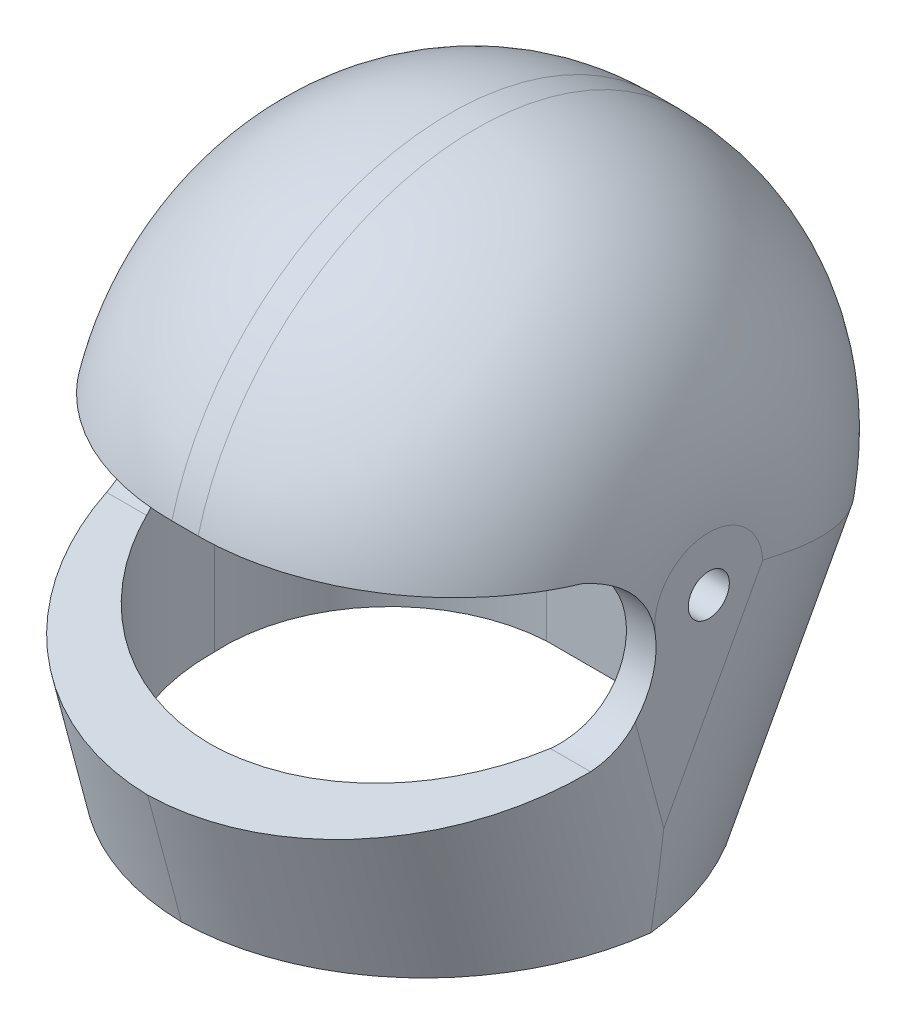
ISO-10303-21;
HEADER;
FILE_DESCRIPTION(('STEP AP214'),'2;1');
FILE_NAME('part.step','',(''),(''),'','','');
FILE_SCHEMA(('AUTOMOTIVE_DESIGN { 1 0 10303 214 1 1 1 1 }'));
ENDSEC;
DATA;
#1=APPLICATION_CONTEXT('core data for automotive mechanical design processes');
#2=APPLICATION_PROTOCOL_DEFINITION('international standard','automotive_design',2000,#1);
#3=PRODUCT_CONTEXT('',#1,'mechanical');
#4=PRODUCT('Part','Part','',(#3));
#5=PRODUCT_RELATED_PRODUCT_CATEGORY('part','',(#4));
#6=PRODUCT_DEFINITION_FORMATION('','',#4);
#7=PRODUCT_DEFINITION_CONTEXT('part definition',#1,'design');
#8=PRODUCT_DEFINITION('design','',#6,#7);
#9=PRODUCT_DEFINITION_SHAPE('','',#8);
#10=(LENGTH_UNIT() NAMED_UNIT(*) SI_UNIT(.MILLI.,.METRE.));
#11=(NAMED_UNIT(*) PLANE_ANGLE_UNIT() SI_UNIT($,.RADIAN.));
#12=(NAMED_UNIT(*) SI_UNIT($,.STERADIAN.) SOLID_ANGLE_UNIT());
#13=UNCERTAINTY_MEASURE_WITH_UNIT(LENGTH_MEASURE(1.E-05),#10,'distance_accuracy_value','');
#14=(GEOMETRIC_REPRESENTATION_CONTEXT(3) GLOBAL_UNCERTAINTY_ASSIGNED_CONTEXT((#13)) GLOBAL_UNIT_ASSIGNED_CONTEXT((#10,
#11,#12)) REPRESENTATION_CONTEXT('',''));
#15=CARTESIAN_POINT('',(0.,0.,0.));
#16=DIRECTION('',(0.,0.,1.));
#17=DIRECTION('',(1.,0.,0.));
#18=AXIS2_PLACEMENT_3D('',#15,#16,#17);
#19=CARTESIAN_POINT('',(4.12003161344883,40.0001338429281,-0.494967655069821));
#20=DIRECTION('',(0.,-1.,0.));
#21=DIRECTION('',(0.,0.,-1.));
#22=AXIS2_PLACEMENT_3D('',#19,#20,#21);
#23=PLANE('',#22);
#24=CARTESIAN_POINT('',(4.12003161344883,40.0001338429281,-0.494967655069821));
#25=DIRECTION('',(0.,-1.,0.));
#26=DIRECTION('',(0.,0.,-1.));
#27=AXIS2_PLACEMENT_3D('',#24,#25,#26);
#28=CIRCLE('',#27,2.5);
#29=CARTESIAN_POINT('',(4.12003161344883,40.0001338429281,-2.99496765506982));
#30=VERTEX_POINT('',#29);
#31=EDGE_CURVE('E450',#30,#30,#28,.T.);
#32=ORIENTED_EDGE('',*,*,#31,.T.);
#33=EDGE_LOOP('',(#32));
#34=FACE_BOUND('',#33,.T.);
#35=ADVANCED_FACE('F19',(#34),#23,.T.);
#36=CARTESIAN_POINT('',(2.86904682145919,38.0001338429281,-1.12548803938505));
#37=DIRECTION('',(0.,-1.,0.));
#38=DIRECTION('',(0.,0.,-1.));
#39=AXIS2_PLACEMENT_3D('',#36,#37,#38);
#40=PLANE('',#39);
#41=CARTESIAN_POINT('',(4.12003161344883,38.0001338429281,-0.494967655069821));
#42=DIRECTION('',(0.,-1.,0.));
#43=DIRECTION('',(0.,0.,-1.));
#44=AXIS2_PLACEMENT_3D('',#41,#42,#43);
#45=CIRCLE('',#44,2.5);
#46=CARTESIAN_POINT('',(4.12003161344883,38.0001338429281,-2.99496765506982));
#47=VERTEX_POINT('',#46);
#48=EDGE_CURVE('E442',#47,#47,#45,.T.);
#49=ORIENTED_EDGE('',*,*,#48,.F.);
#50=EDGE_LOOP('',(#49));
#51=FACE_BOUND('',#50,.T.);
#52=CARTESIAN_POINT('',(2.86904682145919,38.0001338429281,-1.12548803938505));
#53=DIRECTION('',(0.,-1.,0.));
#54=DIRECTION('',(0.,0.,-1.));
#55=AXIS2_PLACEMENT_3D('',#52,#53,#54);
#56=CIRCLE('',#55,4.05291707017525);
#57=CARTESIAN_POINT('',(-1.17723970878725,38.0001338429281,-0.893750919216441));
#58=VERTEX_POINT('',#57);
#59=CARTESIAN_POINT('',(2.64028353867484,38.0001338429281,-5.1719437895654));
#60=VERTEX_POINT('',#59);
#61=EDGE_CURVE('E461',#58,#60,#56,.T.);
#62=ORIENTED_EDGE('',*,*,#61,.T.);
#63=DIRECTION('',(1.,0.,0.));
#64=VECTOR('',#63,1.);
#65=CARTESIAN_POINT('',(2.64028353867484,38.0001338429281,-5.1719437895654));
#66=LINE('',#65,#64);
#67=CARTESIAN_POINT('',(5.60402686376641,38.0001338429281,-5.1719437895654));
#68=VERTEX_POINT('',#67);
#69=EDGE_CURVE('E11',#60,#68,#66,.T.);
#70=ORIENTED_EDGE('',*,*,#69,.T.);
#71=CARTESIAN_POINT('',(5.39699823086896,38.0001338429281,-1.14764202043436));
#72=DIRECTION('',(0.,-1.,0.));
#73=DIRECTION('',(0.,0.,-1.));
#74=AXIS2_PLACEMENT_3D('',#71,#72,#73);
#75=CIRCLE('',#74,4.02962350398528);
#76=CARTESIAN_POINT('',(9.42108292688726,38.0001338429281,-0.936436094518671));
#77=VERTEX_POINT('',#76);
#78=EDGE_CURVE('E464',#68,#77,#75,.T.);
#79=ORIENTED_EDGE('',*,*,#78,.T.);
#80=CARTESIAN_POINT('',(4.05709904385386,38.0001338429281,-0.859139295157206));
#81=DIRECTION('',(0.,-1.,0.));
#82=DIRECTION('',(0.,0.,1.));
#83=AXIS2_PLACEMENT_3D('',#80,#81,#82);
#84=CIRCLE('',#83,5.3645407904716);
#85=CARTESIAN_POINT('',(4.12003161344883,38.0001338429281,4.50503234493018));
#86=VERTEX_POINT('',#85);
#87=EDGE_CURVE('E460',#77,#86,#84,.T.);
#88=ORIENTED_EDGE('',*,*,#87,.T.);
#89=CARTESIAN_POINT('',(4.16334697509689,38.0001338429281,-0.835694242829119));
#90=DIRECTION('',(0.,-1.,0.));
#91=DIRECTION('',(0.,0.,1.));
#92=AXIS2_PLACEMENT_3D('',#89,#90,#91);
#93=CIRCLE('',#92,5.34090223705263);
#94=EDGE_CURVE('E477',#86,#58,#93,.T.);
#95=ORIENTED_EDGE('',*,*,#94,.T.);
#96=EDGE_LOOP('',(#62,#70,#79,#88,#95));
#97=FACE_BOUND('',#96,.T.);
#98=ADVANCED_FACE('F778',(#51,#97),#40,.T.);
#99=CARTESIAN_POINT('',(2.64028353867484,38.0001338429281,-5.1719437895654));
#100=DIRECTION('',(0.,0.,-1.));
#101=DIRECTION('',(0.,-1.,0.));
#102=AXIS2_PLACEMENT_3D('',#99,#100,#101);
#103=PLANE('',#102);
#104=DIRECTION('',(1.,0.,0.));
#105=VECTOR('',#104,1.);
#106=CARTESIAN_POINT('',(2.64028353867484,29.0001338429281,-5.1719437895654));
#107=LINE('',#106,#105);
#108=CARTESIAN_POINT('',(2.64028353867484,29.0001338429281,-5.1719437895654));
#109=VERTEX_POINT('',#108);
#110=CARTESIAN_POINT('',(5.60402686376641,29.0001338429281,-5.1719437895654));
#111=VERTEX_POINT('',#110);
#112=EDGE_CURVE('E257',#109,#111,#107,.T.);
#113=ORIENTED_EDGE('',*,*,#112,.T.);
#114=DIRECTION('',(0.,-1.,0.));
#115=VECTOR('',#114,1.);
#116=CARTESIAN_POINT('',(5.60402686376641,38.0001338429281,-5.1719437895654));
#117=LINE('',#116,#115);
#118=EDGE_CURVE('E32',#68,#111,#117,.T.);
#119=ORIENTED_EDGE('',*,*,#118,.F.);
#120=ORIENTED_EDGE('',*,*,#69,.F.);
#121=DIRECTION('',(0.,-1.,0.));
#122=VECTOR('',#121,1.);
#123=CARTESIAN_POINT('',(2.64028353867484,38.0001338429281,-5.1719437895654));
#124=LINE('',#123,#122);
#125=EDGE_CURVE('E459',#60,#109,#124,.T.);
#126=ORIENTED_EDGE('',*,*,#125,.T.);
#127=EDGE_LOOP('',(#113,#119,#120,#126));
#128=FACE_BOUND('',#127,.T.);
#129=ADVANCED_FACE('F364',(#128),#103,.F.);
#130=CARTESIAN_POINT('',(5.39699823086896,38.0001338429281,-1.14764202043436));
#131=DIRECTION('',(0.,-1.,0.));
#132=DIRECTION('',(0.,0.,-1.));
#133=AXIS2_PLACEMENT_3D('',#130,#131,#132);
#134=CYLINDRICAL_SURFACE('',#133,4.02962350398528);
#135=CARTESIAN_POINT('',(9.30115578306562,35.478898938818,-2.14534908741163));
#136=CARTESIAN_POINT('',(9.30115768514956,35.4871268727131,-2.14534135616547));
#137=CARTESIAN_POINT('',(9.30121125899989,35.4953548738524,-2.1451319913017));
#138=CARTESIAN_POINT('',(9.30142164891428,35.5117501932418,-2.14430830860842));
#139=CARTESIAN_POINT('',(9.3015779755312,35.5199176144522,-2.14369591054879));
#140=CARTESIAN_POINT('',(9.30199333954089,35.5361918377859,-2.14206619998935));
#141=CARTESIAN_POINT('',(9.30225215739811,35.5442987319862,-2.14104975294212));
#142=CARTESIAN_POINT('',(9.30287120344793,35.5604518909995,-2.1386130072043));
#143=CARTESIAN_POINT('',(9.30323148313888,35.5684981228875,-2.13719250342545));
#144=CARTESIAN_POINT('',(9.3040518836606,35.584530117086,-2.13394833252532));
#145=CARTESIAN_POINT('',(9.30451231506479,35.5925156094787,-2.13212341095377));
#146=CARTESIAN_POINT('',(9.30553106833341,35.6084263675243,-2.12807102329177));
#147=CARTESIAN_POINT('',(9.30608993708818,35.6163510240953,-2.12584130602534));
#148=CARTESIAN_POINT('',(9.30730325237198,35.6321405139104,-2.12097985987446));
#149=CARTESIAN_POINT('',(9.30795844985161,35.6400043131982,-2.11834496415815));
#150=CARTESIAN_POINT('',(9.30936184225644,35.655672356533,-2.1126731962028));
#151=CARTESIAN_POINT('',(9.31011095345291,35.6634750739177,-2.10963234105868));
#152=CARTESIAN_POINT('',(9.31167972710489,35.6788336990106,-2.10322829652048));
#153=CARTESIAN_POINT('',(9.31249847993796,35.6863914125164,-2.09986921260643));
#154=CARTESIAN_POINT('',(9.31420421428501,35.7012681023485,-2.09282764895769));
#155=CARTESIAN_POINT('',(9.31509056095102,35.7085885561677,-2.08914814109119));
#156=CARTESIAN_POINT('',(9.31692864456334,35.7229907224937,-2.08146568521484));
#157=CARTESIAN_POINT('',(9.31787994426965,35.73007362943,-2.0774648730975));
#158=CARTESIAN_POINT('',(9.31984478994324,35.7440010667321,-2.06914008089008));
#159=CARTESIAN_POINT('',(9.32085808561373,35.7508464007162,-2.06481738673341));
#160=CARTESIAN_POINT('',(9.32294357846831,35.7642990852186,-2.05584897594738));
#161=CARTESIAN_POINT('',(9.32401569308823,35.7709067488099,-2.0512037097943));
#162=CARTESIAN_POINT('',(9.32621525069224,35.7838846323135,-2.04159030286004));
#163=CARTESIAN_POINT('',(9.32734275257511,35.7902545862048,-2.0366218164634));
#164=CARTESIAN_POINT('',(9.32964933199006,35.8027575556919,-2.02636190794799));
#165=CARTESIAN_POINT('',(9.3308285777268,35.8088896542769,-2.02106940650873));
#166=CARTESIAN_POINT('',(9.33323458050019,35.8209179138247,-2.01016179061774));
#167=CARTESIAN_POINT('',(9.3344615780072,35.8268124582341,-2.00454494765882));
#168=CARTESIAN_POINT('',(9.33693986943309,35.838275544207,-1.99307661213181));
#169=CARTESIAN_POINT('',(9.3381909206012,35.8438461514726,-1.98722713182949));
#170=CARTESIAN_POINT('',(9.34071636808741,35.8546716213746,-1.97528322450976));
#171=CARTESIAN_POINT('',(9.34199067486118,35.8599274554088,-1.96918965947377));
#172=CARTESIAN_POINT('',(9.34455912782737,35.8701243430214,-1.95675807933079));
#173=CARTESIAN_POINT('',(9.34585325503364,35.8750656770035,-1.95042029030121));
#174=CARTESIAN_POINT('',(9.34845784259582,35.884634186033,-1.93750024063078));
#175=CARTESIAN_POINT('',(9.34976832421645,35.8892608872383,-1.93091763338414));
#176=CARTESIAN_POINT('',(9.35240198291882,35.8982009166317,-1.91750798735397));
#177=CARTESIAN_POINT('',(9.35372518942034,35.9025129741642,-1.91068010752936));
#178=CARTESIAN_POINT('',(9.35638056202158,35.9108245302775,-1.89677986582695));
#179=CARTESIAN_POINT('',(9.35771273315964,35.9148219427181,-1.88970625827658));
#180=CARTESIAN_POINT('',(9.36038220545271,35.9225049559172,-1.87531438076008));
#181=CARTESIAN_POINT('',(9.36171945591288,35.9261876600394,-1.86799455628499));
#182=CARTESIAN_POINT('',(9.36439510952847,35.933242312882,-1.85311020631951));
#183=CARTESIAN_POINT('',(9.36573337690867,35.9366105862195,-1.84554391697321));
#184=CARTESIAN_POINT('',(9.36839014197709,35.9429953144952,-1.83026344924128));
#185=CARTESIAN_POINT('',(9.36970864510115,35.9460118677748,-1.82254931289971));
#186=CARTESIAN_POINT('',(9.37230833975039,35.9516449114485,-1.80706306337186));
#187=CARTESIAN_POINT('',(9.37358977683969,35.9542652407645,-1.79929239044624));
#188=CARTESIAN_POINT('',(9.37611441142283,35.9591067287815,-1.78369383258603));
#189=CARTESIAN_POINT('',(9.37735783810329,35.9613310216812,-1.77586695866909));
#190=CARTESIAN_POINT('',(9.37980558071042,35.965381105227,-1.76015651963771));
#191=CARTESIAN_POINT('',(9.38101008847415,35.9672092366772,-1.75227358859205));
#192=CARTESIAN_POINT('',(9.38337912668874,35.9704678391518,-1.73645156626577));
#193=CARTESIAN_POINT('',(9.3845437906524,35.9718997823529,-1.72851279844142));
#194=CARTESIAN_POINT('',(9.38683229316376,35.9743668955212,-1.71257956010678));
#195=CARTESIAN_POINT('',(9.38795618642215,35.9754026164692,-1.70458518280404));
#196=CARTESIAN_POINT('',(9.39016231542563,35.9770782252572,-1.68854109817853));
#197=CARTESIAN_POINT('',(9.39124450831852,35.9777177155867,-1.68049134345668));
#198=CARTESIAN_POINT('',(9.39336641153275,35.9786018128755,-1.66433684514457));
#199=CARTESIAN_POINT('',(9.39440596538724,35.9788450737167,-1.6562320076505));
#200=CARTESIAN_POINT('',(9.39643897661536,35.9789375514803,-1.63998995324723));
#201=CARTESIAN_POINT('',(9.39743228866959,35.9787856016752,-1.63185271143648));
#202=CARTESIAN_POINT('',(9.39936258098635,35.978080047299,-1.6156287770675));
#203=CARTESIAN_POINT('',(9.40029981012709,35.9775283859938,-1.60754203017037));
#204=CARTESIAN_POINT('',(9.40211903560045,35.9760243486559,-1.59141963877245));
#205=CARTESIAN_POINT('',(9.40300116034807,35.9750729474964,-1.58338391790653));
#206=CARTESIAN_POINT('',(9.40471128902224,35.97277042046,-1.56736397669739));
#207=CARTESIAN_POINT('',(9.40553929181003,35.9714192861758,-1.55937975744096));
#208=CARTESIAN_POINT('',(9.4071422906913,35.968318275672,-1.54346311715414));
#209=CARTESIAN_POINT('',(9.40791715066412,35.9665674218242,-1.53553087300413));
#210=CARTESIAN_POINT('',(9.40941497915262,35.9626679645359,-1.51971836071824));
#211=CARTESIAN_POINT('',(9.41013767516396,35.9605174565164,-1.5118385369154));
#212=CARTESIAN_POINT('',(9.41153228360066,35.9558195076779,-1.49613096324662));
#213=CARTESIAN_POINT('',(9.41220378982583,35.9532693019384,-1.48830400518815));
#214=CARTESIAN_POINT('',(9.41349712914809,35.9477731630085,-1.47270208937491));
#215=CARTESIAN_POINT('',(9.41411842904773,35.9448236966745,-1.46492833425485));
#216=CARTESIAN_POINT('',(9.41530932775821,35.9385446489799,-1.44947301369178));
#217=CARTESIAN_POINT('',(9.41587856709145,35.9352127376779,-1.44179236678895));
#218=CARTESIAN_POINT('',(9.4169564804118,35.9282129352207,-1.42667273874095));
#219=CARTESIAN_POINT('',(9.41746569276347,35.9245486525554,-1.41923212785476));
#220=CARTESIAN_POINT('',(9.41842773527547,35.916885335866,-1.40459284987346));
#221=CARTESIAN_POINT('',(9.41888096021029,35.9128890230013,-1.39739278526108));
#222=CARTESIAN_POINT('',(9.41973506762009,35.9045624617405,-1.38323481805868));
#223=CARTESIAN_POINT('',(9.42013620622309,35.9002340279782,-1.37627586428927));
#224=CARTESIAN_POINT('',(9.42089004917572,35.8912441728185,-1.36260014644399));
#225=CARTESIAN_POINT('',(9.42124287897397,35.8865836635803,-1.35588278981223));
#226=CARTESIAN_POINT('',(9.4219038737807,35.8769305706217,-1.34269014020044));
#227=CARTESIAN_POINT('',(9.42221204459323,35.8719380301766,-1.33621481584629));
#228=CARTESIAN_POINT('',(9.42278734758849,35.861621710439,-1.32350598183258));
#229=CARTESIAN_POINT('',(9.4230543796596,35.856297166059,-1.31727308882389));
#230=CARTESIAN_POINT('',(9.42355089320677,35.8453177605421,-1.30504867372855));
#231=CARTESIAN_POINT('',(9.42378018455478,35.8396614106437,-1.29905848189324));
#232=CARTESIAN_POINT('',(9.42420292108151,35.8280628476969,-1.28736380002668));
#233=CARTESIAN_POINT('',(9.4243963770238,35.8221207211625,-1.28165922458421));
#234=CARTESIAN_POINT('',(9.42474976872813,35.8099868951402,-1.27057987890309));
#235=CARTESIAN_POINT('',(9.42490985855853,35.80379650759,-1.26520367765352));
#236=CARTESIAN_POINT('',(9.42520056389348,35.7911670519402,-1.25478058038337));
#237=CARTESIAN_POINT('',(9.42533124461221,35.7847285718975,-1.24973297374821));
#238=CARTESIAN_POINT('',(9.42556691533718,35.7716036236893,-1.23996650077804));
#239=CARTESIAN_POINT('',(9.42567189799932,35.7649170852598,-1.23524772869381));
#240=CARTESIAN_POINT('',(9.42585970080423,35.7512966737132,-1.22613824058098));
#241=CARTESIAN_POINT('',(9.4259424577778,35.744362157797,-1.22174848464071));
#242=CARTESIAN_POINT('',(9.42608908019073,35.7302463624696,-1.21329623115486));
#243=CARTESIAN_POINT('',(9.42615284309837,35.7230639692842,-1.20923559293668));
#244=CARTESIAN_POINT('',(9.42626448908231,35.7084528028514,-1.20144087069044));
#245=CARTESIAN_POINT('',(9.42631224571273,35.70102255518,-1.19770955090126));
#246=CARTESIAN_POINT('',(9.42639464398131,35.685916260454,-1.19057220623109));
#247=CARTESIAN_POINT('',(9.42642914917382,35.6782384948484,-1.18716982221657));
#248=CARTESIAN_POINT('',(9.4264869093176,35.6627999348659,-1.18075903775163));
#249=CARTESIAN_POINT('',(9.42651026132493,35.6550404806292,-1.17774741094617));
#250=CARTESIAN_POINT('',(9.42654830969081,35.6394554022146,-1.17212833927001));
#251=CARTESIAN_POINT('',(9.42656308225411,35.6316310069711,-1.1695174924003));
#252=CARTESIAN_POINT('',(9.42658635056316,35.6159167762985,-1.16469885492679));
#253=CARTESIAN_POINT('',(9.42659488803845,35.6080277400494,-1.162488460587));
#254=CARTESIAN_POINT('',(9.42660768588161,35.592184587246,-1.15847002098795));
#255=CARTESIAN_POINT('',(9.42661196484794,35.5842309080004,-1.15666025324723));
#256=CARTESIAN_POINT('',(9.42661788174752,35.5682588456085,-1.15344215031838));
#257=CARTESIAN_POINT('',(9.42661952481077,35.5602406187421,-1.15203303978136));
#258=CARTESIAN_POINT('',(9.42662143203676,35.5441397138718,-1.1496152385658));
#259=CARTESIAN_POINT('',(9.42662169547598,35.5360570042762,-1.14860675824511));
#260=CARTESIAN_POINT('',(9.42662176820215,35.5198273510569,-1.14698943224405));
#261=CARTESIAN_POINT('',(9.42662157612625,35.5116802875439,-1.14638179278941));
#262=CARTESIAN_POINT('',(9.42662120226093,35.4953218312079,-1.14556435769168));
#263=CARTESIAN_POINT('',(9.42662102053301,35.4871103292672,-1.14535673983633));
#264=CARTESIAN_POINT('',(9.42662108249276,35.4788989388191,-1.14534908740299));
#265=B_SPLINE_CURVE_WITH_KNOTS('',3,(#135,#136,#137,#138,#139,#140,#141,#142,#143,#144,#145,
#146,#147,#148,#149,#150,#151,#152,#153,#154,#155,#156,#157,#158,#159,#160,#161,#162,#163,#164,
#165,#166,#167,#168,#169,#170,#171,#172,#173,#174,#175,#176,#177,#178,#179,#180,#181,#182,#183,
#184,#185,#186,#187,#188,#189,#190,#191,#192,#193,#194,#195,#196,#197,#198,#199,#200,#201,#202,
#203,#204,#205,#206,#207,#208,#209,#210,#211,#212,#213,#214,#215,#216,#217,#218,#219,#220,#221,
#222,#223,#224,#225,#226,#227,#228,#229,#230,#231,#232,#233,#234,#235,#236,#237,#238,#239,#240,
#241,#242,#243,#244,#245,#246,#247,#248,#249,#250,#251,#252,#253,#254,#255,#256,#257,#258,#259,
#260,#261,#262,#263,#264),.UNSPECIFIED.,.F.,.F.,(4,2,2,2,2,2,2,2,2,2,2,2,2,2,2,2,2,2,2,2,2,2,2,
2,2,2,2,2,2,2,2,2,2,2,2,2,2,2,2,2,2,2,2,2,2,2,2,2,2,2,2,2,2,2,2,2,2,2,2,2,2,2,2,2,4),(0.,
0.024681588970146,0.0492464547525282,0.0737589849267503,0.0982839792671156,0.122886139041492,
0.147629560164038,0.172577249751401,0.197790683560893,0.222714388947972,0.247427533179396,
0.271988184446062,0.296455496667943,0.320889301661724,0.345349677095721,0.369896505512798,
0.394589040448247,0.419101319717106,0.443533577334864,0.467943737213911,0.492389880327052,
0.516929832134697,0.541620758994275,0.566518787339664,0.591678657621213,0.61683147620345,
0.641722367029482,0.666406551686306,0.690940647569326,0.715382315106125,0.739789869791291,
0.764221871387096,0.788736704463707,0.813323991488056,0.837792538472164,0.862201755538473,
0.886611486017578,0.91108156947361,0.93567140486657,0.960439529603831,0.985443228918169,
1.01060826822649,1.03552694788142,1.06025845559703,1.08486332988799,1.10940304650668,
1.13393957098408,1.15853489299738,1.18325055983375,1.20795879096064,1.23255027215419,
1.25708667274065,1.28163007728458,1.30624251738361,1.33098550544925,1.35591958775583,
1.38110393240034,1.40606493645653,1.43080069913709,1.45536935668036,1.4798302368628,
1.50424345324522,1.52866947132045,1.55316866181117,1.57780085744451),.UNSPECIFIED.);
#266=CARTESIAN_POINT('',(9.30115578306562,35.4788989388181,-2.14534908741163));
#267=VERTEX_POINT('',#266);
#268=CARTESIAN_POINT('',(9.42662108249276,35.4788989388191,-1.14534908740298));
#269=VERTEX_POINT('',#268);
#270=EDGE_CURVE('E387',#267,#269,#265,.T.);
#271=ORIENTED_EDGE('',*,*,#270,.T.);
#272=CARTESIAN_POINT('',(9.42662108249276,35.4788989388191,-1.14534908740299));
#273=CARTESIAN_POINT('',(9.4266210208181,35.4707115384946,-1.14535792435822));
#274=CARTESIAN_POINT('',(9.42662120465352,35.4625241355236,-1.14556842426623));
#275=CARTESIAN_POINT('',(9.4266215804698,35.4462042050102,-1.14639397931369));
#276=CARTESIAN_POINT('',(9.42662177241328,35.438071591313,-1.14700733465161));
#277=CARTESIAN_POINT('',(9.42662168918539,35.4218611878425,-1.14863844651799));
#278=CARTESIAN_POINT('',(9.42662141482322,35.4137833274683,-1.14965550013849));
#279=CARTESIAN_POINT('',(9.42661946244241,35.3976824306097,-1.15209277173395));
#280=CARTESIAN_POINT('',(9.42661778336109,35.3896594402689,-1.1535132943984));
#281=CARTESIAN_POINT('',(9.426611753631,35.3736681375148,-1.15675654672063));
#282=CARTESIAN_POINT('',(9.4266073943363,35.3657000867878,-1.15858056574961));
#283=CARTESIAN_POINT('',(9.4265943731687,35.3498184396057,-1.16262981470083));
#284=CARTESIAN_POINT('',(9.42658568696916,35.3419054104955,-1.16485726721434));
#285=CARTESIAN_POINT('',(9.42656203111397,35.3261334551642,-1.16971243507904));
#286=CARTESIAN_POINT('',(9.42654701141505,35.3182754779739,-1.17234322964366));
#287=CARTESIAN_POINT('',(9.42650834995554,35.3026133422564,-1.17800430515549));
#288=CARTESIAN_POINT('',(9.42648462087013,35.2948105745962,-1.18103842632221));
#289=CARTESIAN_POINT('',(9.42642617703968,35.2793383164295,-1.18747168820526));
#290=CARTESIAN_POINT('',(9.42639143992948,35.2716691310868,-1.19087156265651));
#291=CARTESIAN_POINT('',(9.42630864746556,35.2565840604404,-1.19799779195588));
#292=CARTESIAN_POINT('',(9.42626073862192,35.2491663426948,-1.20172026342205));
#293=CARTESIAN_POINT('',(9.42614891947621,35.234584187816,-1.20949088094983));
#294=CARTESIAN_POINT('',(9.42608514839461,35.2274181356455,-1.21353599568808));
#295=CARTESIAN_POINT('',(9.42593870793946,35.2133390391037,-1.22195091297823));
#296=CARTESIAN_POINT('',(9.42585615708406,35.2064247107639,-1.22631856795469));
#297=CARTESIAN_POINT('',(9.42566904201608,35.1928487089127,-1.23537755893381));
#298=CARTESIAN_POINT('',(9.42556456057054,35.1861861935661,-1.24006763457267));
#299=CARTESIAN_POINT('',(9.42533025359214,35.173113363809,-1.24977044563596));
#300=CARTESIAN_POINT('',(9.42520045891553,35.1667027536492,-1.25478278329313));
#301=CARTESIAN_POINT('',(9.42491198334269,35.154133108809,-1.26512904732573));
#302=CARTESIAN_POINT('',(9.42475326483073,35.1479744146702,-1.27046338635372));
#303=CARTESIAN_POINT('',(9.42440317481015,35.1359081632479,-1.28145281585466));
#304=CARTESIAN_POINT('',(9.42421168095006,35.1300016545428,-1.28710905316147));
#305=CARTESIAN_POINT('',(9.42379346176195,35.1184757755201,-1.29870295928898));
#306=CARTESIAN_POINT('',(9.4235667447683,35.1128563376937,-1.30464056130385));
#307=CARTESIAN_POINT('',(9.42307578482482,35.101943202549,-1.31676254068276));
#308=CARTESIAN_POINT('',(9.42281169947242,35.096648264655,-1.32294580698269));
#309=CARTESIAN_POINT('',(9.42224267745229,35.0863836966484,-1.33555825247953));
#310=CARTESIAN_POINT('',(9.42193780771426,35.0814135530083,-1.34198701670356));
#311=CARTESIAN_POINT('',(9.42128378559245,35.0717977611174,-1.35508940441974));
#312=CARTESIAN_POINT('',(9.42093459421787,35.0671524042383,-1.36176323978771));
#313=CARTESIAN_POINT('',(9.42018837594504,35.0581853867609,-1.37535481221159));
#314=CARTESIAN_POINT('',(9.41979119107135,35.0538648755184,-1.38227329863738));
#315=CARTESIAN_POINT('',(9.41894531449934,35.0455466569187,-1.3963532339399));
#316=CARTESIAN_POINT('',(9.41849633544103,35.0415509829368,-1.40351586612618));
#317=CARTESIAN_POINT('',(9.41754307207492,35.0338816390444,-1.41808328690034));
#318=CARTESIAN_POINT('',(9.41703836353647,35.0302108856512,-1.42548958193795));
#319=CARTESIAN_POINT('',(9.41596973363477,35.0231901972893,-1.44054332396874));
#320=CARTESIAN_POINT('',(9.41540524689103,35.0198440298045,-1.44819248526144));
#321=CARTESIAN_POINT('',(9.41421991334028,35.0135099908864,-1.46364143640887));
#322=CARTESIAN_POINT('',(9.41359901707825,35.0105224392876,-1.47144135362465));
#323=CARTESIAN_POINT('',(9.41230586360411,35.0049545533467,-1.48709941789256));
#324=CARTESIAN_POINT('',(9.41163413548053,35.0023707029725,-1.4949563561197));
#325=CARTESIAN_POINT('',(9.41023841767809,34.9976091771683,-1.51072743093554));
#326=CARTESIAN_POINT('',(9.40951482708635,34.9954287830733,-1.51864078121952));
#327=CARTESIAN_POINT('',(9.40801447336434,34.9914734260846,-1.53452393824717));
#328=CARTESIAN_POINT('',(9.40723797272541,34.9896966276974,-1.54249331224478));
#329=CARTESIAN_POINT('',(9.40563089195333,34.9865475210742,-1.55848776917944));
#330=CARTESIAN_POINT('',(9.40480043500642,34.985174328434,-1.56651269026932));
#331=CARTESIAN_POINT('',(9.40308453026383,34.9828314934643,-1.58261758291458));
#332=CARTESIAN_POINT('',(9.40219906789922,34.9818619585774,-1.59069756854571));
#333=CARTESIAN_POINT('',(9.40037223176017,34.9803253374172,-1.6069120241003));
#334=CARTESIAN_POINT('',(9.39943071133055,34.9797593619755,-1.6150465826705));
#335=CARTESIAN_POINT('',(9.39749083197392,34.9790292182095,-1.63136966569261));
#336=CARTESIAN_POINT('',(9.39649220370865,34.9788671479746,-1.6395582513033));
#337=CARTESIAN_POINT('',(9.39444827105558,34.9789420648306,-1.65590016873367));
#338=CARTESIAN_POINT('',(9.39340313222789,34.9791777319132,-1.66405352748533));
#339=CARTESIAN_POINT('',(9.39127023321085,34.9800482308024,-1.68029912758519));
#340=CARTESIAN_POINT('',(9.39018266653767,34.9806814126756,-1.68839148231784));
#341=CARTESIAN_POINT('',(9.38796608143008,34.9823463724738,-1.70451480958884));
#342=CARTESIAN_POINT('',(9.38683713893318,34.9833774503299,-1.71254586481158));
#343=CARTESIAN_POINT('',(9.38453894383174,34.9858371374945,-1.72854650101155));
#344=CARTESIAN_POINT('',(9.38336966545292,34.9872660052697,-1.7365160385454));
#345=CARTESIAN_POINT('',(9.38099191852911,34.9905203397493,-1.75239363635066));
#346=CARTESIAN_POINT('',(9.37978334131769,34.9923470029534,-1.76030143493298));
#347=CARTESIAN_POINT('',(9.3773280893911,34.9963959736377,-1.77605566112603));
#348=CARTESIAN_POINT('',(9.37608124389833,34.9986203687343,-1.78390152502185));
#349=CARTESIAN_POINT('',(9.37355052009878,35.0034639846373,-1.79953207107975));
#350=CARTESIAN_POINT('',(9.37226643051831,35.0060861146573,-1.80731581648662));
#351=CARTESIAN_POINT('',(9.36966225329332,35.0117241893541,-1.82282242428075));
#352=CARTESIAN_POINT('',(9.36834193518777,35.0147437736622,-1.83054392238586));
#353=CARTESIAN_POINT('',(9.36569184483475,35.0211154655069,-1.84577948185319));
#354=CARTESIAN_POINT('',(9.3643622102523,35.0244650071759,-1.85329464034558));
#355=CARTESIAN_POINT('',(9.36170259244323,35.0314869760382,-1.86808693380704));
#356=CARTESIAN_POINT('',(9.36037272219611,35.0351561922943,-1.87536561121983));
#357=CARTESIAN_POINT('',(9.35771654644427,35.0428165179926,-1.88968559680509));
#358=CARTESIAN_POINT('',(9.35639028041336,35.0468052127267,-1.89672820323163));
#359=CARTESIAN_POINT('',(9.35374507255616,35.0551037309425,-1.9105768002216));
#360=CARTESIAN_POINT('',(9.35242612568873,35.0594119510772,-1.91738375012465));
#361=CARTESIAN_POINT('',(9.3497991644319,35.0683486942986,-1.9307618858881));
#362=CARTESIAN_POINT('',(9.3484911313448,35.0729764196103,-1.93733360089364));
#363=CARTESIAN_POINT('',(9.34588943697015,35.0825513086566,-1.95024228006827));
#364=CARTESIAN_POINT('',(9.34459577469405,35.0874984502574,-1.95657926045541));
#365=CARTESIAN_POINT('',(9.34202615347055,35.0977116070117,-1.96901934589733));
#366=CARTESIAN_POINT('',(9.34075024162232,35.1029783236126,-1.97512188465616));
#367=CARTESIAN_POINT('',(9.33821911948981,35.1138291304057,-1.98709488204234));
#368=CARTESIAN_POINT('',(9.3369640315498,35.119414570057,-1.99296414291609));
#369=CARTESIAN_POINT('',(9.33448341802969,35.1308804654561,-2.00444453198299));
#370=CARTESIAN_POINT('',(9.33325797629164,35.1367616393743,-2.01005496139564));
#371=CARTESIAN_POINT('',(9.3308547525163,35.1487678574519,-2.02095148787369));
#372=CARTESIAN_POINT('',(9.32967674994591,35.1548914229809,-2.02623916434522));
#373=CARTESIAN_POINT('',(9.32737205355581,35.167380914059,-2.03649224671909));
#374=CARTESIAN_POINT('',(9.32624521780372,35.1737460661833,-2.04145856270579));
#375=CARTESIAN_POINT('',(9.32404641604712,35.1867182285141,-2.05107017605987));
#376=CARTESIAN_POINT('',(9.32297442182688,35.1933251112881,-2.05571563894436));
#377=CARTESIAN_POINT('',(9.32088854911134,35.2067800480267,-2.06468706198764));
#378=CARTESIAN_POINT('',(9.31987478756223,35.2136285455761,-2.06901238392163));
#379=CARTESIAN_POINT('',(9.31790836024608,35.2275661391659,-2.07734506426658));
#380=CARTESIAN_POINT('',(9.31695598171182,35.2346561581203,-2.08135094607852));
#381=CARTESIAN_POINT('',(9.31511509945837,35.249076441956,-2.08904605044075));
#382=CARTESIAN_POINT('',(9.31422707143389,35.2564080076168,-2.09273294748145));
#383=CARTESIAN_POINT('',(9.31251720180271,35.2713106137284,-2.09979226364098));
#384=CARTESIAN_POINT('',(9.31169603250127,35.2788832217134,-2.10316153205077));
#385=CARTESIAN_POINT('',(9.31012412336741,35.2942561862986,-2.10957877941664));
#386=CARTESIAN_POINT('',(9.30937412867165,35.3020580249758,-2.11262339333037));
#387=CARTESIAN_POINT('',(9.30796911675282,35.3177254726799,-2.11830199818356));
#388=CARTESIAN_POINT('',(9.30731318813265,35.3255895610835,-2.12093995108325));
#389=CARTESIAN_POINT('',(9.30609844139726,35.3413805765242,-2.12580732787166));
#390=CARTESIAN_POINT('',(9.30553887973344,35.3493064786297,-2.12803988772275));
#391=CARTESIAN_POINT('',(9.30451880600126,35.3652207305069,-2.13209765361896));
#392=CARTESIAN_POINT('',(9.30405775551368,35.3732084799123,-2.13392507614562));
#393=CARTESIAN_POINT('',(9.3032361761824,35.3892459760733,-2.13717398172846));
#394=CARTESIAN_POINT('',(9.3028753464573,35.397295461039,-2.1385966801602));
#395=CARTESIAN_POINT('',(9.30225526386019,35.4134561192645,-2.14103754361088));
#396=CARTESIAN_POINT('',(9.3019959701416,35.4215672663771,-2.14205587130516));
#397=CARTESIAN_POINT('',(9.30157971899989,35.4378509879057,-2.14368907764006));
#398=CARTESIAN_POINT('',(9.30142299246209,35.4460236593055,-2.14430304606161));
#399=CARTESIAN_POINT('',(9.30121186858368,35.4624304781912,-2.14512960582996));
#400=CARTESIAN_POINT('',(9.30115797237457,35.4706647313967,-2.1453402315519));
#401=CARTESIAN_POINT('',(9.30115578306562,35.478898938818,-2.14534908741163));
#402=B_SPLINE_CURVE_WITH_KNOTS('',3,(#272,#273,#274,#275,#276,#277,#278,#279,#280,#281,#282,
#283,#284,#285,#286,#287,#288,#289,#290,#291,#292,#293,#294,#295,#296,#297,#298,#299,#300,#301,
#302,#303,#304,#305,#306,#307,#308,#309,#310,#311,#312,#313,#314,#315,#316,#317,#318,#319,#320,
#321,#322,#323,#324,#325,#326,#327,#328,#329,#330,#331,#332,#333,#334,#335,#336,#337,#338,#339,
#340,#341,#342,#343,#344,#345,#346,#347,#348,#349,#350,#351,#352,#353,#354,#355,#356,#357,#358,
#359,#360,#361,#362,#363,#364,#365,#366,#367,#368,#369,#370,#371,#372,#373,#374,#375,#376,#377,
#378,#379,#380,#381,#382,#383,#384,#385,#386,#387,#388,#389,#390,#391,#392,#393,#394,#395,#396,
#397,#398,#399,#400,#401),.UNSPECIFIED.,.F.,.F.,(4,2,2,2,2,2,2,2,2,2,2,2,2,2,2,2,2,2,2,2,2,2,2,
2,2,2,2,2,2,2,2,2,2,2,2,2,2,2,2,2,2,2,2,2,2,2,2,2,2,2,2,2,2,2,2,2,2,2,2,2,2,2,2,2,4),(0.,
0.0245600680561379,0.0490171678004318,0.0734318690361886,0.097865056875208,0.122377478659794,
0.147029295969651,0.171879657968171,0.196986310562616,0.222144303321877,0.247033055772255,
0.271710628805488,0.296236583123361,0.320671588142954,0.345076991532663,0.369514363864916,
0.394045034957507,0.41856991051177,0.442994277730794,0.467379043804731,0.491785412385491,
0.516274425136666,0.540906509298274,0.565741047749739,0.590835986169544,0.615953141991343,
0.640837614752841,0.665547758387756,0.690143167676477,0.714684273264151,0.739231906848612,
0.76384685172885,0.788589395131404,0.813249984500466,0.837808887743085,0.862324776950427,
0.886856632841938,0.911463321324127,0.936203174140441,0.961133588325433,0.986310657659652,
1.01130543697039,1.03607306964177,1.06066854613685,1.08514801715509,1.10956843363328,
1.1339871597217,1.15846157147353,1.18304865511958,1.20769863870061,1.23221629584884,
1.25666117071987,1.28109333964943,1.30557297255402,1.33015989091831,1.35491313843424,
1.37989057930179,1.40510587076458,1.43005741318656,1.45480685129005,1.47941734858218,
1.50395314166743,1.52847905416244,1.55305998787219,1.57776041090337),.UNSPECIFIED.);
#403=EDGE_CURVE('E416',#269,#267,#402,.T.);
#404=ORIENTED_EDGE('',*,*,#403,.T.);
#405=EDGE_LOOP('',(#271,#404));
#406=FACE_BOUND('',#405,.T.);
#407=CARTESIAN_POINT('',(5.39699823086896,29.0001338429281,-1.14764202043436));
#408=DIRECTION('',(0.,-1.,0.));
#409=DIRECTION('',(0.,0.,-1.));
#410=AXIS2_PLACEMENT_3D('',#407,#408,#409);
#411=CIRCLE('',#410,4.02962350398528);
#412=CARTESIAN_POINT('',(9.42108292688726,29.0001338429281,-0.936436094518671));
#413=VERTEX_POINT('',#412);
#414=EDGE_CURVE('E730',#111,#413,#411,.T.);
#415=ORIENTED_EDGE('',*,*,#414,.T.);
#416=DIRECTION('',(0.,-1.,0.));
#417=VECTOR('',#416,1.);
#418=CARTESIAN_POINT('',(9.42108292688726,38.0001338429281,-0.936436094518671));
#419=LINE('',#418,#417);
#420=EDGE_CURVE('E456',#77,#413,#419,.T.);
#421=ORIENTED_EDGE('',*,*,#420,.F.);
#422=ORIENTED_EDGE('',*,*,#78,.F.);
#423=ORIENTED_EDGE('',*,*,#118,.T.);
#424=EDGE_LOOP('',(#415,#421,#422,#423));
#425=FACE_BOUND('',#424,.T.);
#426=ADVANCED_FACE('F361',(#406,#425),#134,.F.);
#427=CARTESIAN_POINT('',(2.86904682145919,38.0001338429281,-1.12548803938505));
#428=DIRECTION('',(0.,-1.,0.));
#429=DIRECTION('',(0.,0.,-1.));
#430=AXIS2_PLACEMENT_3D('',#427,#428,#429);
#431=CYLINDRICAL_SURFACE('',#430,4.05291707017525);
#432=CARTESIAN_POINT('',(-1.05345495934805,35.478898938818,-2.14534908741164));
#433=CARTESIAN_POINT('',(-1.05345687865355,35.4706696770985,-2.14534142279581));
#434=CARTESIAN_POINT('',(-1.05351139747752,35.4624403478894,-2.14513200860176));
#435=CARTESIAN_POINT('',(-1.05372553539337,35.4460422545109,-2.14430801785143));
#436=CARTESIAN_POINT('',(-1.05388465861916,35.4378733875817,-2.14369535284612));
#437=CARTESIAN_POINT('',(-1.0543074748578,35.4215961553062,-2.14206489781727));
#438=CARTESIAN_POINT('',(-1.05457094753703,35.4134876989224,-2.14104796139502));
#439=CARTESIAN_POINT('',(-1.05520115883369,35.3973312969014,-2.13861002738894));
#440=CARTESIAN_POINT('',(-1.05556795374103,35.3892833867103,-2.13718880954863));
#441=CARTESIAN_POINT('',(-1.05640323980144,35.3732479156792,-2.13394299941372));
#442=CARTESIAN_POINT('',(-1.05687205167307,35.365260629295,-2.13211713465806));
#443=CARTESIAN_POINT('',(-1.05790942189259,35.3493461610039,-2.12806264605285));
#444=CARTESIAN_POINT('',(-1.05847854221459,35.3414195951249,-2.12583175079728));
#445=CARTESIAN_POINT('',(-1.05971421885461,35.325626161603,-2.12096772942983));
#446=CARTESIAN_POINT('',(-1.06038154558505,35.3177603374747,-2.11833141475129));
#447=CARTESIAN_POINT('',(-1.06181106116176,35.302088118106,-2.11265657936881));
#448=CARTESIAN_POINT('',(-1.06257418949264,35.2942832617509,-2.10961405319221));
#449=CARTESIAN_POINT('',(-1.06417225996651,35.2789225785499,-2.10320744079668));
#450=CARTESIAN_POINT('',(-1.06500625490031,35.2713649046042,-2.09984754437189));
#451=CARTESIAN_POINT('',(-1.06674391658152,35.2564883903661,-2.09280447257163));
#452=CARTESIAN_POINT('',(-1.06764693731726,35.2491680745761,-2.08912425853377));
#453=CARTESIAN_POINT('',(-1.06951982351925,35.2347662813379,-2.08144049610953));
#454=CARTESIAN_POINT('',(-1.07048924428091,35.2276836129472,-2.07743907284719));
#455=CARTESIAN_POINT('',(-1.0724917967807,35.2137567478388,-2.0691131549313));
#456=CARTESIAN_POINT('',(-1.073524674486,35.2069117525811,-2.06478993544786));
#457=CARTESIAN_POINT('',(-1.07565080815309,35.1934598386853,-2.05582055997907));
#458=CARTESIAN_POINT('',(-1.0767439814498,35.186852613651,-2.05117484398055));
#459=CARTESIAN_POINT('',(-1.07898714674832,35.1738757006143,-2.04156060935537));
#460=CARTESIAN_POINT('',(-1.08013720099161,35.1675062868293,-2.03659173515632));
#461=CARTESIAN_POINT('',(-1.08249038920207,35.1550044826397,-2.02633111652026));
#462=CARTESIAN_POINT('',(-1.08369369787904,35.1488730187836,-2.02103828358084));
#463=CARTESIAN_POINT('',(-1.08614935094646,35.1368461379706,-2.01013002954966));
#464=CARTESIAN_POINT('',(-1.08740194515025,35.1309523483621,-2.00451287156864));
#465=CARTESIAN_POINT('',(-1.08993230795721,35.1194918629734,-1.99304510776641));
#466=CARTESIAN_POINT('',(-1.09120981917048,35.1139230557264,-1.98719655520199));
#467=CARTESIAN_POINT('',(-1.09378932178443,35.1031010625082,-1.97525486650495));
#468=CARTESIAN_POINT('',(-1.09509122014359,35.0978469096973,-1.96916258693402));
#469=CARTESIAN_POINT('',(-1.09771601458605,35.0876532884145,-1.95673390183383));
#470=CARTESIAN_POINT('',(-1.09903889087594,35.0827135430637,-1.95039771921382));
#471=CARTESIAN_POINT('',(-1.10170215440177,35.0731481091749,-1.93748119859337));
#472=CARTESIAN_POINT('',(-1.10304256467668,35.0685228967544,-1.93090051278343));
#473=CARTESIAN_POINT('',(-1.10573728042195,35.0595857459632,-1.91749500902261));
#474=CARTESIAN_POINT('',(-1.10709161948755,35.0552750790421,-1.91066935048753));
#475=CARTESIAN_POINT('',(-1.10981047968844,35.0469662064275,-1.89677383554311));
#476=CARTESIAN_POINT('',(-1.11117501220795,35.0429700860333,-1.88970273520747));
#477=CARTESIAN_POINT('',(-1.1139104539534,35.0352895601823,-1.875316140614));
#478=CARTESIAN_POINT('',(-1.11528132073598,35.031608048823,-1.86799909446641));
#479=CARTESIAN_POINT('',(-1.11802547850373,35.024555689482,-1.85312055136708));
#480=CARTESIAN_POINT('',(-1.11939864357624,35.0211885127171,-1.84555729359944));
#481=CARTESIAN_POINT('',(-1.12212600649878,35.0148059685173,-1.83028334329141));
#482=CARTESIAN_POINT('',(-1.12348021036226,35.0117904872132,-1.82257269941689));
#483=CARTESIAN_POINT('',(-1.12615180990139,35.0061592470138,-1.80709328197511));
#484=CARTESIAN_POINT('',(-1.12746944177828,35.0035396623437,-1.79932594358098));
#485=CARTESIAN_POINT('',(-1.13006697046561,34.9986993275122,-1.78373389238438));
#486=CARTESIAN_POINT('',(-1.13134708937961,34.9964754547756,-1.77591018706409));
#487=CARTESIAN_POINT('',(-1.13386872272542,34.9924258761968,-1.76020591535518));
#488=CARTESIAN_POINT('',(-1.13511042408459,34.990597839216,-1.75232598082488));
#489=CARTESIAN_POINT('',(-1.13755435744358,34.9873390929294,-1.73650977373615));
#490=CARTESIAN_POINT('',(-1.13875672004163,34.9859069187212,-1.72857382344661));
#491=CARTESIAN_POINT('',(-1.14112112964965,34.9834390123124,-1.71264603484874));
#492=CARTESIAN_POINT('',(-1.142283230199,34.9824027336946,-1.70465428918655));
#493=CARTESIAN_POINT('',(-1.14456628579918,34.9807256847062,-1.68861527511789));
#494=CARTESIAN_POINT('',(-1.14568719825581,34.9800853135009,-1.68056795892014));
#495=CARTESIAN_POINT('',(-1.14788705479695,34.9791991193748,-1.66441813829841));
#496=CARTESIAN_POINT('',(-1.14896584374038,34.9789546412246,-1.65631553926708));
#497=CARTESIAN_POINT('',(-1.15107782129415,34.9788594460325,-1.6400770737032));
#498=CARTESIAN_POINT('',(-1.15211086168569,34.9790099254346,-1.63194118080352));
#499=CARTESIAN_POINT('',(-1.15412058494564,34.9797124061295,-1.61571988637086));
#500=CARTESIAN_POINT('',(-1.15509751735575,34.9802624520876,-1.60763443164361));
#501=CARTESIAN_POINT('',(-1.15699611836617,34.9817631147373,-1.59151456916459));
#502=CARTESIAN_POINT('',(-1.15791791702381,34.9827127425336,-1.58348008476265));
#503=CARTESIAN_POINT('',(-1.15970735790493,34.9850115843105,-1.56746256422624));
#504=CARTESIAN_POINT('',(-1.16057500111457,34.9863607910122,-1.55947952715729));
#505=CARTESIAN_POINT('',(-1.16225724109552,34.9894578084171,-1.54356520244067));
#506=CARTESIAN_POINT('',(-1.16307170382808,34.9912065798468,-1.53563408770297));
#507=CARTESIAN_POINT('',(-1.16464869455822,34.99510173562,-1.51982378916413));
#508=CARTESIAN_POINT('',(-1.16541095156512,34.9972500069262,-1.51194504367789));
#509=CARTESIAN_POINT('',(-1.16688463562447,35.0019433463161,-1.49623958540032));
#510=CARTESIAN_POINT('',(-1.16759565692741,35.0044911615,-1.48841365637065));
#511=CARTESIAN_POINT('',(-1.16896797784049,35.0099823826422,-1.47281376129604));
#512=CARTESIAN_POINT('',(-1.1696287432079,35.0129293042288,-1.46504098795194));
#513=CARTESIAN_POINT('',(-1.17089846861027,35.0192038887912,-1.4495857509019));
#514=CARTESIAN_POINT('',(-1.17150705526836,35.0225339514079,-1.44190423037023));
#515=CARTESIAN_POINT('',(-1.17266262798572,35.029530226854,-1.42678265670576));
#516=CARTESIAN_POINT('',(-1.17321015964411,35.0331928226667,-1.41934097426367));
#517=CARTESIAN_POINT('',(-1.17424778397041,35.0408529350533,-1.40469937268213));
#518=CARTESIAN_POINT('',(-1.17473827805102,35.0448477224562,-1.39749805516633));
#519=CARTESIAN_POINT('',(-1.17566584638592,35.0531714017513,-1.38333741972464));
#520=CARTESIAN_POINT('',(-1.17610318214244,35.0574984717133,-1.37637704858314));
#521=CARTESIAN_POINT('',(-1.17692832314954,35.0664857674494,-1.36269835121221));
#522=CARTESIAN_POINT('',(-1.17731625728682,35.0711450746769,-1.35597942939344));
#523=CARTESIAN_POINT('',(-1.17804634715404,35.0807959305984,-1.34278352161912));
#524=CARTESIAN_POINT('',(-1.17838850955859,35.0857874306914,-1.33630650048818));
#525=CARTESIAN_POINT('',(-1.17903066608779,35.0961018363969,-1.323594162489));
#526=CARTESIAN_POINT('',(-1.17933055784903,35.1014255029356,-1.31735945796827));
#527=CARTESIAN_POINT('',(-1.17989164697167,35.1124033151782,-1.3051313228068));
#528=CARTESIAN_POINT('',(-1.18015264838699,35.1180589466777,-1.29913921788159));
#529=CARTESIAN_POINT('',(-1.1806374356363,35.1296568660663,-1.28744003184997));
#530=CARTESIAN_POINT('',(-1.18086122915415,35.135599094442,-1.2817328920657));
#531=CARTESIAN_POINT('',(-1.18127364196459,35.1477333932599,-1.27064844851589));
#532=CARTESIAN_POINT('',(-1.18146242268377,35.1539241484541,-1.2652697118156));
#533=CARTESIAN_POINT('',(-1.18180884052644,35.1665546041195,-1.25484159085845));
#534=CARTESIAN_POINT('',(-1.18196654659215,35.1729937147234,-1.24979149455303));
#535=CARTESIAN_POINT('',(-1.18225458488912,35.1861201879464,-1.24002010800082));
#536=CARTESIAN_POINT('',(-1.18238490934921,35.1928076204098,-1.23529891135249));
#537=CARTESIAN_POINT('',(-1.18262170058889,35.2064300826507,-1.22618465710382));
#538=CARTESIAN_POINT('',(-1.18272809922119,35.2133657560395,-1.22179255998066));
#539=CARTESIAN_POINT('',(-1.18292029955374,35.2274841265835,-1.21333571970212));
#540=CARTESIAN_POINT('',(-1.18300598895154,35.234667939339,-1.20927283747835));
#541=CARTESIAN_POINT('',(-1.18315977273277,35.2492822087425,-1.20147374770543));
#542=CARTESIAN_POINT('',(-1.18322772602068,35.2567141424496,-1.19774030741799));
#543=CARTESIAN_POINT('',(-1.18334879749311,35.271824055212,-1.19059881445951));
#544=CARTESIAN_POINT('',(-1.18340175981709,35.279503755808,-1.18719440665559));
#545=CARTESIAN_POINT('',(-1.18349431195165,35.2949437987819,-1.18078097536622));
#546=CARTESIAN_POINT('',(-1.18353402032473,35.3027027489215,-1.1777686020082));
#547=CARTESIAN_POINT('',(-1.18360261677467,35.3182876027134,-1.17214795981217));
#548=CARTESIAN_POINT('',(-1.183631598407,35.3261122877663,-1.16953631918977));
#549=CARTESIAN_POINT('',(-1.18368111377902,35.3418278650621,-1.16471598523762));
#550=CARTESIAN_POINT('',(-1.18370170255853,35.3497179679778,-1.16250472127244));
#551=CARTESIAN_POINT('',(-1.18373642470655,35.3655640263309,-1.1584844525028));
#552=CARTESIAN_POINT('',(-1.18375058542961,35.3735195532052,-1.15667376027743));
#553=CARTESIAN_POINT('',(-1.1837740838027,35.3894960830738,-1.15345372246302));
#554=CARTESIAN_POINT('',(-1.18378343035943,35.3975169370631,-1.15204363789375));
#555=CARTESIAN_POINT('',(-1.18379856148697,35.4136238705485,-1.14962380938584));
#556=CARTESIAN_POINT('',(-1.18380434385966,35.4217099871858,-1.14861431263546));
#557=CARTESIAN_POINT('',(-1.18381327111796,35.4379472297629,-1.14699487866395));
#558=CARTESIAN_POINT('',(-1.18381640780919,35.4460984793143,-1.14638618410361));
#559=CARTESIAN_POINT('',(-1.18382051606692,35.4624660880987,-1.14556656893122));
#560=CARTESIAN_POINT('',(-1.18382147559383,35.4706825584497,-1.14535786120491));
#561=CARTESIAN_POINT('',(-1.18382158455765,35.478898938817,-1.14534908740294));
#562=B_SPLINE_CURVE_WITH_KNOTS('',3,(#432,#433,#434,#435,#436,#437,#438,#439,#440,#441,#442,
#443,#444,#445,#446,#447,#448,#449,#450,#451,#452,#453,#454,#455,#456,#457,#458,#459,#460,#461,
#462,#463,#464,#465,#466,#467,#468,#469,#470,#471,#472,#473,#474,#475,#476,#477,#478,#479,#480,
#481,#482,#483,#484,#485,#486,#487,#488,#489,#490,#491,#492,#493,#494,#495,#496,#497,#498,#499,
#500,#501,#502,#503,#504,#505,#506,#507,#508,#509,#510,#511,#512,#513,#514,#515,#516,#517,#518,
#519,#520,#521,#522,#523,#524,#525,#526,#527,#528,#529,#530,#531,#532,#533,#534,#535,#536,#537,
#538,#539,#540,#541,#542,#543,#544,#545,#546,#547,#548,#549,#550,#551,#552,#553,#554,#555,#556,
#557,#558,#559,#560,#561),.UNSPECIFIED.,.F.,.F.,(4,2,2,2,2,2,2,2,2,2,2,2,2,2,2,2,2,2,2,2,2,2,2,
2,2,2,2,2,2,2,2,2,2,2,2,2,2,2,2,2,2,2,2,2,2,2,2,2,2,2,2,2,2,2,2,2,2,2,2,2,2,2,2,2,4),(0.,
0.0246855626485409,0.0492549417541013,0.0737727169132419,0.0983038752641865,0.122913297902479,
0.147665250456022,0.172622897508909,0.197847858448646,0.222776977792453,0.247496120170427,
0.272063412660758,0.296538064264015,0.320979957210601,0.345449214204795,0.370005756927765,
0.394708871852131,0.419227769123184,0.443666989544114,0.468084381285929,0.492537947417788,
0.517085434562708,0.541783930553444,0.566689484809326,0.591856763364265,0.617015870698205,
0.641913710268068,0.66660540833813,0.691147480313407,0.715597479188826,0.740013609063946,
0.76445431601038,0.78897787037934,0.813575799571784,0.83805415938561,0.862472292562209,
0.886889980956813,0.911367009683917,0.935962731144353,0.960735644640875,0.985743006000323,
1.01091652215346,1.0358431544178,1.06058211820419,1.08519398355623,1.109740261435,
1.13428295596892,1.1588840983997,1.18360528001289,1.20832135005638,1.2329204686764,
1.25746438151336,1.28201525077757,1.30663518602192,1.33138577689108,1.3563276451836,
1.38152003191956,1.40648061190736,1.43121805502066,1.45579055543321,1.4802574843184,
1.50467898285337,1.5291155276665,1.55362748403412,1.57827466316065),.UNSPECIFIED.);
#563=CARTESIAN_POINT('',(-1.05345495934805,35.4788989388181,-2.14534908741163));
#564=VERTEX_POINT('',#563);
#565=CARTESIAN_POINT('',(-1.18382158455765,35.4788989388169,-1.14534908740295));
#566=VERTEX_POINT('',#565);
#567=EDGE_CURVE('E427',#564,#566,#562,.T.);
#568=ORIENTED_EDGE('',*,*,#567,.T.);
#569=CARTESIAN_POINT('',(-1.18382158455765,35.478898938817,-1.14534908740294));
#570=CARTESIAN_POINT('',(-1.18382147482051,35.4870889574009,-1.14535792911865));
#571=CARTESIAN_POINT('',(-1.18382050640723,35.4952789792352,-1.1455685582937));
#572=CARTESIAN_POINT('',(-1.18381636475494,35.5116040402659,-1.14639462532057));
#573=CARTESIAN_POINT('',(-1.18381320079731,35.5197391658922,-1.1470083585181));
#574=CARTESIAN_POINT('',(-1.18380419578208,35.535954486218,-1.14864047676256));
#575=CARTESIAN_POINT('',(-1.18379835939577,35.5440347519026,-1.14965815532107));
#576=CARTESIAN_POINT('',(-1.18378308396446,35.5601403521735,-1.15209692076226));
#577=CARTESIAN_POINT('',(-1.1837736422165,35.5681656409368,-1.1535183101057));
#578=CARTESIAN_POINT('',(-1.18374989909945,35.5841614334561,-1.15676353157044));
#579=CARTESIAN_POINT('',(-1.18373558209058,35.5921316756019,-1.15858865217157));
#580=CARTESIAN_POINT('',(-1.18370047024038,35.6080175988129,-1.16264032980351));
#581=CARTESIAN_POINT('',(-1.18367963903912,35.6159327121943,-1.16486910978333));
#582=CARTESIAN_POINT('',(-1.18362953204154,35.6317087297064,-1.16972714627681));
#583=CARTESIAN_POINT('',(-1.18360018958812,35.6395686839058,-1.1723594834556));
#584=CARTESIAN_POINT('',(-1.18353073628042,35.655234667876,-1.17802384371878));
#585=CARTESIAN_POINT('',(-1.18349051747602,35.6630393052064,-1.18105970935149));
#586=CARTESIAN_POINT('',(-1.18339714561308,35.6785154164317,-1.18749672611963));
#587=CARTESIAN_POINT('',(-1.18334396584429,35.686186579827,-1.19089862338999));
#588=CARTESIAN_POINT('',(-1.18322256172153,35.7012753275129,-1.19802901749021));
#589=CARTESIAN_POINT('',(-1.18315450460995,35.7086947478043,-1.20175362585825));
#590=CARTESIAN_POINT('',(-1.18300067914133,35.7232800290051,-1.20952862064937));
#591=CARTESIAN_POINT('',(-1.18291506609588,35.7304475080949,-1.21357597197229));
#592=CARTESIAN_POINT('',(-1.18272325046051,35.7445291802,-1.22199544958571));
#593=CARTESIAN_POINT('',(-1.18261717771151,35.751444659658,-1.22636542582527));
#594=CARTESIAN_POINT('',(-1.18238134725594,35.7650226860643,-1.23542912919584));
#595=CARTESIAN_POINT('',(-1.18225167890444,35.7716860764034,-1.24012159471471));
#596=CARTESIAN_POINT('',(-1.18196534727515,35.7847603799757,-1.2498292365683));
#597=CARTESIAN_POINT('',(-1.18180871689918,35.7911715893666,-1.25484401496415));
#598=CARTESIAN_POINT('',(-1.18146494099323,35.8037421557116,-1.26519519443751));
#599=CARTESIAN_POINT('',(-1.18127775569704,35.8099011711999,-1.27053200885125));
#600=CARTESIAN_POINT('',(-1.18086912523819,35.8219677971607,-1.28152639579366));
#601=CARTESIAN_POINT('',(-1.18064755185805,35.8278743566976,-1.28718511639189));
#602=CARTESIAN_POINT('',(-1.18016781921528,35.8393994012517,-1.29878334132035));
#603=CARTESIAN_POINT('',(-1.17990967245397,35.8450179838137,-1.30472274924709));
#604=CARTESIAN_POINT('',(-1.17935467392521,35.8559293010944,-1.31684839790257));
#605=CARTESIAN_POINT('',(-1.1790579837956,35.8612232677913,-1.32303353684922));
#606=CARTESIAN_POINT('',(-1.17842259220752,35.871485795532,-1.33564976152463));
#607=CARTESIAN_POINT('',(-1.17808395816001,35.8764548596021,-1.34208044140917));
#608=CARTESIAN_POINT('',(-1.1773612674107,35.8860683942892,-1.35518668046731));
#609=CARTESIAN_POINT('',(-1.17697716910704,35.890712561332,-1.36186246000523));
#610=CARTESIAN_POINT('',(-1.17616001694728,35.8996771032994,-1.37545792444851));
#611=CARTESIAN_POINT('',(-1.17572679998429,35.9039963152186,-1.38237836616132));
#612=CARTESIAN_POINT('',(-1.17480775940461,35.9123118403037,-1.39646220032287));
#613=CARTESIAN_POINT('',(-1.17432164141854,35.9163061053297,-1.40362678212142));
#614=CARTESIAN_POINT('',(-1.17329302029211,35.9239725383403,-1.41819807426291));
#615=CARTESIAN_POINT('',(-1.17275008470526,35.9276417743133,-1.42560629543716));
#616=CARTESIAN_POINT('',(-1.17160394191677,35.9346593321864,-1.4406638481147));
#617=CARTESIAN_POINT('',(-1.17100016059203,35.9380038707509,-1.44831489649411));
#618=CARTESIAN_POINT('',(-1.16973582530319,35.9443337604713,-1.46376551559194));
#619=CARTESIAN_POINT('',(-1.16907523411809,35.9473188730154,-1.47156518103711));
#620=CARTESIAN_POINT('',(-1.16770263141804,35.952882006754,-1.48722248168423));
#621=CARTESIAN_POINT('',(-1.16699115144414,35.9554635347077,-1.49507891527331));
#622=CARTESIAN_POINT('',(-1.16551588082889,35.960220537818,-1.51084872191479));
#623=CARTESIAN_POINT('',(-1.16475249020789,35.9623987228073,-1.5187613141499));
#624=CARTESIAN_POINT('',(-1.16317249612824,35.9663497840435,-1.53464269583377));
#625=CARTESIAN_POINT('',(-1.16235615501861,35.9681244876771,-1.54261105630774));
#626=CARTESIAN_POINT('',(-1.16066936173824,35.9712695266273,-1.55860322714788));
#627=CARTESIAN_POINT('',(-1.15979903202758,35.9726407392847,-1.56662687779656));
#628=CARTESIAN_POINT('',(-1.15800335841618,35.974979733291,-1.58272897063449));
#629=CARTESIAN_POINT('',(-1.15707799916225,35.9759474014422,-1.5908074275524));
#630=CARTESIAN_POINT('',(-1.15517135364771,35.9774804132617,-1.60701856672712));
#631=CARTESIAN_POINT('',(-1.15418992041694,35.9780446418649,-1.61515133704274));
#632=CARTESIAN_POINT('',(-1.15217020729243,35.9787713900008,-1.63147058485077));
#633=CARTESIAN_POINT('',(-1.15113165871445,35.9789318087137,-1.63965712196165));
#634=CARTESIAN_POINT('',(-1.14900839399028,35.9788537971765,-1.65599410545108));
#635=CARTESIAN_POINT('',(-1.1479238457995,35.978616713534,-1.664144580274));
#636=CARTESIAN_POINT('',(-1.1457126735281,35.9777437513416,-1.68038429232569));
#637=CARTESIAN_POINT('',(-1.14458624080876,35.9771095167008,-1.68847364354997));
#638=CARTESIAN_POINT('',(-1.14229246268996,35.9754427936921,-1.70459085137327));
#639=CARTESIAN_POINT('',(-1.14112519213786,35.974411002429,-1.71261879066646));
#640=CARTESIAN_POINT('',(-1.13875087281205,35.9719502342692,-1.72861309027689));
#641=CARTESIAN_POINT('',(-1.13754379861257,35.970520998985,-1.73657940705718));
#642=CARTESIAN_POINT('',(-1.13509098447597,35.9672662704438,-1.75245046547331));
#643=CARTESIAN_POINT('',(-1.13384513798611,35.9654395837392,-1.76035494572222));
#644=CARTESIAN_POINT('',(-1.13131586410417,35.9613909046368,-1.77610244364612));
#645=CARTESIAN_POINT('',(-1.13003227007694,35.9591668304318,-1.7839448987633));
#646=CARTESIAN_POINT('',(-1.12742855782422,35.9543241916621,-1.79956854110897));
#647=CARTESIAN_POINT('',(-1.12610823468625,35.9517027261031,-1.80734879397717));
#648=CARTESIAN_POINT('',(-1.12343209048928,35.9460663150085,-1.82284833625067));
#649=CARTESIAN_POINT('',(-1.1220760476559,35.9430477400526,-1.83056626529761));
#650=CARTESIAN_POINT('',(-1.11935550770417,35.9366779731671,-1.84579562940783));
#651=CARTESIAN_POINT('',(-1.11799114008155,35.9333293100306,-1.85330814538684));
#652=CARTESIAN_POINT('',(-1.1152633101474,35.92630924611,-1.86809531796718));
#653=CARTESIAN_POINT('',(-1.11389995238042,35.9226410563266,-1.87537151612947));
#654=CARTESIAN_POINT('',(-1.11117802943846,35.9149829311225,-1.88968672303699));
#655=CARTESIAN_POINT('',(-1.10981949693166,35.9109954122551,-1.89672702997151));
#656=CARTESIAN_POINT('',(-1.10711095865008,35.9026993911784,-1.91057122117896));
#657=CARTESIAN_POINT('',(-1.10576094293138,35.8983924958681,-1.91737606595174));
#658=CARTESIAN_POINT('',(-1.10307302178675,35.8894585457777,-1.93075019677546));
#659=CARTESIAN_POINT('',(-1.10173509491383,35.8848322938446,-1.93732001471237));
#660=CARTESIAN_POINT('',(-1.09907476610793,35.8752604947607,-1.95022511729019));
#661=CARTESIAN_POINT('',(-1.09775236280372,35.8703149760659,-1.95656042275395));
#662=CARTESIAN_POINT('',(-1.09512639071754,35.8601052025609,-1.96899738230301));
#663=CARTESIAN_POINT('',(-1.09382287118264,35.854840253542,-1.97509847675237));
#664=CARTESIAN_POINT('',(-1.09123763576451,35.8439931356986,-1.98706883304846));
#665=CARTESIAN_POINT('',(-1.08995604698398,35.8384096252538,-1.99293690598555));
#666=CARTESIAN_POINT('',(-1.0874233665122,35.826946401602,-2.00441639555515));
#667=CARTESIAN_POINT('',(-1.08617236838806,35.8210659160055,-2.0100270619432));
#668=CARTESIAN_POINT('',(-1.08371956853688,35.8090609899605,-2.02092406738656));
#669=CARTESIAN_POINT('',(-1.08251753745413,35.8029380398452,-2.0262119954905));
#670=CARTESIAN_POINT('',(-1.08016629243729,35.7904497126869,-2.0364656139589));
#671=CARTESIAN_POINT('',(-1.07901693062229,35.7840851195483,-2.0414322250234));
#672=CARTESIAN_POINT('',(-1.0767745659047,35.7711140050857,-2.0510444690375));
#673=CARTESIAN_POINT('',(-1.07568153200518,35.7645076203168,-2.05569027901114));
#674=CARTESIAN_POINT('',(-1.07355504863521,35.7510536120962,-2.06466244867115));
#675=CARTESIAN_POINT('',(-1.0725217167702,35.7442055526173,-2.06898818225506));
#676=CARTESIAN_POINT('',(-1.07051759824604,35.7302687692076,-2.07732174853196));
#677=CARTESIAN_POINT('',(-1.06954710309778,35.7231791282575,-2.08132811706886));
#678=CARTESIAN_POINT('',(-1.06767142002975,35.7087595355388,-2.08902426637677));
#679=CARTESIAN_POINT('',(-1.06676671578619,35.7014282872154,-2.09271173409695));
#680=CARTESIAN_POINT('',(-1.06502490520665,35.6865262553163,-2.09977227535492));
#681=CARTESIAN_POINT('',(-1.06418848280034,35.6789539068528,-2.10314221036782));
#682=CARTESIAN_POINT('',(-1.06258729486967,35.6635793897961,-2.10956170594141));
#683=CARTESIAN_POINT('',(-1.06182330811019,35.6557756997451,-2.11260781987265));
#684=CARTESIAN_POINT('',(-1.06039221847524,35.6401045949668,-2.11828918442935));
#685=CARTESIAN_POINT('',(-1.05972418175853,35.6322387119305,-2.12092841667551));
#686=CARTESIAN_POINT('',(-1.05848710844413,35.6164441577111,-2.12579812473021));
#687=CARTESIAN_POINT('',(-1.0579173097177,35.6085165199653,-2.12803175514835));
#688=CARTESIAN_POINT('',(-1.05687864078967,35.5925988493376,-2.13209144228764));
#689=CARTESIAN_POINT('',(-1.05640921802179,35.5846094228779,-2.13391973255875));
#690=CARTESIAN_POINT('',(-1.05557276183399,35.568568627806,-2.13717016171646));
#691=CARTESIAN_POINT('',(-1.05520541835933,35.5605175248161,-2.1385935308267));
#692=CARTESIAN_POINT('',(-1.05457416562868,35.5443536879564,-2.14103553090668));
#693=CARTESIAN_POINT('',(-1.05431021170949,35.5362409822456,-2.14205433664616));
#694=CARTESIAN_POINT('',(-1.0538864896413,35.5199542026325,-2.14368829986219));
#695=CARTESIAN_POINT('',(-1.05372695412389,35.5117800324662,-2.14430255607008));
#696=CARTESIAN_POINT('',(-1.05351204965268,35.4953702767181,-2.14512950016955));
#697=CARTESIAN_POINT('',(-1.05345718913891,35.4871345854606,-2.14534022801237));
#698=CARTESIAN_POINT('',(-1.05345495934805,35.478898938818,-2.14534908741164));
#699=B_SPLINE_CURVE_WITH_KNOTS('',3,(#569,#570,#571,#572,#573,#574,#575,#576,#577,#578,#579,
#580,#581,#582,#583,#584,#585,#586,#587,#588,#589,#590,#591,#592,#593,#594,#595,#596,#597,#598,
#599,#600,#601,#602,#603,#604,#605,#606,#607,#608,#609,#610,#611,#612,#613,#614,#615,#616,#617,
#618,#619,#620,#621,#622,#623,#624,#625,#626,#627,#628,#629,#630,#631,#632,#633,#634,#635,#636,
#637,#638,#639,#640,#641,#642,#643,#644,#645,#646,#647,#648,#649,#650,#651,#652,#653,#654,#655,
#656,#657,#658,#659,#660,#661,#662,#663,#664,#665,#666,#667,#668,#669,#670,#671,#672,#673,#674,
#675,#676,#677,#678,#679,#680,#681,#682,#683,#684,#685,#686,#687,#688,#689,#690,#691,#692,#693,
#694,#695,#696,#697,#698),.UNSPECIFIED.,.F.,.F.,(4,2,2,2,2,2,2,2,2,2,2,2,2,2,2,2,2,2,2,2,2,2,2,
2,2,2,2,2,2,2,2,2,2,2,2,2,2,2,2,2,2,2,2,2,2,2,2,2,2,2,2,2,2,2,2,2,2,2,2,2,2,2,2,2,4),(0.,
0.0245679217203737,0.0490326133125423,0.0734547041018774,0.0978951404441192,0.122414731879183,
0.147073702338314,0.171931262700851,0.197045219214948,0.222211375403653,0.247107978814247,
0.27179316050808,0.296326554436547,0.320768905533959,0.345181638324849,0.369626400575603,
0.394164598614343,0.418694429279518,0.443124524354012,0.467515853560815,0.491929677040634,
0.516427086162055,0.541068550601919,0.565913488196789,0.59101987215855,0.616142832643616,
0.641033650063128,0.665750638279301,0.690353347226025,0.714902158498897,0.739457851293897,
0.76408115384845,0.788832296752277,0.813499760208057,0.838065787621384,0.862588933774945,
0.887128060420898,0.911741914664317,0.936488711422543,0.961425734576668,0.986608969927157,
1.01161239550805,1.03638849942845,1.06099219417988,1.0854795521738,1.10990744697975,
1.13433316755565,1.15881401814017,1.18340691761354,1.20806745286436,1.23259470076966,
1.25704823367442,1.28148816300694,1.30597470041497,1.33056771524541,1.35532630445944,
1.38030839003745,1.40553422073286,1.43049493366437,1.45525231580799,1.4798696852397,
1.50441144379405,1.52894258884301,1.55352820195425,1.57823293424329),.UNSPECIFIED.);
#700=EDGE_CURVE('E421',#566,#564,#699,.T.);
#701=ORIENTED_EDGE('',*,*,#700,.T.);
#702=EDGE_LOOP('',(#568,#701));
#703=FACE_BOUND('',#702,.T.);
#704=CARTESIAN_POINT('',(2.86904682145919,29.0001338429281,-1.12548803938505));
#705=DIRECTION('',(0.,-1.,0.));
#706=DIRECTION('',(0.,0.,-1.));
#707=AXIS2_PLACEMENT_3D('',#704,#705,#706);
#708=CIRCLE('',#707,4.05291707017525);
#709=CARTESIAN_POINT('',(-1.17723970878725,29.0001338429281,-0.893750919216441));
#710=VERTEX_POINT('',#709);
#711=EDGE_CURVE('E467',#710,#109,#708,.T.);
#712=ORIENTED_EDGE('',*,*,#711,.T.);
#713=ORIENTED_EDGE('',*,*,#125,.F.);
#714=ORIENTED_EDGE('',*,*,#61,.F.);
#715=DIRECTION('',(0.,-1.,0.));
#716=VECTOR('',#715,1.);
#717=CARTESIAN_POINT('',(-1.17723970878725,38.0001338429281,-0.893750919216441));
#718=LINE('',#717,#716);
#719=EDGE_CURVE('E741',#58,#710,#718,.T.);
#720=ORIENTED_EDGE('',*,*,#719,.T.);
#721=EDGE_LOOP('',(#712,#713,#714,#720));
#722=FACE_BOUND('',#721,.T.);
#723=ADVANCED_FACE('F359',(#703,#722),#431,.F.);
#724=CARTESIAN_POINT('',(4.05709904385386,38.0001338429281,-0.859139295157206));
#725=DIRECTION('',(0.,-1.,0.));
#726=DIRECTION('',(0.,0.,-1.));
#727=AXIS2_PLACEMENT_3D('',#724,#725,#726);
#728=CYLINDRICAL_SURFACE('',#727,5.3645407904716);
#729=DIRECTION('',(0.,-1.,0.));
#730=VECTOR('',#729,1.);
#731=CARTESIAN_POINT('',(4.12003161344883,38.0001338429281,4.50503234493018));
#732=LINE('',#731,#730);
#733=CARTESIAN_POINT('',(4.12003161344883,37.2166953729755,4.50503234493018));
#734=VERTEX_POINT('',#733);
#735=EDGE_CURVE('E474',#86,#734,#732,.T.);
#736=ORIENTED_EDGE('',*,*,#735,.F.);
#737=ORIENTED_EDGE('',*,*,#87,.F.);
#738=ORIENTED_EDGE('',*,*,#420,.T.);
#739=CARTESIAN_POINT('',(4.05709904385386,29.0001338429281,-0.859139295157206));
#740=DIRECTION('',(0.,-1.,0.));
#741=DIRECTION('',(0.,0.,1.));
#742=AXIS2_PLACEMENT_3D('',#739,#740,#741);
#743=CIRCLE('',#742,5.3645407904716);
#744=CARTESIAN_POINT('',(4.12003161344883,29.0001338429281,4.50503234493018));
#745=VERTEX_POINT('',#744);
#746=EDGE_CURVE('E735',#413,#745,#743,.T.);
#747=ORIENTED_EDGE('',*,*,#746,.T.);
#748=DIRECTION('',(0.,-1.,0.));
#749=VECTOR('',#748,1.);
#750=CARTESIAN_POINT('',(4.12003161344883,38.0001338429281,4.50503234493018));
#751=LINE('',#750,#749);
#752=CARTESIAN_POINT('',(4.12003161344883,32.4033687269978,4.50503234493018));
#753=VERTEX_POINT('',#752);
#754=EDGE_CURVE('E453',#753,#745,#751,.T.);
#755=ORIENTED_EDGE('',*,*,#754,.F.);
#756=CARTESIAN_POINT('',(9.03795641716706,33.0845162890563,1.13318540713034));
#757=CARTESIAN_POINT('',(8.20626773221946,32.6644883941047,3.2124261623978));
#758=CARTESIAN_POINT('',(6.3592855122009,32.4086757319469,4.47876137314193));
#759=CARTESIAN_POINT('',(4.12003161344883,32.4033687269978,4.50503234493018));
#760=(BOUNDED_CURVE() B_SPLINE_CURVE(3,(#756,#757,#758,#759),.UNSPECIFIED.,.F.,
.F.) B_SPLINE_CURVE_WITH_KNOTS((4,4),(5.09289219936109,6.27145382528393),
.UNSPECIFIED.) CURVE() GEOMETRIC_REPRESENTATION_ITEM() RATIONAL_B_SPLINE_CURVE((1.,
0.887560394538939,0.887560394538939,1.)) REPRESENTATION_ITEM(''));
#761=CARTESIAN_POINT('',(9.03795641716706,33.0845162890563,1.13318540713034));
#762=VERTEX_POINT('',#761);
#763=EDGE_CURVE('E1324',#762,#753,#760,.T.);
#764=ORIENTED_EDGE('',*,*,#763,.F.);
#765=CARTESIAN_POINT('',(9.03795641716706,36.9543167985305,1.13318540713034));
#766=CARTESIAN_POINT('',(9.05123949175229,36.9456324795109,1.09997873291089));
#767=CARTESIAN_POINT('',(9.06410115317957,36.9360484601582,1.0668373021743));
#768=CARTESIAN_POINT('',(9.08901130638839,36.9150486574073,1.000730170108));
#769=CARTESIAN_POINT('',(9.10105774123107,36.9036284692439,0.967765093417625));
#770=CARTESIAN_POINT('',(9.1243374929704,36.8789289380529,0.902119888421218));
#771=CARTESIAN_POINT('',(9.1355682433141,36.8656440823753,0.869440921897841));
#772=CARTESIAN_POINT('',(9.15721733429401,36.837196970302,0.804482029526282));
#773=CARTESIAN_POINT('',(9.167632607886,36.8220281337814,0.772203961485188));
#774=CARTESIAN_POINT('',(9.18765088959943,36.7898009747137,0.708164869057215));
#775=CARTESIAN_POINT('',(9.19725033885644,36.7727350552,0.67640655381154));
#776=CARTESIAN_POINT('',(9.21563867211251,36.7367090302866,0.613528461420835));
#777=CARTESIAN_POINT('',(9.22442352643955,36.7177403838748,0.582412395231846));
#778=CARTESIAN_POINT('',(9.24063506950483,36.6792045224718,0.522938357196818));
#779=CARTESIAN_POINT('',(9.24811156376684,36.6597409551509,0.494526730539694));
#780=CARTESIAN_POINT('',(9.26249063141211,36.6188624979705,0.438054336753));
#781=CARTESIAN_POINT('',(9.26937820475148,36.5974156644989,0.410012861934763));
#782=CARTESIAN_POINT('',(9.28258008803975,36.5525224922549,0.354439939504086));
#783=CARTESIAN_POINT('',(9.28887965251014,36.5290440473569,0.326930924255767));
#784=CARTESIAN_POINT('',(9.30090532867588,36.4800497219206,0.272591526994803));
#785=CARTESIAN_POINT('',(9.30661696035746,36.4545018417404,0.245786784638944));
#786=CARTESIAN_POINT('',(9.3174653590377,36.4013432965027,0.193034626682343));
#787=CARTESIAN_POINT('',(9.32258790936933,36.3737010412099,0.167116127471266));
#788=CARTESIAN_POINT('',(9.33226251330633,36.3163407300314,0.116323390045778));
#789=CARTESIAN_POINT('',(9.33680075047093,36.2865917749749,0.0914813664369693));
#790=CARTESIAN_POINT('',(9.34425771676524,36.2325013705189,0.0489226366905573));
#791=CARTESIAN_POINT('',(9.34731109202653,36.2084491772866,0.030860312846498));
#792=CARTESIAN_POINT('',(9.35316499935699,36.1585214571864,-0.00489941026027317));
#793=CARTESIAN_POINT('',(9.35595003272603,36.1326116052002,-0.022551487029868));
#794=CARTESIAN_POINT('',(9.36126949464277,36.0789250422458,-0.0573066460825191));
#795=CARTESIAN_POINT('',(9.36378966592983,36.0511150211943,-0.0743604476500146));
#796=CARTESIAN_POINT('',(9.36857739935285,35.9935955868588,-0.107723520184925));
#797=CARTESIAN_POINT('',(9.37083165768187,35.9638541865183,-0.123979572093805));
#798=CARTESIAN_POINT('',(9.37508689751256,35.9024543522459,-0.155539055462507));
#799=CARTESIAN_POINT('',(9.3770754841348,35.8707656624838,-0.170785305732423));
#800=CARTESIAN_POINT('',(9.38079845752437,35.805469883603,-0.200105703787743));
#801=CARTESIAN_POINT('',(9.3825212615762,35.7718346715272,-0.214118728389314));
#802=CARTESIAN_POINT('',(9.38571189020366,35.7026644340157,-0.240742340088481));
#803=CARTESIAN_POINT('',(9.38716887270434,35.6671038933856,-0.2532878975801));
#804=CARTESIAN_POINT('',(9.38982725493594,35.5941187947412,-0.276737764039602));
#805=CARTESIAN_POINT('',(9.39101849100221,35.5566716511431,-0.287573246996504));
#806=CARTESIAN_POINT('',(9.39260021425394,35.4996153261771,-0.30229034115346));
#807=CARTESIAN_POINT('',(9.39309785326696,35.4802153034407,-0.30698575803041));
#808=CARTESIAN_POINT('',(9.39402777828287,35.440972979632,-0.315864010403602));
#809=CARTESIAN_POINT('',(9.3944589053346,35.4211285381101,-0.320037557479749));
#810=CARTESIAN_POINT('',(9.39525576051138,35.3810103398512,-0.327839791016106));
#811=CARTESIAN_POINT('',(9.39562036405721,35.3607347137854,-0.331458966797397));
#812=CARTESIAN_POINT('',(9.39628414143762,35.3197678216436,-0.338120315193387));
#813=CARTESIAN_POINT('',(9.39658222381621,35.2990749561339,-0.341152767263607));
#814=CARTESIAN_POINT('',(9.39711292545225,35.25728938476,-0.346608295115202));
#815=CARTESIAN_POINT('',(9.39734448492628,35.236195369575,-0.349021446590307));
#816=CARTESIAN_POINT('',(9.39774211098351,35.1936251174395,-0.353205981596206));
#817=CARTESIAN_POINT('',(9.39790714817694,35.1721478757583,-0.354967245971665));
#818=CARTESIAN_POINT('',(9.39817169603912,35.1288307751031,-0.357815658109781));
#819=CARTESIAN_POINT('',(9.39827020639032,35.1069902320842,-0.358892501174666));
#820=CARTESIAN_POINT('',(9.39840168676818,35.0629681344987,-0.360339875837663));
#821=CARTESIAN_POINT('',(9.398433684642,35.0407862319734,-0.360699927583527));
#822=CARTESIAN_POINT('',(9.39843206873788,34.9964368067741,-0.360681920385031));
#823=CARTESIAN_POINT('',(9.39839849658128,34.974269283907,-0.3603043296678));
#824=CARTESIAN_POINT('',(9.39826386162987,34.9302761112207,-0.358823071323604));
#825=CARTESIAN_POINT('',(9.39816377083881,34.9084501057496,-0.357729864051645));
#826=CARTESIAN_POINT('',(9.39789608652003,34.8651621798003,-0.354849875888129));
#827=CARTESIAN_POINT('',(9.39772949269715,34.8436995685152,-0.353073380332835));
#828=CARTESIAN_POINT('',(9.3973287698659,34.8011586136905,-0.348859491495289));
#829=CARTESIAN_POINT('',(9.39709566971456,34.7800792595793,-0.346432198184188));
#830=CARTESIAN_POINT('',(9.39656190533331,34.7383229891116,-0.340949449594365));
#831=CARTESIAN_POINT('',(9.39626230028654,34.7176447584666,-0.33790389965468));
#832=CARTESIAN_POINT('',(9.39559549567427,34.6767070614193,-0.331217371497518));
#833=CARTESIAN_POINT('',(9.39522938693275,34.6564459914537,-0.32758609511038));
#834=CARTESIAN_POINT('',(9.39442953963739,34.6163567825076,-0.31976062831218));
#835=CARTESIAN_POINT('',(9.39399692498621,34.5965267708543,-0.315575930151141));
#836=CARTESIAN_POINT('',(9.39306404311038,34.557313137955,-0.306676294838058));
#837=CARTESIAN_POINT('',(9.3925649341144,34.5379273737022,-0.301970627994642));
#838=CARTESIAN_POINT('',(9.39097885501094,34.4809128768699,-0.287224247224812));
#839=CARTESIAN_POINT('',(9.38978472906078,34.4434936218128,-0.276370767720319));
#840=CARTESIAN_POINT('',(9.38712064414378,34.3705631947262,-0.252888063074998));
#841=CARTESIAN_POINT('',(9.38566084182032,34.3350294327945,-0.240327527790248));
#842=CARTESIAN_POINT('',(9.38246465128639,34.2659114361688,-0.213676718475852));
#843=CARTESIAN_POINT('',(9.38073909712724,34.232301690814,-0.199651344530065));
#844=CARTESIAN_POINT('',(9.37701070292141,34.1670553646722,-0.170308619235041));
#845=CARTESIAN_POINT('',(9.3750194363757,34.1353906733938,-0.155052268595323));
#846=CARTESIAN_POINT('',(9.37075891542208,34.0740372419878,-0.123474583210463));
#847=CARTESIAN_POINT('',(9.36850204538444,34.044318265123,-0.107210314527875));
#848=CARTESIAN_POINT('',(9.36370917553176,33.9868420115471,-0.0738324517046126));
#849=CARTESIAN_POINT('',(9.36118646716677,33.9590527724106,-0.0567719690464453));
#850=CARTESIAN_POINT('',(9.35586199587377,33.9054060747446,-0.0220047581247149));
#851=CARTESIAN_POINT('',(9.35307447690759,33.8795153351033,-0.00434721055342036));
#852=CARTESIAN_POINT('',(9.34721574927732,33.8296241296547,0.0314224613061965));
#853=CARTESIAN_POINT('',(9.34416002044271,33.8055893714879,0.0494893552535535));
#854=CARTESIAN_POINT('',(9.33669726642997,33.7515369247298,0.0920586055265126));
#855=CARTESIAN_POINT('',(9.33215551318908,33.7218085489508,0.116906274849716));
#856=CARTESIAN_POINT('',(9.32247295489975,33.6644857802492,0.167711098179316));
#857=CARTESIAN_POINT('',(9.31734590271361,33.6368606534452,0.19363624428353));
#858=CARTESIAN_POINT('',(9.30648768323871,33.5837331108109,0.246403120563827));
#859=CARTESIAN_POINT('',(9.30077066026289,33.5581992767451,0.273216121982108));
#860=CARTESIAN_POINT('',(9.28873337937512,33.5092302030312,0.327574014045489));
#861=CARTESIAN_POINT('',(9.28242752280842,33.4857631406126,0.355093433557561));
#862=CARTESIAN_POINT('',(9.26921219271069,33.4408903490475,0.410689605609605));
#863=CARTESIAN_POINT('',(9.26231737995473,33.4194526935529,0.43874407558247));
#864=CARTESIAN_POINT('',(9.24792317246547,33.3785906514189,0.495245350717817));
#865=CARTESIAN_POINT('',(9.24043868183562,33.3591345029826,0.523672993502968));
#866=CARTESIAN_POINT('',(9.22422542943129,33.3206515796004,0.583123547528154));
#867=CARTESIAN_POINT('',(9.21544839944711,33.3017252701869,0.614198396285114));
#868=CARTESIAN_POINT('',(9.19707707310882,33.2657772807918,0.676992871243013));
#869=CARTESIAN_POINT('',(9.18748674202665,33.2487472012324,0.708708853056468));
#870=CARTESIAN_POINT('',(9.16748826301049,33.216585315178,0.772662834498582));
#871=CARTESIAN_POINT('',(9.15708361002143,33.201446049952,0.804898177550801));
#872=CARTESIAN_POINT('',(9.13545726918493,33.173051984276,0.869771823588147));
#873=CARTESIAN_POINT('',(9.12423858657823,33.1597907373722,0.902408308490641));
#874=CARTESIAN_POINT('',(9.10098449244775,33.1351326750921,0.967969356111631));
#875=CARTESIAN_POINT('',(9.08895158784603,33.123730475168,1.00089278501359));
#876=CARTESIAN_POINT('',(9.06407000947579,33.1027613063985,1.06691797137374));
#877=CARTESIAN_POINT('',(9.05122333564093,33.0931900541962,1.10001912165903));
#878=CARTESIAN_POINT('',(9.03795641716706,33.0845162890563,1.13318540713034));
#879=B_SPLINE_CURVE_WITH_KNOTS('',3,(#765,#766,#767,#768,#769,#770,#771,#772,#773,#774,#775,
#776,#777,#778,#779,#780,#781,#782,#783,#784,#785,#786,#787,#788,#789,#790,#791,#792,#793,#794,
#795,#796,#797,#798,#799,#800,#801,#802,#803,#804,#805,#806,#807,#808,#809,#810,#811,#812,#813,
#814,#815,#816,#817,#818,#819,#820,#821,#822,#823,#824,#825,#826,#827,#828,#829,#830,#831,#832,
#833,#834,#835,#836,#837,#838,#839,#840,#841,#842,#843,#844,#845,#846,#847,#848,#849,#850,#851,
#852,#853,#854,#855,#856,#857,#858,#859,#860,#861,#862,#863,#864,#865,#866,#867,#868,#869,#870,
#871,#872,#873,#874,#875,#876,#877,#878),.UNSPECIFIED.,.F.,.F.,(4,2,2,2,2,2,2,2,2,2,2,2,2,2,2,2,
2,2,2,2,2,2,2,2,2,2,2,2,2,2,2,2,2,2,2,2,2,2,2,2,2,2,2,2,2,2,2,2,2,2,2,2,2,2,2,2,4),(0.,
0.110400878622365,0.221070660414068,0.332074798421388,0.443478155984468,0.555344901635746,
0.667738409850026,0.773409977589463,0.881258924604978,0.991331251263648,1.10367022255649,
1.21831653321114,1.33530846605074,1.42597862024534,1.52036614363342,1.61848458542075,
1.72034599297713,1.82596111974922,1.93533959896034,2.04849008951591,2.16542039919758,
2.22531202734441,2.28615152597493,2.34793968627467,2.4106772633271,2.47436497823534,
2.53900352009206,2.60459354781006,2.67113569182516,2.73763561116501,2.80318455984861,
2.86778316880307,2.93143209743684,2.99413203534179,3.05588370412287,3.11668785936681,
3.17654529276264,3.29341068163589,3.40650084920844,3.51582360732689,3.62138761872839,
3.72320252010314,3.82127906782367,3.91562931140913,4.00626680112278,4.12322374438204,
4.2378482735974,4.35017872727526,4.46025584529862,4.56812292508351,4.67382598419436,
4.7860474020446,4.89775008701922,5.00899719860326,5.11985267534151,5.23038113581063,
5.34064777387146),.UNSPECIFIED.);
#880=CARTESIAN_POINT('',(9.03795641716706,36.9543167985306,1.13318540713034));
#881=VERTEX_POINT('',#880);
#882=EDGE_CURVE('E341',#881,#762,#879,.T.);
#883=ORIENTED_EDGE('',*,*,#882,.F.);
#884=CARTESIAN_POINT('',(4.12003161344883,37.2166953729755,4.50503234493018));
#885=CARTESIAN_POINT('',(6.3592855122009,37.2146511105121,4.47876137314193));
#886=CARTESIAN_POINT('',(8.20626773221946,37.1161118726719,3.2124261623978));
#887=CARTESIAN_POINT('',(9.03795641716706,36.9543167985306,1.13318540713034));
#888=(BOUNDED_CURVE() B_SPLINE_CURVE(3,(#884,#885,#886,#887),.UNSPECIFIED.,.F.,
.F.) B_SPLINE_CURVE_WITH_KNOTS((4,4),(3.15332413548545,4.33188576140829),
.UNSPECIFIED.) CURVE() GEOMETRIC_REPRESENTATION_ITEM() RATIONAL_B_SPLINE_CURVE((1.,
0.887560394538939,0.887560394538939,1.)) REPRESENTATION_ITEM(''));
#889=EDGE_CURVE('E780',#734,#881,#888,.T.);
#890=ORIENTED_EDGE('',*,*,#889,.F.);
#891=EDGE_LOOP('',(#736,#737,#738,#747,#755,#764,#883,#890));
#892=FACE_BOUND('',#891,.T.);
#893=ADVANCED_FACE('F349',(#892),#728,.F.);
#894=CARTESIAN_POINT('',(4.16334697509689,38.0001338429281,-0.835694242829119));
#895=DIRECTION('',(0.,-1.,0.));
#896=DIRECTION('',(0.,0.,-1.));
#897=AXIS2_PLACEMENT_3D('',#894,#895,#896);
#898=CYLINDRICAL_SURFACE('',#897,5.34090223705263);
#899=CARTESIAN_POINT('',(-0.801403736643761,33.0845162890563,1.13318540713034));
#900=CARTESIAN_POINT('',(-0.814575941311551,33.0932024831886,1.09997152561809));
#901=CARTESIAN_POINT('',(-0.827325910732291,33.1027884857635,1.06682406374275));
#902=CARTESIAN_POINT('',(-0.852014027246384,33.1237943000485,1.00070019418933));
#903=CARTESIAN_POINT('',(-0.863949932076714,33.1352189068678,0.967724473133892));
#904=CARTESIAN_POINT('',(-0.887009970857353,33.1599300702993,0.902053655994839));
#905=CARTESIAN_POINT('',(-0.898131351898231,33.1732225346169,0.869359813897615));
#906=CARTESIAN_POINT('',(-0.919563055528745,33.2016883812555,0.804367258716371));
#907=CARTESIAN_POINT('',(-0.929870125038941,33.2168687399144,0.772070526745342));
#908=CARTESIAN_POINT('',(-0.949673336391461,33.2491231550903,0.707990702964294));
#909=CARTESIAN_POINT('',(-0.959165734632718,33.2662052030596,0.676210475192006));
#910=CARTESIAN_POINT('',(-0.977341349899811,33.3022683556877,0.613285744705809));
#911=CARTESIAN_POINT('',(-0.986020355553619,33.321258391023,0.582145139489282));
#912=CARTESIAN_POINT('',(-1.00201461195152,33.3598081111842,0.522672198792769));
#913=CARTESIAN_POINT('',(-1.00938083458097,33.37926164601,0.494284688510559));
#914=CARTESIAN_POINT('',(-1.02354326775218,33.4201246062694,0.43784965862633));
#915=CARTESIAN_POINT('',(-1.03032422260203,33.4415665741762,0.409821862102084));
#916=CARTESIAN_POINT('',(-1.04331678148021,33.4864560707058,0.354266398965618));
#917=CARTESIAN_POINT('',(-1.04951341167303,33.5099362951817,0.32676164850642));
#918=CARTESIAN_POINT('',(-1.06133713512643,33.5589416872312,0.272422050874));
#919=CARTESIAN_POINT('',(-1.06694954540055,33.584499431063,0.245613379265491));
#920=CARTESIAN_POINT('',(-1.07760324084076,33.6376865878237,0.192846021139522));
#921=CARTESIAN_POINT('',(-1.08263012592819,33.6653481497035,0.166916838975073));
#922=CARTESIAN_POINT('',(-1.09211771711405,33.7227572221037,0.116097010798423));
#923=CARTESIAN_POINT('',(-1.09656445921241,33.7525361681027,0.0912392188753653));
#924=CARTESIAN_POINT('',(-1.10383598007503,33.8064932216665,0.0488034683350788));
#925=CARTESIAN_POINT('',(-1.1067980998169,33.8303751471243,0.0308707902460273));
#926=CARTESIAN_POINT('',(-1.11247742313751,33.8799811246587,-0.00466703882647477));
#927=CARTESIAN_POINT('',(-1.11517882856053,33.9057403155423,-0.0222257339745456));
#928=CARTESIAN_POINT('',(-1.12033932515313,33.9591476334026,-0.0568288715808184));
#929=CARTESIAN_POINT('',(-1.12278395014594,33.9868299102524,-0.0738227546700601));
#930=CARTESIAN_POINT('',(-1.12742869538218,34.0441192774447,-0.107097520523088));
#931=CARTESIAN_POINT('',(-1.12961535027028,34.0737592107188,-0.123323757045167));
#932=CARTESIAN_POINT('',(-1.13374347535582,34.1349847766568,-0.154851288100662));
#933=CARTESIAN_POINT('',(-1.13567243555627,34.1666015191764,-0.170093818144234));
#934=CARTESIAN_POINT('',(-1.13928419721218,34.2317851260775,-0.199429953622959));
#935=CARTESIAN_POINT('',(-1.14095533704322,34.2653809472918,-0.213460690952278));
#936=CARTESIAN_POINT('',(-1.14405064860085,34.334506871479,-0.240137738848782));
#937=CARTESIAN_POINT('',(-1.14546392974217,34.3700632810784,-0.252717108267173));
#938=CARTESIAN_POINT('',(-1.14804289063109,34.4430769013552,-0.276246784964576));
#939=CARTESIAN_POINT('',(-1.14919838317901,34.4805574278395,-0.287126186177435));
#940=CARTESIAN_POINT('',(-1.15073249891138,34.5376792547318,-0.301909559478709));
#941=CARTESIAN_POINT('',(-1.15121525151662,34.557110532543,-0.306628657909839));
#942=CARTESIAN_POINT('',(-1.15211738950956,34.5964252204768,-0.315554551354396));
#943=CARTESIAN_POINT('',(-1.15253561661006,34.616310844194,-0.319751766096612));
#944=CARTESIAN_POINT('',(-1.15330865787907,34.6565213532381,-0.327600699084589));
#945=CARTESIAN_POINT('',(-1.15366234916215,34.676848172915,-0.331242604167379));
#946=CARTESIAN_POINT('',(-1.1543062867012,34.7179274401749,-0.337947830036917));
#947=CARTESIAN_POINT('',(-1.15459544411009,34.7386815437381,-0.341001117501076));
#948=CARTESIAN_POINT('',(-1.15511027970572,34.7805995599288,-0.34649575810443));
#949=CARTESIAN_POINT('',(-1.15533490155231,34.8017648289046,-0.348926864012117));
#950=CARTESIAN_POINT('',(-1.15572063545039,34.8444874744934,-0.35314374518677));
#951=CARTESIAN_POINT('',(-1.15588072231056,34.866045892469,-0.3549190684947));
#952=CARTESIAN_POINT('',(-1.15613735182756,34.9095350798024,-0.357791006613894));
#953=CARTESIAN_POINT('',(-1.15623289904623,34.9314665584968,-0.358876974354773));
#954=CARTESIAN_POINT('',(-1.15636043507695,34.9756800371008,-0.360336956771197));
#955=CARTESIAN_POINT('',(-1.15639145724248,34.9979623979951,-0.360700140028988));
#956=CARTESIAN_POINT('',(-1.15638987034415,35.0425123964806,-0.36068169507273));
#957=CARTESIAN_POINT('',(-1.15635730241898,35.0647800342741,-0.360300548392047));
#958=CARTESIAN_POINT('',(-1.15622666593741,35.1089639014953,-0.35880587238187));
#959=CARTESIAN_POINT('',(-1.15612956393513,35.1308805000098,-0.357703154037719));
#960=CARTESIAN_POINT('',(-1.15586984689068,35.1743398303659,-0.354798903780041));
#961=CARTESIAN_POINT('',(-1.15570822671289,35.1958832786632,-0.353007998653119));
#962=CARTESIAN_POINT('',(-1.15531944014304,35.2385759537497,-0.348761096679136));
#963=CARTESIAN_POINT('',(-1.15509329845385,35.2597262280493,-0.346315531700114));
#964=CARTESIAN_POINT('',(-1.15457543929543,35.3016142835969,-0.340793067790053));
#965=CARTESIAN_POINT('',(-1.15428477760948,35.322353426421,-0.337726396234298));
#966=CARTESIAN_POINT('',(-1.15363784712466,35.3634028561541,-0.330995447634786));
#967=CARTESIAN_POINT('',(-1.15328266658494,35.3837148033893,-0.327341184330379));
#968=CARTESIAN_POINT('',(-1.15250666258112,35.4238957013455,-0.319468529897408));
#969=CARTESIAN_POINT('',(-1.15208696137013,35.4437665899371,-0.31525993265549));
#970=CARTESIAN_POINT('',(-1.15118189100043,35.4830519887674,-0.306312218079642));
#971=CARTESIAN_POINT('',(-1.15069767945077,35.5024687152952,-0.301582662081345));
#972=CARTESIAN_POINT('',(-1.14915923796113,35.5595478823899,-0.286769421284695));
#973=CARTESIAN_POINT('',(-1.14800087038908,35.5969999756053,-0.275871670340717));
#974=CARTESIAN_POINT('',(-1.14541622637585,35.6699578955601,-0.252308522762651));
#975=CARTESIAN_POINT('',(-1.14400013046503,35.7054870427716,-0.239713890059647));
#976=CARTESIAN_POINT('',(-1.14089925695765,35.7745598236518,-0.213009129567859));
#977=CARTESIAN_POINT('',(-1.13922536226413,35.8081297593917,-0.198965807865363));
#978=CARTESIAN_POINT('',(-1.13560816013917,35.8732631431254,-0.169606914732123));
#979=CARTESIAN_POINT('',(-1.13367650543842,35.9048555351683,-0.154354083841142));
#980=CARTESIAN_POINT('',(-1.12954305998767,35.9660340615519,-0.122807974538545));
#981=CARTESIAN_POINT('',(-1.12735376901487,35.9956512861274,-0.106573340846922));
#982=CARTESIAN_POINT('',(-1.12270382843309,36.0528969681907,-0.0732834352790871));
#983=CARTESIAN_POINT('',(-1.12025663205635,36.0805582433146,-0.0562826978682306));
#984=CARTESIAN_POINT('',(-1.11509104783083,36.1339253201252,-0.0216671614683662));
#985=CARTESIAN_POINT('',(-1.11238711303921,36.1596652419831,-0.00410281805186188));
#986=CARTESIAN_POINT('',(-1.10670287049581,36.2092344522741,0.0314453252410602));
#987=CARTESIAN_POINT('',(-1.1037383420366,36.2330988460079,0.0493827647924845));
#988=CARTESIAN_POINT('',(-1.09646106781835,36.2870161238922,0.0918284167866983));
#989=CARTESIAN_POINT('',(-1.09201092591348,36.3167728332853,0.116690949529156));
#990=CARTESIAN_POINT('',(-1.08251567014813,36.3741412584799,0.167520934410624));
#991=CARTESIAN_POINT('',(-1.07748445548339,36.4017842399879,0.193455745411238));
#992=CARTESIAN_POINT('',(-1.06682133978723,36.454937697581,0.246235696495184));
#993=CARTESIAN_POINT('',(-1.06120376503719,36.4804801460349,0.273051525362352));
#994=CARTESIAN_POINT('',(-1.04936894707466,36.5294579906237,0.327407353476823));
#995=CARTESIAN_POINT('',(-1.04316630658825,36.5529257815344,0.354921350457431));
#996=CARTESIAN_POINT('',(-1.03016092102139,36.5977929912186,0.410497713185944));
#997=CARTESIAN_POINT('',(-1.02337306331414,36.6192249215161,0.438537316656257));
#998=CARTESIAN_POINT('',(-1.00919622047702,36.6600699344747,0.494998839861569));
#999=CARTESIAN_POINT('',(-1.00182239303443,36.6795153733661,0.523401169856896));
#1000=CARTESIAN_POINT('',(-0.985826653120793,36.7180118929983,0.58284971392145));
#1001=CARTESIAN_POINT('',(-0.977155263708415,36.7369599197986,0.613949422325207));
#1002=CARTESIAN_POINT('',(-0.958996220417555,36.7729456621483,0.676791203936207));
#1003=CARTESIAN_POINT('',(-0.949512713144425,36.7899921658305,0.708529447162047));
#1004=CARTESIAN_POINT('',(-0.929728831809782,36.8221818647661,0.772524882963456));
#1005=CARTESIAN_POINT('',(-0.919432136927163,36.8373329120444,0.80477926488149));
#1006=CARTESIAN_POINT('',(-0.898022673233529,36.8657461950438,0.869687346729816));
#1007=CARTESIAN_POINT('',(-0.886913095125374,36.8790152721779,0.902339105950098));
#1008=CARTESIAN_POINT('',(-0.863878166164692,36.9036853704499,0.967926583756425));
#1009=CARTESIAN_POINT('',(-0.851955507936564,36.915092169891,1.00086107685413));
#1010=CARTESIAN_POINT('',(-0.827295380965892,36.9360676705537,1.0669038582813));
#1011=CARTESIAN_POINT('',(-0.814560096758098,36.9456410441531,1.1000114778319));
#1012=CARTESIAN_POINT('',(-0.801403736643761,36.9543167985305,1.13318540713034));
#1013=B_SPLINE_CURVE_WITH_KNOTS('',3,(#899,#900,#901,#902,#903,#904,#905,#906,#907,#908,#909,
#910,#911,#912,#913,#914,#915,#916,#917,#918,#919,#920,#921,#922,#923,#924,#925,#926,#927,#928,
#929,#930,#931,#932,#933,#934,#935,#936,#937,#938,#939,#940,#941,#942,#943,#944,#945,#946,#947,
#948,#949,#950,#951,#952,#953,#954,#955,#956,#957,#958,#959,#960,#961,#962,#963,#964,#965,#966,
#967,#968,#969,#970,#971,#972,#973,#974,#975,#976,#977,#978,#979,#980,#981,#982,#983,#984,#985,
#986,#987,#988,#989,#990,#991,#992,#993,#994,#995,#996,#997,#998,#999,#1000,#1001,#1002,#1003,
#1004,#1005,#1006,#1007,#1008,#1009,#1010,#1011,#1012),.UNSPECIFIED.,.F.,.F.,(4,2,2,2,2,2,2,2,2,
2,2,2,2,2,2,2,2,2,2,2,2,2,2,2,2,2,2,2,2,2,2,2,2,2,2,2,2,2,2,2,2,2,2,2,2,2,2,2,2,2,2,2,2,2,2,2,
4),(0.,0.110302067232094,0.220896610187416,0.331849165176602,0.4432246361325,0.555087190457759,
0.667500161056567,0.773027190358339,0.880774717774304,0.990788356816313,1.10311095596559,
1.21778277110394,1.33484163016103,1.42484638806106,1.51868339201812,1.61636573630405,
1.71790501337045,1.82331152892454,1.93259448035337,2.04576210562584,2.16282180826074,
2.22282013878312,2.2837942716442,2.34574495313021,2.40867289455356,2.47257877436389,
2.53746324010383,2.60332691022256,2.67017037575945,2.7369706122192,2.80279224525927,
2.86763586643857,2.93150209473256,2.99439157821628,3.0563049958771,3.11724305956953,
3.17720651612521,3.29420007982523,3.40730635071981,3.5165327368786,3.62188748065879,
3.72337978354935,3.82101995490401,3.91481959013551,4.00479178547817,4.12181006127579,
4.23645476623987,4.34876377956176,4.45877739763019,4.56653849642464,4.67209270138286,
4.78433496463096,4.89603487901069,5.00725556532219,5.11806096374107,5.22851573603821,
5.33868516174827),.UNSPECIFIED.);
#1014=CARTESIAN_POINT('',(-0.801403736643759,33.0845162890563,1.13318540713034));
#1015=VERTEX_POINT('',#1014);
#1016=CARTESIAN_POINT('',(-0.801403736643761,36.9543167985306,1.13318540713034));
#1017=VERTEX_POINT('',#1016);
#1018=EDGE_CURVE('E541',#1015,#1017,#1013,.T.);
#1019=ORIENTED_EDGE('',*,*,#1018,.F.);
#1020=CARTESIAN_POINT('',(4.12003161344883,32.4033687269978,4.50503234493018));
#1021=CARTESIAN_POINT('',(1.87652237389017,32.4070444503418,4.48683661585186));
#1022=CARTESIAN_POINT('',(0.0256746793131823,32.6632096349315,3.21875633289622));
#1023=CARTESIAN_POINT('',(-0.801403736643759,33.0845162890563,1.13318540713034));
#1024=(BOUNDED_CURVE() B_SPLINE_CURVE(3,(#1020,#1021,#1022,#1023),.UNSPECIFIED.,.F.,
.F.) B_SPLINE_CURVE_WITH_KNOTS((4,4),(0.008110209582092,1.19324886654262),
.UNSPECIFIED.) CURVE() GEOMETRIC_REPRESENTATION_ITEM() RATIONAL_B_SPLINE_CURVE((1.,
0.886338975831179,0.886338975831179,1.)) REPRESENTATION_ITEM(''));
#1025=EDGE_CURVE('E529',#753,#1015,#1024,.T.);
#1026=ORIENTED_EDGE('',*,*,#1025,.F.);
#1027=ORIENTED_EDGE('',*,*,#754,.T.);
#1028=CARTESIAN_POINT('',(4.16334697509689,29.0001338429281,-0.835694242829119));
#1029=DIRECTION('',(0.,-1.,0.));
#1030=DIRECTION('',(0.,0.,1.));
#1031=AXIS2_PLACEMENT_3D('',#1028,#1029,#1030);
#1032=CIRCLE('',#1031,5.34090223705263);
#1033=EDGE_CURVE('E471',#745,#710,#1032,.T.);
#1034=ORIENTED_EDGE('',*,*,#1033,.T.);
#1035=ORIENTED_EDGE('',*,*,#719,.F.);
#1036=ORIENTED_EDGE('',*,*,#94,.F.);
#1037=ORIENTED_EDGE('',*,*,#735,.T.);
#1038=CARTESIAN_POINT('',(-0.801403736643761,36.9543167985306,1.13318540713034));
#1039=CARTESIAN_POINT('',(0.0256746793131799,37.1166044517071,3.21875633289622));
#1040=CARTESIAN_POINT('',(1.87652237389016,37.2152794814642,4.48683661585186));
#1041=CARTESIAN_POINT('',(4.12003161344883,37.2166953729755,4.50503234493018));
#1042=(BOUNDED_CURVE() B_SPLINE_CURVE(3,(#1038,#1039,#1040,#1041),.UNSPECIFIED.,.F.,
.F.) B_SPLINE_CURVE_WITH_KNOTS((4,4),(1.94834378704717,3.1334824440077),
.UNSPECIFIED.) CURVE() GEOMETRIC_REPRESENTATION_ITEM() RATIONAL_B_SPLINE_CURVE((1.,
0.886338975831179,0.886338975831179,1.)) REPRESENTATION_ITEM(''));
#1043=EDGE_CURVE('E783',#1017,#734,#1042,.T.);
#1044=ORIENTED_EDGE('',*,*,#1043,.F.);
#1045=EDGE_LOOP('',(#1019,#1026,#1027,#1034,#1035,#1036,#1037,#1044));
#1046=FACE_BOUND('',#1045,.T.);
#1047=ADVANCED_FACE('F358',(#1046),#898,.F.);
#1048=CARTESIAN_POINT('',(4.4413,34.9454247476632,-2.63106680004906));
#1049=DIRECTION('',(0.,0.879462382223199,-0.475968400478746));
#1050=DIRECTION('',(0.,0.475968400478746,0.879462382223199));
#1051=AXIS2_PLACEMENT_3D('',#1048,#1049,#1050);
#1052=CYLINDRICAL_SURFACE('',#1051,5.68);
#1053=CARTESIAN_POINT('',(4.4413,29.0001338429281,-5.8719437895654));
#1054=CARTESIAN_POINT('',(7.42132561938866,29.0001338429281,-5.8719437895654));
#1055=CARTESIAN_POINT('',(9.66641123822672,29.0001338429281,-3.64373211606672));
#1056=CARTESIAN_POINT('',(10.0691816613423,29.0001338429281,-0.28636099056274));
#1057=(BOUNDED_CURVE() B_SPLINE_CURVE(3,(#1053,#1054,#1055,#1056),.UNSPECIFIED.,.F.,
.F.) B_SPLINE_CURVE_WITH_KNOTS((4,4),(0.,1.43522471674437),
.UNSPECIFIED.) CURVE() GEOMETRIC_REPRESENTATION_ITEM() RATIONAL_B_SPLINE_CURVE((1.,
0.835585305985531,0.835585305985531,1.)) REPRESENTATION_ITEM(''));
#1058=CARTESIAN_POINT('',(4.4413,29.0001338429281,-5.8719437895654));
#1059=VERTEX_POINT('',#1058);
#1060=CARTESIAN_POINT('',(10.0691816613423,29.0001338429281,-0.28636099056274));
#1061=VERTEX_POINT('',#1060);
#1062=EDGE_CURVE('E235',#1059,#1061,#1057,.T.);
#1063=ORIENTED_EDGE('',*,*,#1062,.F.);
#1064=DIRECTION('',(0.,-0.879462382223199,0.475968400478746));
#1065=VECTOR('',#1064,1.);
#1066=CARTESIAN_POINT('',(4.4413,29.0001338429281,-5.8719437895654));
#1067=LINE('',#1066,#1065);
#1068=CARTESIAN_POINT('',(4.4413,33.6931611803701,-8.41182811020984));
#1069=VERTEX_POINT('',#1068);
#1070=EDGE_CURVE('E633',#1069,#1059,#1067,.T.);
#1071=ORIENTED_EDGE('',*,*,#1070,.F.);
#1072=CARTESIAN_POINT('',(4.44129999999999,33.6931611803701,-8.41182811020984));
#1073=CARTESIAN_POINT('',(4.50232730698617,33.6931609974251,-8.4118284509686));
#1074=CARTESIAN_POINT('',(4.56335459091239,33.6935277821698,-8.41090819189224));
#1075=CARTESIAN_POINT('',(4.68526369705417,33.6949921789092,-8.4072309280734));
#1076=CARTESIAN_POINT('',(4.74614560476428,33.6960888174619,-8.40447636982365));
#1077=CARTESIAN_POINT('',(4.8677011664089,33.6990079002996,-8.3971397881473));
#1078=CARTESIAN_POINT('',(4.92837498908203,33.7008293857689,-8.39256017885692));
#1079=CARTESIAN_POINT('',(5.04945224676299,33.705191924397,-8.38158502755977));
#1080=CARTESIAN_POINT('',(5.10985593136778,33.7077320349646,-8.37519186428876));
#1081=CARTESIAN_POINT('',(5.23033147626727,33.7135247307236,-8.36060271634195));
#1082=CARTESIAN_POINT('',(5.29040366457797,33.7167763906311,-8.35240907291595));
#1083=CARTESIAN_POINT('',(5.41015554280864,33.7239841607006,-8.33423379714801));
#1084=CARTESIAN_POINT('',(5.46983563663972,33.7279393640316,-8.32425446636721));
#1085=CARTESIAN_POINT('',(5.5887434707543,33.7365453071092,-8.30252429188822));
#1086=CARTESIAN_POINT('',(5.64797168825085,33.7411951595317,-8.2907757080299));
#1087=CARTESIAN_POINT('',(5.76591679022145,33.751180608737,-8.26552512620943));
#1088=CARTESIAN_POINT('',(5.82463422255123,33.7565153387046,-8.25202534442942));
#1089=CARTESIAN_POINT('',(5.9414997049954,33.7678598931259,-8.22329205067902));
#1090=CARTESIAN_POINT('',(5.99964837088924,33.7738688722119,-8.20806070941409));
#1091=CARTESIAN_POINT('',(6.1153192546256,33.7865504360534,-8.17588553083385));
#1092=CARTESIAN_POINT('',(6.17284215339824,33.7932221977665,-8.15894381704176));
#1093=CARTESIAN_POINT('',(6.2872054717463,33.807217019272,-8.12337064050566));
#1094=CARTESIAN_POINT('',(6.34404663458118,33.8145392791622,-8.1047412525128));
#1095=CARTESIAN_POINT('',(6.45699153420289,33.8298219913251,-8.06581694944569));
#1096=CARTESIAN_POINT('',(6.51309607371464,33.8377816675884,-8.04552405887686));
#1097=CARTESIAN_POINT('',(6.62451391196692,33.8543253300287,-8.00329840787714));
#1098=CARTESIAN_POINT('',(6.67982806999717,33.8629085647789,-7.98136762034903));
#1099=CARTESIAN_POINT('',(6.78961250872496,33.8806847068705,-7.93589322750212));
#1100=CARTESIAN_POINT('',(6.84408370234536,33.8898768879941,-7.91235154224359));
#1101=CARTESIAN_POINT('',(6.95213079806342,33.9088555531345,-7.86368375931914));
#1102=CARTESIAN_POINT('',(7.00570766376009,33.9186413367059,-7.83855952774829));
#1103=CARTESIAN_POINT('',(7.11191595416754,33.9387911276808,-7.78675636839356));
#1104=CARTESIAN_POINT('',(7.1645483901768,33.9491544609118,-7.76007925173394));
#1105=CARTESIAN_POINT('',(7.26881897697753,33.9704425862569,-7.70520130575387));
#1106=CARTESIAN_POINT('',(7.32045818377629,33.9813667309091,-7.67700223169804));
#1107=CARTESIAN_POINT('',(7.42269481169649,34.003759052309,-7.61911257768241));
#1108=CARTESIAN_POINT('',(7.47329333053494,34.0152266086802,-7.58942369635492));
#1109=CARTESIAN_POINT('',(7.57340246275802,34.0386876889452,-7.52858781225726));
#1110=CARTESIAN_POINT('',(7.62291421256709,34.0506806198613,-7.49744245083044));
#1111=CARTESIAN_POINT('',(7.72080510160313,34.0751737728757,-7.43372812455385));
#1112=CARTESIAN_POINT('',(7.76918541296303,34.0876734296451,-7.40116074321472));
#1113=CARTESIAN_POINT('',(7.86477017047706,34.1131607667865,-7.33463797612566));
#1114=CARTESIAN_POINT('',(7.91197582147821,34.1261479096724,-7.30068411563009));
#1115=CARTESIAN_POINT('',(8.00516947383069,34.152590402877,-7.23142504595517));
#1116=CARTESIAN_POINT('',(8.05115870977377,34.1660452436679,-7.19612130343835));
#1117=CARTESIAN_POINT('',(8.14187928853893,34.1934027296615,-7.12420004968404));
#1118=CARTESIAN_POINT('',(8.18661189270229,34.207304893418,-7.08758394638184));
#1119=CARTESIAN_POINT('',(8.27478037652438,34.2355363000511,-7.01307674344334));
#1120=CARTESIAN_POINT('',(8.31821754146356,34.2498650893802,-6.97518699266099));
#1121=CARTESIAN_POINT('',(8.40608623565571,34.2797187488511,-6.89607533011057));
#1122=CARTESIAN_POINT('',(8.45044704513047,34.295266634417,-6.85478351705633));
#1123=CARTESIAN_POINT('',(8.53737764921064,34.3266860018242,-6.77112611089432));
#1124=CARTESIAN_POINT('',(8.57995796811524,34.3425543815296,-6.72877028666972));
#1125=CARTESIAN_POINT('',(8.66331558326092,34.374576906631,-6.64305513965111));
#1126=CARTESIAN_POINT('',(8.70410361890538,34.3907281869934,-6.59970519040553));
#1127=CARTESIAN_POINT('',(8.78386780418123,34.4232788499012,-6.51207122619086));
#1128=CARTESIAN_POINT('',(8.82285488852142,34.4396756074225,-6.46779618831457));
#1129=CARTESIAN_POINT('',(8.89901159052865,34.4726801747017,-6.37838048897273));
#1130=CARTESIAN_POINT('',(8.9361923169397,34.4892855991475,-6.33324840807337));
#1131=CARTESIAN_POINT('',(9.00873382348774,34.5226710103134,-6.24218599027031));
#1132=CARTESIAN_POINT('',(9.0441058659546,34.5394488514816,-6.1962638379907));
#1133=CARTESIAN_POINT('',(9.11303052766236,34.5731432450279,-6.10368747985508));
#1134=CARTESIAN_POINT('',(9.14659454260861,34.5900578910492,-6.05704106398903));
#1135=CARTESIAN_POINT('',(9.21190654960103,34.6239907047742,-5.96308113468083));
#1136=CARTESIAN_POINT('',(9.2436660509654,34.6410072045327,-5.91577501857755));
#1137=CARTESIAN_POINT('',(9.30537519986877,34.6751092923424,-5.82055932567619));
#1138=CARTESIAN_POINT('',(9.33533645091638,34.692193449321,-5.7726567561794));
#1139=CARTESIAN_POINT('',(9.39345788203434,34.7263970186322,-5.67631039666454));
#1140=CARTESIAN_POINT('',(9.42162974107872,34.7435152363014,-5.62787322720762));
#1141=CARTESIAN_POINT('',(9.47618379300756,34.7777544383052,-5.53051848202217));
#1142=CARTESIAN_POINT('',(9.50257772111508,34.7948744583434,-5.48160714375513));
#1143=CARTESIAN_POINT('',(9.55358934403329,34.8290835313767,-5.38336327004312));
#1144=CARTESIAN_POINT('',(9.57821881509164,34.8461718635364,-5.33403659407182));
#1145=CARTESIAN_POINT('',(9.63049158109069,34.8837208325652,-5.22507047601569));
#1146=CARTESIAN_POINT('',(9.65780087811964,34.9041966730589,-5.16527567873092));
#1147=CARTESIAN_POINT('',(9.70953987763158,34.9447202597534,-5.04608876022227));
#1148=CARTESIAN_POINT('',(9.73402114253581,34.9647670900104,-4.98671869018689));
#1149=CARTESIAN_POINT('',(9.78023345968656,35.0043634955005,-4.86850400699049));
#1150=CARTESIAN_POINT('',(9.80201539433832,35.0239137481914,-4.80967951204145));
#1151=CARTESIAN_POINT('',(9.84296102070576,35.0624552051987,-4.69267027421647));
#1152=CARTESIAN_POINT('',(9.86217480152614,35.0814486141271,-4.6345037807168));
#1153=CARTESIAN_POINT('',(9.89811823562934,35.1188193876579,-4.51891456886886));
#1154=CARTESIAN_POINT('',(9.91489707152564,35.1372004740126,-4.46150834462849));
#1155=CARTESIAN_POINT('',(9.94610600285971,35.1732948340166,-4.34753433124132));
#1156=CARTESIAN_POINT('',(9.96058427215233,35.1910133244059,-4.29098138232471));
#1157=CARTESIAN_POINT('',(9.98732805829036,35.2257355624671,-4.17879942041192));
#1158=CARTESIAN_POINT('',(9.99964064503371,35.2427460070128,-4.12318369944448));
#1159=CARTESIAN_POINT('',(10.0221889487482,35.276009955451,-4.0129531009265));
#1160=CARTESIAN_POINT('',(10.0324705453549,35.2922716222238,-3.95835006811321));
#1161=CARTESIAN_POINT('',(10.051092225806,35.3240000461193,-3.8502131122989));
#1162=CARTESIAN_POINT('',(10.0594769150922,35.3394764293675,-3.79668969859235));
#1163=CARTESIAN_POINT('',(10.0744384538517,35.369601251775,-3.69077367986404));
#1164=CARTESIAN_POINT('',(10.0810585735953,35.3842607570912,-3.63839031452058));
#1165=CARTESIAN_POINT('',(10.0981599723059,35.4263401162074,-3.48523007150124));
#1166=CARTESIAN_POINT('',(10.106626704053,35.4531538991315,-3.38405842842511));
#1167=CARTESIAN_POINT('',(10.1123383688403,35.4788989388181,-3.28244039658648));
#1168=B_SPLINE_CURVE_WITH_KNOTS('',3,(#1072,#1073,#1074,#1075,#1076,#1077,#1078,#1079,#1080,
#1081,#1082,#1083,#1084,#1085,#1086,#1087,#1088,#1089,#1090,#1091,#1092,#1093,#1094,#1095,#1096,
#1097,#1098,#1099,#1100,#1101,#1102,#1103,#1104,#1105,#1106,#1107,#1108,#1109,#1110,#1111,#1112,
#1113,#1114,#1115,#1116,#1117,#1118,#1119,#1120,#1121,#1122,#1123,#1124,#1125,#1126,#1127,#1128,
#1129,#1130,#1131,#1132,#1133,#1134,#1135,#1136,#1137,#1138,#1139,#1140,#1141,#1142,#1143,#1144,
#1145,#1146,#1147,#1148,#1149,#1150,#1151,#1152,#1153,#1154,#1155,#1156,#1157,#1158,#1159,#1160,
#1161,#1162,#1163,#1164,#1165,#1166,#1167),.UNSPECIFIED.,.F.,.F.,(4,2,2,2,2,2,2,2,2,2,2,2,2,2,2,
2,2,2,2,2,2,2,2,2,2,2,2,2,2,2,2,2,2,2,2,2,2,2,2,2,2,2,2,2,2,2,2,4),(0.,0.183073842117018,
0.365903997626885,0.548493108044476,0.73084382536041,0.912958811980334,1.09484074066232,
1.27649229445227,1.45791616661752,1.63911506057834,1.82009168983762,2.00084877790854,
2.18138905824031,2.36171527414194,2.54183017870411,2.72173653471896,2.90143711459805,
3.08093470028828,3.26023208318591,3.4393320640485,3.61823745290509,3.79695106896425,
3.97547574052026,4.15381430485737,4.33196960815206,4.51963621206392,4.70596320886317,
4.89095412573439,5.07461256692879,5.2569422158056,5.43794683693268,5.61763027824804,
5.79599647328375,5.9730494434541,6.14879330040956,6.32323224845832,6.49637058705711,
6.70287772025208,6.90466331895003,7.10173563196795,7.29410351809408,7.48177650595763,
7.66476486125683,7.84307966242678,8.01673288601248,8.18573750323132,8.35010758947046,
8.66497539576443),.UNSPECIFIED.);
#1169=CARTESIAN_POINT('',(10.1123383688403,35.4788989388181,-3.28244039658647));
#1170=VERTEX_POINT('',#1169);
#1171=EDGE_CURVE('E705',#1069,#1170,#1168,.T.);
#1172=ORIENTED_EDGE('',*,*,#1171,.T.);
#1173=CARTESIAN_POINT('',(10.1123383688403,35.4788989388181,-3.28244039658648));
#1174=CARTESIAN_POINT('',(10.1130968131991,35.4823141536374,-3.26895469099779));
#1175=CARTESIAN_POINT('',(10.1138068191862,35.4857073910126,-3.25546069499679));
#1176=CARTESIAN_POINT('',(10.1151278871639,35.4924374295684,-3.228503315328));
#1177=CARTESIAN_POINT('',(10.1157392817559,35.4957743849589,-3.21503998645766));
#1178=CARTESIAN_POINT('',(10.1168643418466,35.5023915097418,-3.18814458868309));
#1179=CARTESIAN_POINT('',(10.1173783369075,35.5056718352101,-3.17471257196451));
#1180=CARTESIAN_POINT('',(10.1183098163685,35.5121753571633,-3.14788043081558));
#1181=CARTESIAN_POINT('',(10.1187276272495,35.5153987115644,-3.13448035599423));
#1182=CARTESIAN_POINT('',(10.1194679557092,35.5217879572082,-3.1077127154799));
#1183=CARTESIAN_POINT('',(10.1197907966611,35.5249540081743,-3.0943451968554));
#1184=CARTESIAN_POINT('',(10.1203424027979,35.5312283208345,-3.0676432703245));
#1185=CARTESIAN_POINT('',(10.1205714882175,35.5343367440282,-3.05430890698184));
#1186=CARTESIAN_POINT('',(10.120936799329,35.5404954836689,-3.02767387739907));
#1187=CARTESIAN_POINT('',(10.1210733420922,35.5435459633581,-3.01437325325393));
#1188=CARTESIAN_POINT('',(10.1212547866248,35.5495885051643,-2.98780627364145));
#1189=CARTESIAN_POINT('',(10.1213000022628,35.5525807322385,-2.97453995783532));
#1190=CARTESIAN_POINT('',(10.1213,35.5555487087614,-2.96126821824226));
#1191=B_SPLINE_CURVE_WITH_KNOTS('',3,(#1173,#1174,#1175,#1176,#1177,#1178,#1179,#1180,#1181,
#1182,#1183,#1184,#1185,#1186,#1187,#1188,#1189,#1190),.UNSPECIFIED.,.F.,.F.,(4,2,2,2,2,2,2,2,
4),(0.,0.0417961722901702,0.0834482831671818,0.124956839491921,0.166322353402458,
0.207545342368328,0.248626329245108,0.289565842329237,0.330364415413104),.UNSPECIFIED.);
#1192=CARTESIAN_POINT('',(10.1213,35.5555487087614,-2.96126821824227));
#1193=VERTEX_POINT('',#1192);
#1194=EDGE_CURVE('E647',#1170,#1193,#1191,.T.);
#1195=ORIENTED_EDGE('',*,*,#1194,.T.);
#1196=DIRECTION('',(0.,0.879462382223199,-0.475968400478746));
#1197=VECTOR('',#1196,1.);
#1198=CARTESIAN_POINT('',(10.1213,34.9454247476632,-2.63106680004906));
#1199=LINE('',#1198,#1197);
#1200=CARTESIAN_POINT('',(10.1213,31.0969812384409,-0.548274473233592));
#1201=VERTEX_POINT('',#1200);
#1202=EDGE_CURVE('E238',#1201,#1193,#1199,.T.);
#1203=ORIENTED_EDGE('',*,*,#1202,.F.);
#1204=CARTESIAN_POINT('',(10.0691816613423,29.0001338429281,-0.286360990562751));
#1205=CARTESIAN_POINT('',(10.0722576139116,29.0617395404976,-0.294058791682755));
#1206=CARTESIAN_POINT('',(10.0751953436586,29.1233528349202,-0.301750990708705));
#1207=CARTESIAN_POINT('',(10.0811297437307,29.2539343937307,-0.318046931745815));
#1208=CARTESIAN_POINT('',(10.0840917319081,29.3229043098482,-0.32665008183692));
#1209=CARTESIAN_POINT('',(10.089971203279,29.4682010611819,-0.344775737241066));
#1210=CARTESIAN_POINT('',(10.092850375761,29.5445294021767,-0.354298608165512));
#1211=CARTESIAN_POINT('',(10.0984490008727,29.7045447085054,-0.37426837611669));
#1212=CARTESIAN_POINT('',(10.1011264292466,29.7882330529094,-0.384716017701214));
#1213=CARTESIAN_POINT('',(10.1061949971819,29.9629693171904,-0.406538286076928));
#1214=CARTESIAN_POINT('',(10.1085403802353,30.0540184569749,-0.417913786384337));
#1215=CARTESIAN_POINT('',(10.1128068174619,30.2434763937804,-0.441591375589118));
#1216=CARTESIAN_POINT('',(10.1146783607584,30.341886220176,-0.453894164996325));
#1217=CARTESIAN_POINT('',(10.11784771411,30.5460644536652,-0.479421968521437));
#1218=CARTESIAN_POINT('',(10.1190922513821,30.6518336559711,-0.492647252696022));
#1219=CARTESIAN_POINT('',(10.1208469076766,30.8707282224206,-0.52001014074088));
#1220=CARTESIAN_POINT('',(10.1212999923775,30.9838541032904,-0.534147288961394));
#1221=CARTESIAN_POINT('',(10.1213,31.0969812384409,-0.548274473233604));
#1222=B_SPLINE_CURVE_WITH_KNOTS('',3,(#1204,#1205,#1206,#1207,#1208,#1209,#1210,#1211,#1212,
#1213,#1214,#1215,#1216,#1217,#1218,#1219,#1220,#1221),.UNSPECIFIED.,.F.,.F.,(4,2,2,2,2,2,2,2,
4),(0.,0.186482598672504,0.39518424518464,0.62610498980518,0.879244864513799,1.15460388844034,
1.45218207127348,1.77197941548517,2.11399591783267),.UNSPECIFIED.);
#1223=EDGE_CURVE('E230',#1061,#1201,#1222,.T.);
#1224=ORIENTED_EDGE('',*,*,#1223,.F.);
#1225=EDGE_LOOP('',(#1063,#1071,#1172,#1195,#1203,#1224));
#1226=FACE_BOUND('',#1225,.T.);
#1227=ADVANCED_FACE('F21',(#1226),#1052,.T.);
#1228=CARTESIAN_POINT('',(3.8013,31.7036343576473,-0.876597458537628));
#1229=DIRECTION('',(0.,-0.879462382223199,0.475968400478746));
#1230=DIRECTION('',(0.,-0.475968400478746,-0.879462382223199));
#1231=AXIS2_PLACEMENT_3D('',#1228,#1229,#1230);
#1232=CYLINDRICAL_SURFACE('',#1231,5.68);
#1233=CARTESIAN_POINT('',(-1.87870000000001,31.096981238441,-0.548274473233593));
#1234=CARTESIAN_POINT('',(-1.87869999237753,30.9838541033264,-0.534147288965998));
#1235=CARTESIAN_POINT('',(-1.87824690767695,30.8707282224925,-0.520010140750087));
#1236=CARTESIAN_POINT('',(-1.87649225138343,30.6518336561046,-0.492647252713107));
#1237=CARTESIAN_POINT('',(-1.87524771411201,30.5460644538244,-0.479421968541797));
#1238=CARTESIAN_POINT('',(-1.87207836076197,30.3418862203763,-0.453894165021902));
#1239=CARTESIAN_POINT('',(-1.87020681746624,30.2434763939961,-0.441591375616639));
#1240=CARTESIAN_POINT('',(-1.86594038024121,30.0540184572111,-0.417913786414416));
#1241=CARTESIAN_POINT('',(-1.86359499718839,29.9629693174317,-0.406538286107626));
#1242=CARTESIAN_POINT('',(-1.85852642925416,29.7882330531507,-0.384716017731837));
#1243=CARTESIAN_POINT('',(-1.85584900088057,29.7045447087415,-0.374268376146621));
#1244=CARTESIAN_POINT('',(-1.85025037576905,29.5445294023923,-0.354298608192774));
#1245=CARTESIAN_POINT('',(-1.84737120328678,29.4682010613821,-0.34477573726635));
#1246=CARTESIAN_POINT('',(-1.84149173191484,29.3229043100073,-0.326650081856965));
#1247=CARTESIAN_POINT('',(-1.83852974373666,29.2539343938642,-0.318046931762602));
#1248=CARTESIAN_POINT('',(-1.83259534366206,29.123352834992,-0.301750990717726));
#1249=CARTESIAN_POINT('',(-1.82965761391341,29.0617395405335,-0.294058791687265));
#1250=CARTESIAN_POINT('',(-1.82658166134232,29.0001338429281,-0.28636099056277));
#1251=B_SPLINE_CURVE_WITH_KNOTS('',3,(#1233,#1234,#1235,#1236,#1237,#1238,#1239,#1240,#1241,
#1242,#1243,#1244,#1245,#1246,#1247,#1248,#1249,#1250),.UNSPECIFIED.,.F.,.F.,(4,2,2,2,2,2,2,2,
4),(0.,0.342016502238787,0.661813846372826,0.959392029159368,1.23475105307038,1.48789092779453,
1.71881167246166,1.92751331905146,2.11399591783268),.UNSPECIFIED.);
#1252=CARTESIAN_POINT('',(-1.8787,31.0969812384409,-0.548274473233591));
#1253=VERTEX_POINT('',#1252);
#1254=CARTESIAN_POINT('',(-1.82658166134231,29.0001338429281,-0.286360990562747));
#1255=VERTEX_POINT('',#1254);
#1256=EDGE_CURVE('E483',#1253,#1255,#1251,.T.);
#1257=ORIENTED_EDGE('',*,*,#1256,.F.);
#1258=DIRECTION('',(0.,-0.879462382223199,0.475968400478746));
#1259=VECTOR('',#1258,1.);
#1260=CARTESIAN_POINT('',(-1.8787,31.7036343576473,-0.876597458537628));
#1261=LINE('',#1260,#1259);
#1262=CARTESIAN_POINT('',(-1.8787,35.5555487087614,-2.96126821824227));
#1263=VERTEX_POINT('',#1262);
#1264=EDGE_CURVE('E286',#1263,#1253,#1261,.T.);
#1265=ORIENTED_EDGE('',*,*,#1264,.F.);
#1266=CARTESIAN_POINT('',(-1.8787,35.5555487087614,-2.96126821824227));
#1267=CARTESIAN_POINT('',(-1.8787,35.5316144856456,-3.06829361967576));
#1268=CARTESIAN_POINT('',(-1.87572076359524,35.5058372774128,-3.17606864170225));
#1269=CARTESIAN_POINT('',(-1.8697383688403,35.4788989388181,-3.28244039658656));
#1270=(BOUNDED_CURVE() B_SPLINE_CURVE(3,(#1266,#1267,#1268,#1269),.UNSPECIFIED.,.F.,
.F.) B_SPLINE_CURVE_WITH_KNOTS((4,4),(-2.07771979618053E-05,0.000308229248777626),
.UNSPECIFIED.) CURVE() GEOMETRIC_REPRESENTATION_ITEM() RATIONAL_B_SPLINE_CURVE((1.,1.,1.,1.)) REPRESENTATION_ITEM(''));
#1271=CARTESIAN_POINT('',(-1.8697383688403,35.4788989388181,-3.28244039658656));
#1272=VERTEX_POINT('',#1271);
#1273=EDGE_CURVE('E846',#1263,#1272,#1270,.T.);
#1274=ORIENTED_EDGE('',*,*,#1273,.T.);
#1275=CARTESIAN_POINT('',(-1.8697383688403,35.478898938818,-3.28244039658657));
#1276=CARTESIAN_POINT('',(-1.86402689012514,35.4531547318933,-3.38405511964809));
#1277=CARTESIAN_POINT('',(-1.85556052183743,35.4263417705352,-3.4852234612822));
#1278=CARTESIAN_POINT('',(-1.8384598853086,35.3842635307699,-3.63837928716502));
#1279=CARTESIAN_POINT('',(-1.83184001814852,35.369604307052,-3.69076151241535));
#1280=CARTESIAN_POINT('',(-1.81687900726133,35.3394799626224,-3.79667559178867));
#1281=CARTESIAN_POINT('',(-1.80849458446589,35.3240037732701,-3.85019820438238));
#1282=CARTESIAN_POINT('',(-1.78987343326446,35.2922756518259,-3.95833389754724));
#1283=CARTESIAN_POINT('',(-1.77959209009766,35.2760140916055,-4.01293646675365));
#1284=CARTESIAN_POINT('',(-1.75704426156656,35.2427502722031,-4.12316647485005));
#1285=CARTESIAN_POINT('',(-1.74473188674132,35.2257398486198,-4.17878206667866));
#1286=CARTESIAN_POINT('',(-1.71798846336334,35.1910175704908,-4.29096410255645));
#1287=CARTESIAN_POINT('',(-1.70351033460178,35.1732990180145,-4.34751725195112));
#1288=CARTESIAN_POINT('',(-1.67230159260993,35.1372044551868,-4.46149199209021));
#1289=CARTESIAN_POINT('',(-1.65552279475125,35.1188232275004,-4.51889873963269));
#1290=CARTESIAN_POINT('',(-1.61957931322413,35.0814520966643,-4.63448931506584));
#1291=CARTESIAN_POINT('',(-1.60036543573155,35.0624584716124,-4.69265664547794));
#1292=CARTESIAN_POINT('',(-1.55941945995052,35.0239165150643,-4.80966786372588));
#1293=CARTESIAN_POINT('',(-1.5376372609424,35.004365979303,-4.86849349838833));
#1294=CARTESIAN_POINT('',(-1.49142422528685,34.9647689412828,-4.9867107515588));
#1295=CARTESIAN_POINT('',(-1.46694249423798,34.9447217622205,-5.04608224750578));
#1296=CARTESIAN_POINT('',(-1.41520234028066,34.9041974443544,-5.16527230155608));
#1297=CARTESIAN_POINT('',(-1.38789234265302,34.8837212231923,-5.22506880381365));
#1298=CARTESIAN_POINT('',(-1.33562091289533,34.8461735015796,-5.33403229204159));
#1299=CARTESIAN_POINT('',(-1.31099367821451,34.8290867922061,-5.3833547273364));
#1300=CARTESIAN_POINT('',(-1.25998639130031,34.794880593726,-5.48159100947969));
#1301=CARTESIAN_POINT('',(-1.2335945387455,34.7777618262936,-5.53049898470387));
#1302=CARTESIAN_POINT('',(-1.17904442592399,34.7435247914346,-5.62784787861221));
#1303=CARTESIAN_POINT('',(-1.15087440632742,34.7264074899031,-5.67628254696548));
#1304=CARTESIAN_POINT('',(-1.09275636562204,34.6922054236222,-5.77262474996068));
#1305=CARTESIAN_POINT('',(-1.06279664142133,34.6751218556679,-5.82052565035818));
#1306=CARTESIAN_POINT('',(-1.00109018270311,34.6410206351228,-5.9157388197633));
#1307=CARTESIAN_POINT('',(-0.969331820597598,34.6240044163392,-5.96304406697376));
#1308=CARTESIAN_POINT('',(-0.904021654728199,34.5900718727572,-6.05700303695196));
#1309=CARTESIAN_POINT('',(-0.870458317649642,34.5731572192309,-6.10364934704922));
#1310=CARTESIAN_POINT('',(-0.801534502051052,34.5394625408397,-6.19622623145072));
#1311=CARTESIAN_POINT('',(-0.766162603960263,34.5226844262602,-6.24214899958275));
#1312=CARTESIAN_POINT('',(-0.693620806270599,34.4892982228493,-6.33321334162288));
#1313=CARTESIAN_POINT('',(-0.65643962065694,34.4726922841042,-6.37834671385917));
#1314=CARTESIAN_POINT('',(-0.580281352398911,34.4396864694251,-6.46776563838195));
#1315=CARTESIAN_POINT('',(-0.541293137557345,34.4232889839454,-6.51204259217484));
#1316=CARTESIAN_POINT('',(-0.461525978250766,34.390736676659,-6.59968097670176));
#1317=CARTESIAN_POINT('',(-0.420736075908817,34.3745844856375,-6.64303341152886));
#1318=CARTESIAN_POINT('',(-0.337373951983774,34.342559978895,-6.728754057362));
#1319=CARTESIAN_POINT('',(-0.2947909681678,34.3266905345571,-6.77111287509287));
#1320=CARTESIAN_POINT('',(-0.207854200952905,34.2952689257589,-6.85477673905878));
#1321=CARTESIAN_POINT('',(-0.163489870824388,34.279719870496,-6.89607199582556));
#1322=CARTESIAN_POINT('',(-0.0756185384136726,34.2498655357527,-6.97518615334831));
#1323=CARTESIAN_POINT('',(-0.0321824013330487,34.2355371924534,-7.01307509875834));
#1324=CARTESIAN_POINT('',(0.0559840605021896,34.207306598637,-7.08758081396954));
#1325=CARTESIAN_POINT('',(0.100715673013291,34.1934048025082,-7.12419623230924));
#1326=CARTESIAN_POINT('',(0.191434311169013,34.166047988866,-7.19611623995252));
#1327=CARTESIAN_POINT('',(0.237422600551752,34.1525934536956,-7.23141941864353));
#1328=CARTESIAN_POINT('',(0.330614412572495,34.1261515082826,-7.30067747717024));
#1329=CARTESIAN_POINT('',(0.377819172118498,34.1131646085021,-7.33463088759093));
#1330=CARTESIAN_POINT('',(0.473402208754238,34.0876776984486,-7.4011528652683));
#1331=CARTESIAN_POINT('',(0.521781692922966,34.0751782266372,-7.43371990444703));
#1332=CARTESIAN_POINT('',(0.619670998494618,34.0506853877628,-7.49743365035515));
#1333=CARTESIAN_POINT('',(0.669181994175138,34.0386925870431,-7.52857877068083));
#1334=CARTESIAN_POINT('',(0.76928969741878,34.0152317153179,-7.58941426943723));
#1335=CARTESIAN_POINT('',(0.819887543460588,34.0037642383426,-7.61910300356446));
#1336=CARTESIAN_POINT('',(0.922122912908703,33.9813720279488,-7.67699245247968));
#1337=CARTESIAN_POINT('',(0.973761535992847,33.9704479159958,-7.7051914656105));
#1338=CARTESIAN_POINT('',(1.07803104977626,33.9491598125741,-7.76006937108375));
#1339=CARTESIAN_POINT('',(1.13066299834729,33.9387964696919,-7.78674650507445));
#1340=CARTESIAN_POINT('',(1.23687041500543,33.9186466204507,-7.83854977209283));
#1341=CARTESIAN_POINT('',(1.2904468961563,33.9088607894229,-7.86367409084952));
#1342=CARTESIAN_POINT('',(1.39849333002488,33.8898819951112,-7.91234211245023));
#1343=CARTESIAN_POINT('',(1.45296424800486,33.8806897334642,-7.9358839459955));
#1344=CARTESIAN_POINT('',(1.56274824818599,33.8629134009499,-7.98135869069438));
#1345=CARTESIAN_POINT('',(1.61806224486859,33.8543300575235,-8.00328967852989));
#1346=CARTESIAN_POINT('',(1.72947987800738,33.8377861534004,-8.04551577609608));
#1347=CARTESIAN_POINT('',(1.7855843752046,33.8298263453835,-8.06580890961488));
#1348=CARTESIAN_POINT('',(1.89852931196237,33.8145433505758,-8.10473373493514));
#1349=CARTESIAN_POINT('',(1.95537055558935,33.8072209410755,-8.12336339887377));
#1350=CARTESIAN_POINT('',(2.06973416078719,33.7932258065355,-8.15893715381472));
#1351=CARTESIAN_POINT('',(2.12725726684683,33.7865538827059,-8.17587916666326));
#1352=CARTESIAN_POINT('',(2.24292869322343,33.7738719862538,-8.20805495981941));
#1353=CARTESIAN_POINT('',(2.30107769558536,33.7678628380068,-8.22328661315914));
#1354=CARTESIAN_POINT('',(2.41794398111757,33.7565179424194,-8.25202053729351));
#1355=CARTESIAN_POINT('',(2.47666188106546,33.7511830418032,-8.26552063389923));
#1356=CARTESIAN_POINT('',(2.59460804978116,33.7411972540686,-8.2907718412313));
#1357=CARTESIAN_POINT('',(2.65383686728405,33.7365472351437,-8.30252073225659));
#1358=CARTESIAN_POINT('',(2.77274603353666,33.7279409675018,-8.32425150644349));
#1359=CARTESIAN_POINT('',(2.83242686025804,33.723985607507,-8.33423112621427));
#1360=CARTESIAN_POINT('',(2.95218033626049,33.7167775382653,-8.35240695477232));
#1361=CARTESIAN_POINT('',(3.01225339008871,33.7135257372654,-8.360600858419));
#1362=CARTESIAN_POINT('',(3.13273079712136,33.707732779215,-8.37519049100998));
#1363=CARTESIAN_POINT('',(3.19313547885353,33.7051925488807,-8.38158387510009));
#1364=CARTESIAN_POINT('',(3.31421486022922,33.7008297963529,-8.39255942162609));
#1365=CARTESIAN_POINT('',(3.37488980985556,33.6990082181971,-8.39713920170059));
#1366=CARTESIAN_POINT('',(3.49644775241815,33.6960889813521,-8.40447606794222));
#1367=CARTESIAN_POINT('',(3.55733091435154,33.6949922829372,-8.40723073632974));
#1368=CARTESIAN_POINT('',(3.67924265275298,33.6935278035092,-8.41090815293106));
#1369=CARTESIAN_POINT('',(3.74027131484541,33.6931609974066,-8.41182845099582));
#1370=CARTESIAN_POINT('',(3.80130000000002,33.6931611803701,-8.41182811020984));
#1371=B_SPLINE_CURVE_WITH_KNOTS('',3,(#1275,#1276,#1277,#1278,#1279,#1280,#1281,#1282,#1283,
#1284,#1285,#1286,#1287,#1288,#1289,#1290,#1291,#1292,#1293,#1294,#1295,#1296,#1297,#1298,#1299,
#1300,#1301,#1302,#1303,#1304,#1305,#1306,#1307,#1308,#1309,#1310,#1311,#1312,#1313,#1314,#1315,
#1316,#1317,#1318,#1319,#1320,#1321,#1322,#1323,#1324,#1325,#1326,#1327,#1328,#1329,#1330,#1331,
#1332,#1333,#1334,#1335,#1336,#1337,#1338,#1339,#1340,#1341,#1342,#1343,#1344,#1345,#1346,#1347,
#1348,#1349,#1350,#1351,#1352,#1353,#1354,#1355,#1356,#1357,#1358,#1359,#1360,#1361,#1362,#1363,
#1364,#1365,#1366,#1367,#1368,#1369,#1370),.UNSPECIFIED.,.F.,.F.,(4,2,2,2,2,2,2,2,2,2,2,2,2,2,2,
2,2,2,2,2,2,2,2,2,2,2,2,2,2,2,2,2,2,2,2,2,2,2,2,2,2,2,2,2,2,2,2,4),(0.,0.314857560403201,
0.479224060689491,0.648226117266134,0.821877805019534,1.0001920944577,1.18318096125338,
1.37085548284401,1.56322592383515,1.76030181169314,1.9620920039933,2.16860474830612,
2.34172791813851,2.51615445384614,2.69188865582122,2.86893472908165,3.04729678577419,
3.22697884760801,3.40798484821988,3.59031863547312,3.77398397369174,3.95898454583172,
4.14532395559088,4.3330057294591,4.51115691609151,4.68949172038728,4.86801298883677,
5.04672355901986,5.22562625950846,5.40472390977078,5.58401932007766,5.76351529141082,
5.94321461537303,6.12312007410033,6.3032344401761,6.48356047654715,6.6641009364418,
6.84485856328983,7.02583609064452,7.20703624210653,7.3884617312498,7.57011526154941,
7.75199952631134,7.93411720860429,8.11647098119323,8.29906350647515,8.48189743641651,
8.66497541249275),.UNSPECIFIED.);
#1372=CARTESIAN_POINT('',(3.8013,33.6931611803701,-8.41182811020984));
#1373=VERTEX_POINT('',#1372);
#1374=EDGE_CURVE('E680',#1272,#1373,#1371,.T.);
#1375=ORIENTED_EDGE('',*,*,#1374,.T.);
#1376=DIRECTION('',(0.,0.879462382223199,-0.475968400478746));
#1377=VECTOR('',#1376,1.);
#1378=CARTESIAN_POINT('',(3.8013,33.6931611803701,-8.41182811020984));
#1379=LINE('',#1378,#1377);
#1380=CARTESIAN_POINT('',(3.8013,29.0001338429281,-5.8719437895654));
#1381=VERTEX_POINT('',#1380);
#1382=EDGE_CURVE('E734',#1381,#1373,#1379,.T.);
#1383=ORIENTED_EDGE('',*,*,#1382,.F.);
#1384=CARTESIAN_POINT('',(-1.82658166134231,29.0001338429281,-0.286360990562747));
#1385=CARTESIAN_POINT('',(-1.42381123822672,29.0001338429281,-3.64373211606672));
#1386=CARTESIAN_POINT('',(0.82127438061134,29.0001338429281,-5.8719437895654));
#1387=CARTESIAN_POINT('',(3.8013,29.0001338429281,-5.8719437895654));
#1388=(BOUNDED_CURVE() B_SPLINE_CURVE(3,(#1384,#1385,#1386,#1387),.UNSPECIFIED.,.F.,
.F.) B_SPLINE_CURVE_WITH_KNOTS((4,4),(1.70636793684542,3.1415926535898),
.UNSPECIFIED.) CURVE() GEOMETRIC_REPRESENTATION_ITEM() RATIONAL_B_SPLINE_CURVE((1.,
0.835585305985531,0.835585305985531,1.)) REPRESENTATION_ITEM(''));
#1389=EDGE_CURVE('E270',#1255,#1381,#1388,.T.);
#1390=ORIENTED_EDGE('',*,*,#1389,.F.);
#1391=EDGE_LOOP('',(#1257,#1265,#1274,#1375,#1383,#1390));
#1392=FACE_BOUND('',#1391,.T.);
#1393=ADVANCED_FACE('F500',(#1392),#1232,.T.);
#1394=CARTESIAN_POINT('',(4.2213,33.6732604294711,0.142037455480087));
#1395=DIRECTION('',(0.,0.965925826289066,0.258819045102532));
#1396=DIRECTION('',(0.,-0.258819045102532,0.965925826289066));
#1397=AXIS2_PLACEMENT_3D('',#1394,#1395,#1396);
#1398=CYLINDRICAL_SURFACE('',#1397,6.1);
#1399=DIRECTION('',(0.,0.965925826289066,0.258819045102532));
#1400=VECTOR('',#1399,1.);
#1401=CARTESIAN_POINT('',(-1.8787,33.6732604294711,0.142037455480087));
#1402=LINE('',#1401,#1400);
#1403=CARTESIAN_POINT('',(-1.8787,33.6887742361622,0.146194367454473));
#1404=VERTEX_POINT('',#1403);
#1405=EDGE_CURVE('E244',#1253,#1404,#1402,.T.);
#1406=ORIENTED_EDGE('',*,*,#1405,.F.);
#1407=ORIENTED_EDGE('',*,*,#1256,.T.);
#1408=CARTESIAN_POINT('',(4.12129999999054,29.0001338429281,5.20421301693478));
#1409=CARTESIAN_POINT('',(0.952376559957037,29.0001338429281,5.15042364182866));
#1410=CARTESIAN_POINT('',(-1.41316703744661,29.0001338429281,2.96675676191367));
#1411=CARTESIAN_POINT('',(-1.82658166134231,29.0001338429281,-0.286360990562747));
#1412=(BOUNDED_CURVE() B_SPLINE_CURVE(3,(#1408,#1409,#1410,#1411),.UNSPECIFIED.,.F.,
.F.) B_SPLINE_CURVE_WITH_KNOTS((4,4),(0.0163941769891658,1.43998207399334),
.UNSPECIFIED.) CURVE() GEOMETRIC_REPRESENTATION_ITEM() RATIONAL_B_SPLINE_CURVE((1.,
0.83812753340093,0.83812753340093,1.)) REPRESENTATION_ITEM(''));
#1413=CARTESIAN_POINT('',(4.12129999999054,29.0001338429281,5.20421301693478));
#1414=VERTEX_POINT('',#1413);
#1415=EDGE_CURVE('E1196',#1414,#1255,#1412,.T.);
#1416=ORIENTED_EDGE('',*,*,#1415,.F.);
#1417=DIRECTION('',(0.,0.965925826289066,0.258819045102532));
#1418=VECTOR('',#1417,1.);
#1419=CARTESIAN_POINT('',(4.1213,29.7658700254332,5.40939140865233));
#1420=LINE('',#1419,#1418);
#1421=CARTESIAN_POINT('',(4.12129999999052,32.094626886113,6.03337992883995));
#1422=VERTEX_POINT('',#1421);
#1423=EDGE_CURVE('E243',#1414,#1422,#1420,.T.);
#1424=ORIENTED_EDGE('',*,*,#1423,.T.);
#1425=CARTESIAN_POINT('',(-1.77690364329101,33.0845162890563,1.13318540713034));
#1426=CARTESIAN_POINT('',(-1.22528671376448,32.492997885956,4.06134609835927));
#1427=CARTESIAN_POINT('',(1.0896260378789,32.1044884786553,5.98456263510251));
#1428=CARTESIAN_POINT('',(4.12129999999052,32.094626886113,6.03337992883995));
#1429=(BOUNDED_CURVE() B_SPLINE_CURVE(3,(#1425,#1426,#1427,#1428),.UNSPECIFIED.,.F.,
.F.) B_SPLINE_CURVE_WITH_KNOTS((4,4),(4.89533459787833,6.26679113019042),
.UNSPECIFIED.) CURVE() GEOMETRIC_REPRESENTATION_ITEM() RATIONAL_B_SPLINE_CURVE((1.,
0.849305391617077,0.849305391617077,1.)) REPRESENTATION_ITEM(''));
#1430=CARTESIAN_POINT('',(-1.77690364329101,33.0845162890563,1.13318540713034));
#1431=VERTEX_POINT('',#1430);
#1432=EDGE_CURVE('E525',#1431,#1422,#1429,.T.);
#1433=ORIENTED_EDGE('',*,*,#1432,.F.);
#1434=CARTESIAN_POINT('',(-1.8787,33.6887742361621,0.146194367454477));
#1435=CARTESIAN_POINT('',(-1.87869988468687,33.6695315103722,0.163342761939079));
#1436=CARTESIAN_POINT('',(-1.87858075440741,33.6506206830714,0.180863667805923));
#1437=CARTESIAN_POINT('',(-1.87809713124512,33.6137511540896,0.216371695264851));
#1438=CARTESIAN_POINT('',(-1.87773608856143,33.5957828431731,0.234348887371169));
#1439=CARTESIAN_POINT('',(-1.87676870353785,33.5607955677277,0.270713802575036));
#1440=CARTESIAN_POINT('',(-1.87616588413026,33.5437668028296,0.289092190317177));
#1441=CARTESIAN_POINT('',(-1.8747148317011,33.5106527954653,0.326205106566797));
#1442=CARTESIAN_POINT('',(-1.87387019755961,33.4945576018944,0.344930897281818));
#1443=CARTESIAN_POINT('',(-1.87193545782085,33.4633024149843,0.382686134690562));
#1444=CARTESIAN_POINT('',(-1.87084902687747,33.4481323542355,0.40170743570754));
#1445=CARTESIAN_POINT('',(-1.86843058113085,33.4187167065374,0.440003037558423));
#1446=CARTESIAN_POINT('',(-1.86710231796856,33.404460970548,0.459269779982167));
#1447=CARTESIAN_POINT('',(-1.8642002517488,33.3768610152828,0.498007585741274));
#1448=CARTESIAN_POINT('',(-1.86263027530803,33.3635065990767,0.517471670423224));
#1449=CARTESIAN_POINT('',(-1.85924426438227,33.3376943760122,0.556557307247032));
#1450=CARTESIAN_POINT('',(-1.85743213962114,33.3252263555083,0.576172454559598));
#1451=CARTESIAN_POINT('',(-1.85342216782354,33.30029186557,0.61695180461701));
#1452=CARTESIAN_POINT('',(-1.85120807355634,33.287867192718,0.638139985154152));
#1453=CARTESIAN_POINT('',(-1.84647712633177,33.2638260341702,0.680922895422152));
#1454=CARTESIAN_POINT('',(-1.84396042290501,33.2522091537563,0.702517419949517));
#1455=CARTESIAN_POINT('',(-1.83862382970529,33.2297951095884,0.746081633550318));
#1456=CARTESIAN_POINT('',(-1.83580404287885,33.2189976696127,0.768051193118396));
#1457=CARTESIAN_POINT('',(-1.82986145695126,33.1982328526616,0.812333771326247));
#1458=CARTESIAN_POINT('',(-1.82673871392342,33.1882653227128,0.834646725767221));
#1459=CARTESIAN_POINT('',(-1.82019022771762,33.1691694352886,0.879584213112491));
#1460=CARTESIAN_POINT('',(-1.81676449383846,33.1600410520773,0.902208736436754));
#1461=CARTESIAN_POINT('',(-1.80961008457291,33.1426313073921,0.947737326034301));
#1462=CARTESIAN_POINT('',(-1.80588137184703,33.1343500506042,0.97064142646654));
#1463=CARTESIAN_POINT('',(-1.79812103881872,33.1186413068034,1.01669703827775));
#1464=CARTESIAN_POINT('',(-1.79408933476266,33.1112140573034,1.03984861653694));
#1465=CARTESIAN_POINT('',(-1.78572310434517,33.0972183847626,1.08636698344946));
#1466=CARTESIAN_POINT('',(-1.78138844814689,33.0906503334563,1.10973386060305));
#1467=CARTESIAN_POINT('',(-1.776903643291,33.0845162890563,1.13318540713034));
#1468=B_SPLINE_CURVE_WITH_KNOTS('',3,(#1434,#1435,#1436,#1437,#1438,#1439,#1440,#1441,#1442,
#1443,#1444,#1445,#1446,#1447,#1448,#1449,#1450,#1451,#1452,#1453,#1454,#1455,#1456,#1457,#1458,
#1459,#1460,#1461,#1462,#1463,#1464,#1465,#1466,#1467),.UNSPECIFIED.,.F.,.F.,(4,2,2,2,2,2,2,2,2,
2,2,2,2,2,2,2,4),(0.,0.0773199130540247,0.153559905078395,0.2287271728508,0.302829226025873,
0.375873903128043,0.447869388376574,0.518824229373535,0.588747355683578,0.662714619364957,
0.736645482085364,0.810551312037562,0.884443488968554,0.958333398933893,1.03223242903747,
1.10615196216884,1.18010337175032),.UNSPECIFIED.);
#1469=EDGE_CURVE('E521',#1404,#1431,#1468,.T.);
#1470=ORIENTED_EDGE('',*,*,#1469,.F.);
#1471=EDGE_LOOP('',(#1406,#1407,#1416,#1424,#1433,#1470));
#1472=FACE_BOUND('',#1471,.T.);
#1473=ADVANCED_FACE('F490',(#1472),#1398,.T.);
#1474=CARTESIAN_POINT('',(4.0213,34.9110974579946,0.473714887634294));
#1475=DIRECTION('',(0.,-0.965925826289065,-0.258819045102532));
#1476=DIRECTION('',(0.,0.258819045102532,-0.965925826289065));
#1477=AXIS2_PLACEMENT_3D('',#1474,#1475,#1476);
#1478=CYLINDRICAL_SURFACE('',#1477,6.1);
#1479=CARTESIAN_POINT('',(10.0691816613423,29.0001338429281,-0.28636099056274));
#1480=CARTESIAN_POINT('',(9.65576703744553,29.0001338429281,2.96675676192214));
#1481=CARTESIAN_POINT('',(7.29022344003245,29.0001338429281,5.15042364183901));
#1482=CARTESIAN_POINT('',(4.12129999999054,29.0001338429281,5.20421301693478));
#1483=(BOUNDED_CURVE() B_SPLINE_CURVE(3,(#1479,#1480,#1481,#1482),.UNSPECIFIED.,.F.,
.F.) B_SPLINE_CURVE_WITH_KNOTS((4,4),(1.70161057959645,3.12519847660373),
.UNSPECIFIED.) CURVE() GEOMETRIC_REPRESENTATION_ITEM() RATIONAL_B_SPLINE_CURVE((1.,
0.838127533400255,0.838127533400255,1.)) REPRESENTATION_ITEM(''));
#1484=EDGE_CURVE('E249',#1061,#1414,#1483,.T.);
#1485=ORIENTED_EDGE('',*,*,#1484,.F.);
#1486=ORIENTED_EDGE('',*,*,#1223,.T.);
#1487=DIRECTION('',(0.,-0.965925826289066,-0.258819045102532));
#1488=VECTOR('',#1487,1.);
#1489=CARTESIAN_POINT('',(10.1213,34.9110974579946,0.473714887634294));
#1490=LINE('',#1489,#1488);
#1491=CARTESIAN_POINT('',(10.1213,33.6887742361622,0.146194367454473));
#1492=VERTEX_POINT('',#1491);
#1493=EDGE_CURVE('E287',#1492,#1201,#1490,.T.);
#1494=ORIENTED_EDGE('',*,*,#1493,.F.);
#1495=CARTESIAN_POINT('',(10.019503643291,33.0845162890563,1.13318540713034));
#1496=CARTESIAN_POINT('',(10.023968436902,33.0906229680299,1.10983849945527));
#1497=CARTESIAN_POINT('',(10.0282844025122,33.09715978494,1.08657550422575));
#1498=CARTESIAN_POINT('',(10.0366159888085,33.111085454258,1.04026251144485));
#1499=CARTESIAN_POINT('',(10.040631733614,33.1184739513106,1.01721242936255));
#1500=CARTESIAN_POINT('',(10.0483628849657,33.1340977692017,0.971357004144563));
#1501=CARTESIAN_POINT('',(10.0520783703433,33.1423328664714,0.94855159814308));
#1502=CARTESIAN_POINT('',(10.0592090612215,33.1596430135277,0.903217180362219));
#1503=CARTESIAN_POINT('',(10.0626242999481,33.1687179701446,0.880688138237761));
#1504=CARTESIAN_POINT('',(10.0691545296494,33.1876998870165,0.83593798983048));
#1505=CARTESIAN_POINT('',(10.0722695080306,33.1976068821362,0.813716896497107));
#1506=CARTESIAN_POINT('',(10.0781993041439,33.2182436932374,0.769614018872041));
#1507=CARTESIAN_POINT('',(10.0810140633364,33.2289736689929,0.747732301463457));
#1508=CARTESIAN_POINT('',(10.0863433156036,33.2512460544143,0.704339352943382));
#1509=CARTESIAN_POINT('',(10.0888577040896,33.2627887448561,0.682828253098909));
#1510=CARTESIAN_POINT('',(10.0935868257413,33.2866750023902,0.640207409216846));
#1511=CARTESIAN_POINT('',(10.0958014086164,33.2990189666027,0.619097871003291));
#1512=CARTESIAN_POINT('',(10.0998314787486,33.3238938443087,0.578296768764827));
#1513=CARTESIAN_POINT('',(10.1016607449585,33.336389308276,0.558584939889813));
#1514=CARTESIAN_POINT('',(10.1050787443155,33.3622641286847,0.519305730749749));
#1515=CARTESIAN_POINT('',(10.1066635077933,33.375653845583,0.499744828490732));
#1516=CARTESIAN_POINT('',(10.1095929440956,33.4033323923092,0.460813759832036));
#1517=CARTESIAN_POINT('',(10.1109337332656,33.4176315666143,0.441450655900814));
#1518=CARTESIAN_POINT('',(10.1133750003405,33.4471423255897,0.402963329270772));
#1519=CARTESIAN_POINT('',(10.1144716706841,33.4623642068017,0.383846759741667));
#1520=CARTESIAN_POINT('',(10.116424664,33.4937314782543,0.345902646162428));
#1521=CARTESIAN_POINT('',(10.1172772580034,33.5098870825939,0.327083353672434));
#1522=CARTESIAN_POINT('',(10.1187420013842,33.5431305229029,0.289785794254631));
#1523=CARTESIAN_POINT('',(10.119350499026,33.5602284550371,0.271316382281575));
#1524=CARTESIAN_POINT('',(10.1203270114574,33.5953628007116,0.23477251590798));
#1525=CARTESIAN_POINT('',(10.1206914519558,33.6134091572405,0.216707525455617));
#1526=CARTESIAN_POINT('',(10.1211796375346,33.6504435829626,0.181027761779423));
#1527=CARTESIAN_POINT('',(10.121299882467,33.6694414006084,0.16342305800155));
#1528=CARTESIAN_POINT('',(10.1213,33.6887742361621,0.14619436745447));
#1529=B_SPLINE_CURVE_WITH_KNOTS('',3,(#1495,#1496,#1497,#1498,#1499,#1500,#1501,#1502,#1503,
#1504,#1505,#1506,#1507,#1508,#1509,#1510,#1511,#1512,#1513,#1514,#1515,#1516,#1517,#1518,#1519,
#1520,#1521,#1522,#1523,#1524,#1525,#1526,#1527,#1528),.UNSPECIFIED.,.F.,.F.,(4,2,2,2,2,2,2,2,2,
2,2,2,2,2,2,2,4),(0.,0.0736214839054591,0.147212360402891,0.220783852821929,0.294347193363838,
0.367913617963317,0.441494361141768,0.515100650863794,0.58874370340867,0.658958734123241,
0.730215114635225,0.802521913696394,0.875887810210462,0.950321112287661,1.02582977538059,
1.10242141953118,1.18010334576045),.UNSPECIFIED.);
#1530=CARTESIAN_POINT('',(10.019503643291,33.0845162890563,1.13318540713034));
#1531=VERTEX_POINT('',#1530);
#1532=EDGE_CURVE('E300',#1531,#1492,#1529,.T.);
#1533=ORIENTED_EDGE('',*,*,#1532,.F.);
#1534=CARTESIAN_POINT('',(4.12129999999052,32.094626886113,6.03337992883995));
#1535=CARTESIAN_POINT('',(7.15297396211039,32.1044884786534,5.98456263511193));
#1536=CARTESIAN_POINT('',(9.46788671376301,32.4929978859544,4.06134609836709));
#1537=CARTESIAN_POINT('',(10.019503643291,33.0845162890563,1.13318540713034));
#1538=(BOUNDED_CURVE() B_SPLINE_CURVE(3,(#1534,#1535,#1536,#1537),.UNSPECIFIED.,.F.,
.F.) B_SPLINE_CURVE_WITH_KNOTS((4,4),(3.15798683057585,4.52944336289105),
.UNSPECIFIED.) CURVE() GEOMETRIC_REPRESENTATION_ITEM() RATIONAL_B_SPLINE_CURVE((1.,
0.849305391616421,0.849305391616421,1.)) REPRESENTATION_ITEM(''));
#1539=EDGE_CURVE('E292',#1422,#1531,#1538,.T.);
#1540=ORIENTED_EDGE('',*,*,#1539,.F.);
#1541=ORIENTED_EDGE('',*,*,#1423,.F.);
#1542=EDGE_LOOP('',(#1485,#1486,#1494,#1533,#1540,#1541));
#1543=FACE_BOUND('',#1542,.T.);
#1544=ADVANCED_FACE('F250',(#1543),#1478,.T.);
#1545=CARTESIAN_POINT('',(-1.8787,35.4788989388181,-1.64534908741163));
#1546=DIRECTION('',(-1.,0.,0.));
#1547=DIRECTION('',(0.,0.,1.));
#1548=AXIS2_PLACEMENT_3D('',#1545,#1546,#1547);
#1549=PLANE('',#1548);
#1550=CARTESIAN_POINT('',(-1.8787,35.4788989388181,-1.64534908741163));
#1551=DIRECTION('',(-1.,0.,0.));
#1552=DIRECTION('',(0.,0.,1.));
#1553=AXIS2_PLACEMENT_3D('',#1550,#1551,#1552);
#1554=CIRCLE('',#1553,0.5);
#1555=CARTESIAN_POINT('',(-1.8787,35.4788989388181,-1.14534908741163));
#1556=VERTEX_POINT('',#1555);
#1557=EDGE_CURVE('E436',#1556,#1556,#1554,.T.);
#1558=ORIENTED_EDGE('',*,*,#1557,.F.);
#1559=EDGE_LOOP('',(#1558));
#1560=FACE_BOUND('',#1559,.T.);
#1561=CARTESIAN_POINT('',(-1.8787,35.4788989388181,-1.64534908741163));
#1562=DIRECTION('',(-1.,0.,0.));
#1563=DIRECTION('',(0.,0.,1.));
#1564=AXIS2_PLACEMENT_3D('',#1561,#1562,#1563);
#1565=CIRCLE('',#1564,1.31814959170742);
#1566=CARTESIAN_POINT('',(-1.8787,35.3449056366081,-0.334027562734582));
#1567=VERTEX_POINT('',#1566);
#1568=EDGE_CURVE('E728',#1567,#1263,#1565,.T.);
#1569=ORIENTED_EDGE('',*,*,#1568,.T.);
#1570=ORIENTED_EDGE('',*,*,#1264,.T.);
#1571=ORIENTED_EDGE('',*,*,#1405,.T.);
#1572=CARTESIAN_POINT('',(-1.8787,35.0194165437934,1.63930891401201));
#1573=DIRECTION('',(-1.,0.,0.));
#1574=DIRECTION('',(0.,0.,-1.));
#1575=AXIS2_PLACEMENT_3D('',#1572,#1573,#1574);
#1576=CIRCLE('',#1575,2.);
#1577=EDGE_CURVE('E512',#1567,#1404,#1576,.T.);
#1578=ORIENTED_EDGE('',*,*,#1577,.F.);
#1579=EDGE_LOOP('',(#1569,#1570,#1571,#1578));
#1580=FACE_BOUND('',#1579,.T.);
#1581=ADVANCED_FACE('F360',(#1560,#1580),#1549,.T.);
#1582=CARTESIAN_POINT('',(10.1213,35.4788989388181,-1.64534908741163));
#1583=DIRECTION('',(-1.,0.,0.));
#1584=DIRECTION('',(0.,0.,1.));
#1585=AXIS2_PLACEMENT_3D('',#1582,#1583,#1584);
#1586=PLANE('',#1585);
#1587=CARTESIAN_POINT('',(10.1213,35.4788989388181,-1.64534908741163));
#1588=DIRECTION('',(1.,0.,0.));
#1589=DIRECTION('',(0.,0.,-1.));
#1590=AXIS2_PLACEMENT_3D('',#1587,#1588,#1589);
#1591=CIRCLE('',#1590,0.5);
#1592=CARTESIAN_POINT('',(10.1213,35.4788989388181,-2.14534908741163));
#1593=VERTEX_POINT('',#1592);
#1594=EDGE_CURVE('E418',#1593,#1593,#1591,.T.);
#1595=ORIENTED_EDGE('',*,*,#1594,.F.);
#1596=EDGE_LOOP('',(#1595));
#1597=FACE_BOUND('',#1596,.T.);
#1598=ORIENTED_EDGE('',*,*,#1493,.T.);
#1599=ORIENTED_EDGE('',*,*,#1202,.T.);
#1600=CARTESIAN_POINT('',(10.1213,35.4788989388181,-1.64534908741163));
#1601=DIRECTION('',(1.,0.,0.));
#1602=DIRECTION('',(0.,0.,1.));
#1603=AXIS2_PLACEMENT_3D('',#1600,#1601,#1602);
#1604=CIRCLE('',#1603,1.31814959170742);
#1605=CARTESIAN_POINT('',(10.1213,35.3449056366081,-0.334027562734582));
#1606=VERTEX_POINT('',#1605);
#1607=EDGE_CURVE('E660',#1193,#1606,#1604,.T.);
#1608=ORIENTED_EDGE('',*,*,#1607,.T.);
#1609=CARTESIAN_POINT('',(10.1213,35.0194165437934,1.63930891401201));
#1610=DIRECTION('',(-1.,0.,0.));
#1611=DIRECTION('',(0.,0.,-1.));
#1612=AXIS2_PLACEMENT_3D('',#1609,#1610,#1611);
#1613=CIRCLE('',#1612,2.);
#1614=EDGE_CURVE('E1274',#1606,#1492,#1613,.T.);
#1615=ORIENTED_EDGE('',*,*,#1614,.T.);
#1616=EDGE_LOOP('',(#1598,#1599,#1608,#1615));
#1617=FACE_BOUND('',#1616,.T.);
#1618=ADVANCED_FACE('F321',(#1597,#1617),#1586,.F.);
#1619=CARTESIAN_POINT('',(10.1213,32.0944642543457,6.03418499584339));
#1620=DIRECTION('',(0.,-0.980199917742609,-0.198010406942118));
#1621=DIRECTION('',(0.,0.198010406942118,-0.980199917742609));
#1622=AXIS2_PLACEMENT_3D('',#1619,#1620,#1621);
#1623=PLANE('',#1622);
#1624=ORIENTED_EDGE('',*,*,#763,.T.);
#1625=ORIENTED_EDGE('',*,*,#1025,.T.);
#1626=DIRECTION('',(-1.,0.,0.));
#1627=VECTOR('',#1626,1.);
#1628=CARTESIAN_POINT('',(10.1213,33.0845162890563,1.13318540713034));
#1629=LINE('',#1628,#1627);
#1630=EDGE_CURVE('E534',#1015,#1431,#1629,.T.);
#1631=ORIENTED_EDGE('',*,*,#1630,.T.);
#1632=ORIENTED_EDGE('',*,*,#1432,.T.);
#1633=ORIENTED_EDGE('',*,*,#1539,.T.);
#1634=DIRECTION('',(-1.,0.,0.));
#1635=VECTOR('',#1634,1.);
#1636=CARTESIAN_POINT('',(10.1213,33.0845162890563,1.13318540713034));
#1637=LINE('',#1636,#1635);
#1638=EDGE_CURVE('E1231',#1531,#762,#1637,.T.);
#1639=ORIENTED_EDGE('',*,*,#1638,.T.);
#1640=EDGE_LOOP('',(#1624,#1625,#1631,#1632,#1633,#1639));
#1641=FACE_BOUND('',#1640,.T.);
#1642=ADVANCED_FACE('F317',(#1641),#1623,.F.);
#1643=CARTESIAN_POINT('',(10.1213,35.0194165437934,1.63930891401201));
#1644=DIRECTION('',(-1.,0.,0.));
#1645=DIRECTION('',(0.,0.,1.));
#1646=AXIS2_PLACEMENT_3D('',#1643,#1644,#1645);
#1647=CYLINDRICAL_SURFACE('',#1646,2.);
#1648=DIRECTION('',(-1.,0.,0.));
#1649=VECTOR('',#1648,1.);
#1650=CARTESIAN_POINT('',(10.1213,36.9543167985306,1.13318540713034));
#1651=LINE('',#1650,#1649);
#1652=CARTESIAN_POINT('',(9.81916960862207,36.9543167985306,1.13318540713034));
#1653=VERTEX_POINT('',#1652);
#1654=EDGE_CURVE('E347',#1653,#881,#1651,.T.);
#1655=ORIENTED_EDGE('',*,*,#1654,.T.);
#1656=ORIENTED_EDGE('',*,*,#882,.T.);
#1657=ORIENTED_EDGE('',*,*,#1638,.F.);
#1658=ORIENTED_EDGE('',*,*,#1532,.T.);
#1659=ORIENTED_EDGE('',*,*,#1614,.F.);
#1660=CARTESIAN_POINT('',(10.1213,35.3449056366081,-0.334027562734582));
#1661=CARTESIAN_POINT('',(10.1213,35.3900837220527,-0.326575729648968));
#1662=CARTESIAN_POINT('',(10.1213014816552,35.4347435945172,-0.31761770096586));
#1663=CARTESIAN_POINT('',(10.1212647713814,35.4788989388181,-0.307194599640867));
#1664=(BOUNDED_CURVE() B_SPLINE_CURVE(3,(#1660,#1661,#1662,#1663),.UNSPECIFIED.,.F.,
.F.) B_SPLINE_CURVE_WITH_KNOTS((4,4),(0.,0.000135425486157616),
.UNSPECIFIED.) CURVE() GEOMETRIC_REPRESENTATION_ITEM() RATIONAL_B_SPLINE_CURVE((1.,1.,1.,1.)) REPRESENTATION_ITEM(''));
#1665=CARTESIAN_POINT('',(10.1212647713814,35.4788989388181,-0.307194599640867));
#1666=VERTEX_POINT('',#1665);
#1667=EDGE_CURVE('E670',#1606,#1666,#1664,.T.);
#1668=ORIENTED_EDGE('',*,*,#1667,.T.);
#1669=CARTESIAN_POINT('',(10.1212647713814,35.478898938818,-0.307194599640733));
#1670=CARTESIAN_POINT('',(10.1212315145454,35.5156839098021,-0.298512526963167));
#1671=CARTESIAN_POINT('',(10.1211395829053,35.5522218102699,-0.288785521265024));
#1672=CARTESIAN_POINT('',(10.1208066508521,35.6218833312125,-0.268110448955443));
#1673=CARTESIAN_POINT('',(10.1205777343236,35.6550523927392,-0.25731508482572));
#1674=CARTESIAN_POINT('',(10.1199726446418,35.7180233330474,-0.234982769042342));
#1675=CARTESIAN_POINT('',(10.1196104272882,35.7478743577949,-0.223583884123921));
#1676=CARTESIAN_POINT('',(10.1187343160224,35.8042886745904,-0.20047853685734));
#1677=CARTESIAN_POINT('',(10.1182373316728,35.8309028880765,-0.188895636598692));
#1678=CARTESIAN_POINT('',(10.1170926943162,35.8809456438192,-0.165808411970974));
#1679=CARTESIAN_POINT('',(10.1164652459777,35.9044251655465,-0.154413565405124));
#1680=CARTESIAN_POINT('',(10.1150427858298,35.9483127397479,-0.132043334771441));
#1681=CARTESIAN_POINT('',(10.1142743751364,35.9687705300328,-0.121163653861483));
#1682=CARTESIAN_POINT('',(10.1121545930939,36.0169466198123,-0.0944593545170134));
#1683=CARTESIAN_POINT('',(10.1106926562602,36.0444864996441,-0.0783200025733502));
#1684=CARTESIAN_POINT('',(10.1073655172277,36.0982295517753,-0.0450728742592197));
#1685=CARTESIAN_POINT('',(10.1055084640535,36.1244481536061,-0.0279891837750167));
#1686=CARTESIAN_POINT('',(10.1013755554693,36.1755388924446,0.00703383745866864));
#1687=CARTESIAN_POINT('',(10.0991083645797,36.2004271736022,0.0249506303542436));
#1688=CARTESIAN_POINT('',(10.0941590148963,36.2488543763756,0.0615302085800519));
#1689=CARTESIAN_POINT('',(10.0914856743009,36.2724100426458,0.0801720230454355));
#1690=CARTESIAN_POINT('',(10.0857224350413,36.3181762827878,0.118095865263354));
#1691=CARTESIAN_POINT('',(10.0826416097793,36.3404040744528,0.137358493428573));
#1692=CARTESIAN_POINT('',(10.0760646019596,36.3835253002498,0.17642236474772));
#1693=CARTESIAN_POINT('',(10.0725776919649,36.4044363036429,0.196205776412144));
#1694=CARTESIAN_POINT('',(10.065071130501,36.4455585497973,0.23682430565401));
#1695=CARTESIAN_POINT('',(10.0610462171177,36.4657600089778,0.257668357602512));
#1696=CARTESIAN_POINT('',(10.0524696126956,36.5053310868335,0.300312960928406));
#1697=CARTESIAN_POINT('',(10.0479143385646,36.5246936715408,0.322119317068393));
#1698=CARTESIAN_POINT('',(10.0382782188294,36.5625374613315,0.366658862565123));
#1699=CARTESIAN_POINT('',(10.0331937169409,36.5810110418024,0.389397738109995));
#1700=CARTESIAN_POINT('',(10.022498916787,36.6170278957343,0.435769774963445));
#1701=CARTESIAN_POINT('',(10.0168848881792,36.6345629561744,0.459408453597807));
#1702=CARTESIAN_POINT('',(10.0051311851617,36.66865483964,0.507544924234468));
#1703=CARTESIAN_POINT('',(9.99898771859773,36.6852028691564,0.532048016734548));
#1704=CARTESIAN_POINT('',(9.98617517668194,36.7172738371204,0.581875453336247));
#1705=CARTESIAN_POINT('',(9.97950225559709,36.7327874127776,0.607204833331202));
#1706=CARTESIAN_POINT('',(9.96563086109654,36.7627438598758,0.658644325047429));
#1707=CARTESIAN_POINT('',(9.95842849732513,36.777176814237,0.684759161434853));
#1708=CARTESIAN_POINT('',(9.94349825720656,36.8049277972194,0.737726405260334));
#1709=CARTESIAN_POINT('',(9.93576645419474,36.8182353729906,0.764583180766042));
#1710=CARTESIAN_POINT('',(9.91977737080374,36.8436928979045,0.818988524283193));
#1711=CARTESIAN_POINT('',(9.91151613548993,36.8558318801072,0.846541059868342));
#1712=CARTESIAN_POINT('',(9.89446820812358,36.8789112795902,0.902289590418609));
#1713=CARTESIAN_POINT('',(9.88567754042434,36.8898402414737,0.930489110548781));
#1714=CARTESIAN_POINT('',(9.8675707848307,36.910460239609,0.987480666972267));
#1715=CARTESIAN_POINT('',(9.85825070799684,36.9201393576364,1.01627574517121));
#1716=CARTESIAN_POINT('',(9.83908507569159,36.938223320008,1.07440530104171));
#1717=CARTESIAN_POINT('',(9.82923552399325,36.9466158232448,1.10374230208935));
#1718=CARTESIAN_POINT('',(9.81916960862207,36.9543167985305,1.13318540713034));
#1719=B_SPLINE_CURVE_WITH_KNOTS('',3,(#1669,#1670,#1671,#1672,#1673,#1674,#1675,#1676,#1677,
#1678,#1679,#1680,#1681,#1682,#1683,#1684,#1685,#1686,#1687,#1688,#1689,#1690,#1691,#1692,#1693,
#1694,#1695,#1696,#1697,#1698,#1699,#1700,#1701,#1702,#1703,#1704,#1705,#1706,#1707,#1708,#1709,
#1710,#1711,#1712,#1713,#1714,#1715,#1716,#1717,#1718),.UNSPECIFIED.,.F.,.F.,(4,2,2,2,2,2,2,2,2,
2,2,2,2,2,2,2,2,2,2,2,2,2,2,2,4),(0.,0.113370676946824,0.217969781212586,0.313798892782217,
0.400860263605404,0.479157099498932,0.548694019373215,0.644514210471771,0.738522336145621,
0.830737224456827,0.921178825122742,1.00986828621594,1.09682803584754,1.18471081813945,
1.27322615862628,1.36239970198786,1.45225652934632,1.5428211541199,1.63411751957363,
1.7261689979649,1.81899839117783,1.91262793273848,2.00707929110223,2.10237357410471,
2.19853133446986),.UNSPECIFIED.);
#1720=EDGE_CURVE('E683',#1666,#1653,#1719,.T.);
#1721=ORIENTED_EDGE('',*,*,#1720,.T.);
#1722=EDGE_LOOP('',(#1655,#1656,#1657,#1658,#1659,#1668,#1721));
#1723=FACE_BOUND('',#1722,.T.);
#1724=ADVANCED_FACE('F306',(#1723),#1647,.F.);
#1725=CARTESIAN_POINT('',(10.1213,36.9543167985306,1.13318540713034));
#1726=DIRECTION('',(0.,0.996986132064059,-0.0775799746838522));
#1727=DIRECTION('',(-1.,0.,0.));
#1728=AXIS2_PLACEMENT_3D('',#1725,#1726,#1727);
#1729=PLANE('',#1728);
#1730=DIRECTION('',(-1.,0.,0.));
#1731=VECTOR('',#1730,1.);
#1732=CARTESIAN_POINT('',(10.1213,36.9543167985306,1.13318540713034));
#1733=LINE('',#1732,#1731);
#1734=CARTESIAN_POINT('',(-1.57656960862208,36.9543167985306,1.13318540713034));
#1735=VERTEX_POINT('',#1734);
#1736=EDGE_CURVE('E522',#1017,#1735,#1733,.T.);
#1737=ORIENTED_EDGE('',*,*,#1736,.F.);
#1738=ORIENTED_EDGE('',*,*,#1043,.T.);
#1739=ORIENTED_EDGE('',*,*,#889,.T.);
#1740=ORIENTED_EDGE('',*,*,#1654,.F.);
#1741=CARTESIAN_POINT('',(9.81916960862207,36.9543167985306,1.13318540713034));
#1742=CARTESIAN_POINT('',(9.54733434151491,37.0219870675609,2.00282116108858));
#1743=CARTESIAN_POINT('',(9.03068611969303,37.0790692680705,2.73638884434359));
#1744=CARTESIAN_POINT('',(8.51118215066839,37.1364669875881,3.47401128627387));
#1745=CARTESIAN_POINT('',(7.78890876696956,37.178309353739,4.01173070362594));
#1746=CARTESIAN_POINT('',(7.06486827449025,37.2202540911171,4.55076570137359));
#1747=CARTESIAN_POINT('',(6.20774500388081,37.2424096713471,4.83548874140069));
#1748=CARTESIAN_POINT('',(5.34785774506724,37.264636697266,5.12112993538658));
#1749=CARTESIAN_POINT('',(4.4413,37.264636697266,5.12112993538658));
#1750=B_SPLINE_CURVE_WITH_KNOTS('',2,(#1741,#1742,#1743,#1744,#1745,#1746,#1747,#1748,#1749),
.UNSPECIFIED.,.F.,.F.,(3,2,2,2,3),(0.,0.25,0.5,0.75,1.),.UNSPECIFIED.);
#1751=CARTESIAN_POINT('',(4.4413,37.2646366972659,5.12112993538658));
#1752=VERTEX_POINT('',#1751);
#1753=EDGE_CURVE('E603',#1653,#1752,#1750,.T.);
#1754=ORIENTED_EDGE('',*,*,#1753,.T.);
#1755=DIRECTION('',(-1.,0.,0.));
#1756=VECTOR('',#1755,1.);
#1757=CARTESIAN_POINT('',(10.1213,37.2646366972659,5.12112993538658));
#1758=LINE('',#1757,#1756);
#1759=CARTESIAN_POINT('',(3.8013,37.2646366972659,5.12112993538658));
#1760=VERTEX_POINT('',#1759);
#1761=EDGE_CURVE('E641',#1752,#1760,#1758,.T.);
#1762=ORIENTED_EDGE('',*,*,#1761,.T.);
#1763=CARTESIAN_POINT('',(3.8013,37.264636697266,5.12112993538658));
#1764=CARTESIAN_POINT('',(2.89787050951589,37.264636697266,5.12112993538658));
#1765=CARTESIAN_POINT('',(2.03967539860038,37.2425340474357,4.83708710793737));
#1766=CARTESIAN_POINT('',(1.18281137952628,37.2204656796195,4.55348484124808));
#1767=CARTESIAN_POINT('',(0.457102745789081,37.1785067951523,4.01426803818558));
#1768=CARTESIAN_POINT('',(-0.265868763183,37.1367061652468,3.4770849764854));
#1769=CARTESIAN_POINT('',(-0.78706857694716,37.0791816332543,2.73783285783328));
#1770=CARTESIAN_POINT('',(-1.304300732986,37.0220950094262,2.00420833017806));
#1771=CARTESIAN_POINT('',(-1.57656960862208,36.9543167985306,1.13318540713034));
#1772=B_SPLINE_CURVE_WITH_KNOTS('',2,(#1763,#1764,#1765,#1766,#1767,#1768,#1769,#1770,#1771),
.UNSPECIFIED.,.F.,.F.,(3,2,2,2,3),(0.,0.25,0.5,0.75,1.),.UNSPECIFIED.);
#1773=EDGE_CURVE('E542',#1760,#1735,#1772,.T.);
#1774=ORIENTED_EDGE('',*,*,#1773,.T.);
#1775=EDGE_LOOP('',(#1737,#1738,#1739,#1740,#1754,#1762,#1774));
#1776=FACE_BOUND('',#1775,.T.);
#1777=ADVANCED_FACE('F316',(#1776),#1729,.F.);
#1778=CARTESIAN_POINT('',(10.1213,35.4788989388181,-1.64534908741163));
#1779=DIRECTION('',(-1.,0.,0.));
#1780=DIRECTION('',(0.,0.,1.));
#1781=AXIS2_PLACEMENT_3D('',#1778,#1779,#1780);
#1782=CYLINDRICAL_SURFACE('',#1781,6.99814959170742);
#1783=DIRECTION('',(-1.,0.,0.));
#1784=VECTOR('',#1783,1.);
#1785=CARTESIAN_POINT('',(10.1213,33.6931611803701,-8.41182811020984));
#1786=LINE('',#1785,#1784);
#1787=EDGE_CURVE('E642',#1069,#1373,#1786,.T.);
#1788=ORIENTED_EDGE('',*,*,#1787,.T.);
#1789=CARTESIAN_POINT('',(3.8013,35.4788989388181,-1.64534908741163));
#1790=DIRECTION('',(1.,0.,0.));
#1791=DIRECTION('',(0.,0.,1.));
#1792=AXIS2_PLACEMENT_3D('',#1789,#1790,#1791);
#1793=CIRCLE('',#1792,6.99814959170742);
#1794=EDGE_CURVE('E669',#1373,#1760,#1793,.T.);
#1795=ORIENTED_EDGE('',*,*,#1794,.T.);
#1796=ORIENTED_EDGE('',*,*,#1761,.F.);
#1797=CARTESIAN_POINT('',(4.4413,35.4788989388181,-1.64534908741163));
#1798=DIRECTION('',(-1.,0.,0.));
#1799=DIRECTION('',(0.,0.,1.));
#1800=AXIS2_PLACEMENT_3D('',#1797,#1798,#1799);
#1801=CIRCLE('',#1800,6.99814959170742);
#1802=EDGE_CURVE('E607',#1752,#1069,#1801,.T.);
#1803=ORIENTED_EDGE('',*,*,#1802,.T.);
#1804=EDGE_LOOP('',(#1788,#1795,#1796,#1803));
#1805=FACE_BOUND('',#1804,.T.);
#1806=ADVANCED_FACE('F503',(#1805),#1782,.T.);
#1807=CARTESIAN_POINT('',(10.1213,29.0001338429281,-5.8719437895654));
#1808=DIRECTION('',(0.,0.475968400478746,0.879462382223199));
#1809=DIRECTION('',(1.,0.,0.));
#1810=AXIS2_PLACEMENT_3D('',#1807,#1808,#1809);
#1811=PLANE('',#1810);
#1812=DIRECTION('',(-1.,0.,0.));
#1813=VECTOR('',#1812,1.);
#1814=CARTESIAN_POINT('',(10.1213,29.0001338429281,-5.8719437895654));
#1815=LINE('',#1814,#1813);
#1816=EDGE_CURVE('E262',#1059,#1381,#1815,.T.);
#1817=ORIENTED_EDGE('',*,*,#1816,.T.);
#1818=ORIENTED_EDGE('',*,*,#1382,.T.);
#1819=ORIENTED_EDGE('',*,*,#1787,.F.);
#1820=ORIENTED_EDGE('',*,*,#1070,.T.);
#1821=EDGE_LOOP('',(#1817,#1818,#1819,#1820));
#1822=FACE_BOUND('',#1821,.T.);
#1823=ADVANCED_FACE('F880',(#1822),#1811,.F.);
#1824=CARTESIAN_POINT('',(10.1213,29.0001338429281,5.20506166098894));
#1825=DIRECTION('',(0.,1.,0.));
#1826=DIRECTION('',(1.,0.,0.));
#1827=AXIS2_PLACEMENT_3D('',#1824,#1825,#1826);
#1828=PLANE('',#1827);
#1829=ORIENTED_EDGE('',*,*,#112,.F.);
#1830=ORIENTED_EDGE('',*,*,#711,.F.);
#1831=ORIENTED_EDGE('',*,*,#1033,.F.);
#1832=ORIENTED_EDGE('',*,*,#746,.F.);
#1833=ORIENTED_EDGE('',*,*,#414,.F.);
#1834=EDGE_LOOP('',(#1829,#1830,#1831,#1832,#1833));
#1835=FACE_BOUND('',#1834,.T.);
#1836=ORIENTED_EDGE('',*,*,#1415,.T.);
#1837=ORIENTED_EDGE('',*,*,#1389,.T.);
#1838=ORIENTED_EDGE('',*,*,#1816,.F.);
#1839=ORIENTED_EDGE('',*,*,#1062,.T.);
#1840=ORIENTED_EDGE('',*,*,#1484,.T.);
#1841=EDGE_LOOP('',(#1836,#1837,#1838,#1839,#1840));
#1842=FACE_BOUND('',#1841,.T.);
#1843=ADVANCED_FACE('F259',(#1835,#1842),#1828,.F.);
#1844=CARTESIAN_POINT('',(10.1213,35.0194165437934,1.63930891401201));
#1845=DIRECTION('',(-1.,0.,0.));
#1846=DIRECTION('',(0.,0.,1.));
#1847=AXIS2_PLACEMENT_3D('',#1844,#1845,#1846);
#1848=CYLINDRICAL_SURFACE('',#1847,2.);
#1849=ORIENTED_EDGE('',*,*,#1630,.F.);
#1850=ORIENTED_EDGE('',*,*,#1018,.T.);
#1851=ORIENTED_EDGE('',*,*,#1736,.T.);
#1852=CARTESIAN_POINT('',(-1.57656960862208,36.9543167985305,1.13318540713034));
#1853=CARTESIAN_POINT('',(-1.58660052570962,36.9466425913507,1.10384467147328));
#1854=CARTESIAN_POINT('',(-1.59641663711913,36.9382816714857,1.07460932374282));
#1855=CARTESIAN_POINT('',(-1.61551902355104,36.920270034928,1.01667967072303));
#1856=CARTESIAN_POINT('',(-1.62480926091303,36.910631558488,0.987982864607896));
#1857=CARTESIAN_POINT('',(-1.64285997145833,36.8901016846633,0.931183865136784));
#1858=CARTESIAN_POINT('',(-1.6516244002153,36.8792221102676,0.903078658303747));
#1859=CARTESIAN_POINT('',(-1.6686234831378,36.8562499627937,0.847514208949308));
#1860=CARTESIAN_POINT('',(-1.67686208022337,36.8441687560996,0.820051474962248));
#1861=CARTESIAN_POINT('',(-1.69280951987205,36.8188348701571,0.765820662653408));
#1862=CARTESIAN_POINT('',(-1.70052228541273,36.8055930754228,0.739048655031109));
#1863=CARTESIAN_POINT('',(-1.71541808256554,36.7779813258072,0.686245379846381));
#1864=CARTESIAN_POINT('',(-1.72260500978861,36.7636217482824,0.66020978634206));
#1865=CARTESIAN_POINT('',(-1.73644916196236,36.7338192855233,0.608922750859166));
#1866=CARTESIAN_POINT('',(-1.74311024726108,36.7183862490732,0.583666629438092));
#1867=CARTESIAN_POINT('',(-1.75590274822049,36.6864831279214,0.533979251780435));
#1868=CARTESIAN_POINT('',(-1.76203798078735,36.670022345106,0.509543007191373));
#1869=CARTESIAN_POINT('',(-1.77377884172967,36.6361112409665,0.46153337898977));
#1870=CARTESIAN_POINT('',(-1.77938823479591,36.6186696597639,0.437954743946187));
#1871=CARTESIAN_POINT('',(-1.79007740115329,36.5828455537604,0.391695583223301));
#1872=CARTESIAN_POINT('',(-1.79516087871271,36.5644711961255,0.369009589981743));
#1873=CARTESIAN_POINT('',(-1.80479853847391,36.5268311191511,0.324568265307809));
#1874=CARTESIAN_POINT('',(-1.80935635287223,36.5075729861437,0.30280729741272));
#1875=CARTESIAN_POINT('',(-1.81794179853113,36.4682155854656,0.260245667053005));
#1876=CARTESIAN_POINT('',(-1.82197298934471,36.448123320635,0.239439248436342));
#1877=CARTESIAN_POINT('',(-1.82952024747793,36.4070869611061,0.198752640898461));
#1878=CARTESIAN_POINT('',(-1.83303825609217,36.3861464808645,0.178869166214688));
#1879=CARTESIAN_POINT('',(-1.83967410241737,36.3429586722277,0.139607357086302));
#1880=CARTESIAN_POINT('',(-1.84278259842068,36.320693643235,0.12024691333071));
#1881=CARTESIAN_POINT('',(-1.8485979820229,36.274845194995,0.0821303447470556));
#1882=CARTESIAN_POINT('',(-1.85129573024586,36.2512444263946,0.0633936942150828));
#1883=CARTESIAN_POINT('',(-1.85629067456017,36.2027192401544,0.0266281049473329));
#1884=CARTESIAN_POINT('',(-1.85857898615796,36.1777779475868,0.00862022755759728));
#1885=CARTESIAN_POINT('',(-1.86275084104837,36.1265734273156,-0.0265805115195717));
#1886=CARTESIAN_POINT('',(-1.86462565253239,36.1002939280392,-0.043750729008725));
#1887=CARTESIAN_POINT('',(-1.86798534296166,36.0464214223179,-0.0771656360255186));
#1888=CARTESIAN_POINT('',(-1.86946201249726,36.0188128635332,-0.0933861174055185));
#1889=CARTESIAN_POINT('',(-1.87160353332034,35.9705087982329,-0.120226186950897));
#1890=CARTESIAN_POINT('',(-1.87237996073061,35.9499931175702,-0.131162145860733));
#1891=CARTESIAN_POINT('',(-1.87381720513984,35.9059748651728,-0.153649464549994));
#1892=CARTESIAN_POINT('',(-1.874451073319,35.8824220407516,-0.165104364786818));
#1893=CARTESIAN_POINT('',(-1.87560744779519,35.8322166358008,-0.188313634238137));
#1894=CARTESIAN_POINT('',(-1.8761095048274,35.8055125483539,-0.199957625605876));
#1895=CARTESIAN_POINT('',(-1.87699452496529,35.7489014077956,-0.223184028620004));
#1896=CARTESIAN_POINT('',(-1.87736037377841,35.7189429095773,-0.234641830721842));
#1897=CARTESIAN_POINT('',(-1.87797147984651,35.6557391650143,-0.257087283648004));
#1898=CARTESIAN_POINT('',(-1.87820261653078,35.6224442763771,-0.26793566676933));
#1899=CARTESIAN_POINT('',(-1.87853866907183,35.552512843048,-0.288708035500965));
#1900=CARTESIAN_POINT('',(-1.87863135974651,35.5158304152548,-0.298477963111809));
#1901=CARTESIAN_POINT('',(-1.87866477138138,35.478898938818,-0.307194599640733));
#1902=B_SPLINE_CURVE_WITH_KNOTS('',3,(#1852,#1853,#1854,#1855,#1856,#1857,#1858,#1859,#1860,
#1861,#1862,#1863,#1864,#1865,#1866,#1867,#1868,#1869,#1870,#1871,#1872,#1873,#1874,#1875,#1876,
#1877,#1878,#1879,#1880,#1881,#1882,#1883,#1884,#1885,#1886,#1887,#1888,#1889,#1890,#1891,#1892,
#1893,#1894,#1895,#1896,#1897,#1898,#1899,#1900,#1901),.UNSPECIFIED.,.F.,.F.,(4,2,2,2,2,2,2,2,2,
2,2,2,2,2,2,2,2,2,2,2,2,2,2,2,4),(0.,0.0958234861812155,0.190787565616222,0.28491256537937,
0.378219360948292,0.470729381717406,0.562464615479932,0.653447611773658,0.743701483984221,
0.833249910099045,0.922117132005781,1.01032795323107,1.0979077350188,1.18514710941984,
1.2741201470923,1.36484957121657,1.45735680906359,1.55166207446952,1.64778444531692,
1.71755453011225,1.79612804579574,1.88350969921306,1.97970275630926,2.08470951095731,
2.19853157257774),.UNSPECIFIED.);
#1903=CARTESIAN_POINT('',(-1.87866477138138,35.4788989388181,-0.307194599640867));
#1904=VERTEX_POINT('',#1903);
#1905=EDGE_CURVE('E811',#1735,#1904,#1902,.T.);
#1906=ORIENTED_EDGE('',*,*,#1905,.T.);
#1907=CARTESIAN_POINT('',(-1.87866477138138,35.4788989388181,-0.307194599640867));
#1908=CARTESIAN_POINT('',(-1.87870158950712,35.434613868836,-0.317648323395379));
#1909=CARTESIAN_POINT('',(-1.8787,35.3899506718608,-0.326597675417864));
#1910=CARTESIAN_POINT('',(-1.8787,35.3449056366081,-0.334027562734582));
#1911=(BOUNDED_CURVE() B_SPLINE_CURVE(3,(#1907,#1908,#1909,#1910),.UNSPECIFIED.,.F.,
.F.) B_SPLINE_CURVE_WITH_KNOTS((4,4),(0.00218722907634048,0.00232225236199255),
.UNSPECIFIED.) CURVE() GEOMETRIC_REPRESENTATION_ITEM() RATIONAL_B_SPLINE_CURVE((1.,1.,1.,1.)) REPRESENTATION_ITEM(''));
#1912=EDGE_CURVE('E816',#1904,#1567,#1911,.T.);
#1913=ORIENTED_EDGE('',*,*,#1912,.T.);
#1914=ORIENTED_EDGE('',*,*,#1577,.T.);
#1915=ORIENTED_EDGE('',*,*,#1469,.T.);
#1916=EDGE_LOOP('',(#1849,#1850,#1851,#1906,#1913,#1914,#1915));
#1917=FACE_BOUND('',#1916,.T.);
#1918=ADVANCED_FACE('F318',(#1917),#1848,.F.);
#1919=CARTESIAN_POINT('',(3.8013,35.4788989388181,-1.64534908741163));
#1920=DIRECTION('',(-1.,0.,0.));
#1921=DIRECTION('',(0.,0.,1.));
#1922=AXIS2_PLACEMENT_3D('',#1919,#1920,#1921);
#1923=DEGENERATE_TOROIDAL_SURFACE('',#1922,1.31814959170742,5.68,.T.);
#1924=ORIENTED_EDGE('',*,*,#1794,.F.);
#1925=ORIENTED_EDGE('',*,*,#1374,.F.);
#1926=ORIENTED_EDGE('',*,*,#1273,.F.);
#1927=ORIENTED_EDGE('',*,*,#1568,.F.);
#1928=ORIENTED_EDGE('',*,*,#1912,.F.);
#1929=ORIENTED_EDGE('',*,*,#1905,.F.);
#1930=ORIENTED_EDGE('',*,*,#1773,.F.);
#1931=EDGE_LOOP('',(#1924,#1925,#1926,#1927,#1928,#1929,#1930));
#1932=FACE_BOUND('',#1931,.T.);
#1933=ADVANCED_FACE('F616',(#1932),#1923,.T.);
#1934=CARTESIAN_POINT('',(4.4413,35.4788989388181,-1.64534908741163));
#1935=DIRECTION('',(-1.,0.,0.));
#1936=DIRECTION('',(0.,0.,1.));
#1937=AXIS2_PLACEMENT_3D('',#1934,#1935,#1936);
#1938=DEGENERATE_TOROIDAL_SURFACE('',#1937,1.31814959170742,5.68,.T.);
#1939=ORIENTED_EDGE('',*,*,#1194,.F.);
#1940=ORIENTED_EDGE('',*,*,#1171,.F.);
#1941=ORIENTED_EDGE('',*,*,#1802,.F.);
#1942=ORIENTED_EDGE('',*,*,#1753,.F.);
#1943=ORIENTED_EDGE('',*,*,#1720,.F.);
#1944=ORIENTED_EDGE('',*,*,#1667,.F.);
#1945=ORIENTED_EDGE('',*,*,#1607,.F.);
#1946=EDGE_LOOP('',(#1939,#1940,#1941,#1942,#1943,#1944,#1945));
#1947=FACE_BOUND('',#1946,.T.);
#1948=ADVANCED_FACE('F404',(#1947),#1938,.T.);
#1949=CARTESIAN_POINT('',(-2.19756673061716,35.4788989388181,-1.64534908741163));
#1950=DIRECTION('',(1.,0.,0.));
#1951=DIRECTION('',(0.,0.,-1.));
#1952=AXIS2_PLACEMENT_3D('',#1949,#1950,#1951);
#1953=CYLINDRICAL_SURFACE('',#1952,0.5);
#1954=ORIENTED_EDGE('',*,*,#1594,.T.);
#1955=EDGE_LOOP('',(#1954));
#1956=FACE_BOUND('',#1955,.T.);
#1957=ORIENTED_EDGE('',*,*,#270,.F.);
#1958=ORIENTED_EDGE('',*,*,#403,.F.);
#1959=EDGE_LOOP('',(#1957,#1958));
#1960=FACE_BOUND('',#1959,.T.);
#1961=ADVANCED_FACE('F393',(#1956,#1960),#1953,.F.);
#1962=CARTESIAN_POINT('',(-2.19756673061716,35.4788989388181,-1.64534908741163));
#1963=DIRECTION('',(1.,0.,0.));
#1964=DIRECTION('',(0.,0.,-1.));
#1965=AXIS2_PLACEMENT_3D('',#1962,#1963,#1964);
#1966=CYLINDRICAL_SURFACE('',#1965,0.5);
#1967=ORIENTED_EDGE('',*,*,#567,.F.);
#1968=ORIENTED_EDGE('',*,*,#700,.F.);
#1969=EDGE_LOOP('',(#1967,#1968));
#1970=FACE_BOUND('',#1969,.T.);
#1971=ORIENTED_EDGE('',*,*,#1557,.T.);
#1972=EDGE_LOOP('',(#1971));
#1973=FACE_BOUND('',#1972,.T.);
#1974=ADVANCED_FACE('F403',(#1970,#1973),#1966,.F.);
#1975=CARTESIAN_POINT('',(4.12003161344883,40.0001338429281,-0.494967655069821));
#1976=DIRECTION('',(0.,-1.,0.));
#1977=DIRECTION('',(0.,0.,-1.));
#1978=AXIS2_PLACEMENT_3D('',#1975,#1976,#1977);
#1979=CYLINDRICAL_SURFACE('',#1978,2.5);
#1980=ORIENTED_EDGE('',*,*,#48,.T.);
#1981=EDGE_LOOP('',(#1980));
#1982=FACE_BOUND('',#1981,.T.);
#1983=ORIENTED_EDGE('',*,*,#31,.F.);
#1984=EDGE_LOOP('',(#1983));
#1985=FACE_BOUND('',#1984,.T.);
#1986=ADVANCED_FACE('F1070',(#1982,#1985),#1979,.F.);
#1987=CLOSED_SHELL('',(#35,#98,#129,#426,#723,#893,#1047,#1227,#1393,#1473,#1544,#1581,#1618,
#1642,#1724,#1777,#1806,#1823,#1843,#1918,#1933,#1948,#1961,#1974,#1986));
#1988=MANIFOLD_SOLID_BREP('B1',#1987);
#1989=ADVANCED_BREP_SHAPE_REPRESENTATION('',(#18,#1988),#14);
#1990=SHAPE_DEFINITION_REPRESENTATION(#9,#1989);
ENDSEC;
END-ISO-10303-21;
